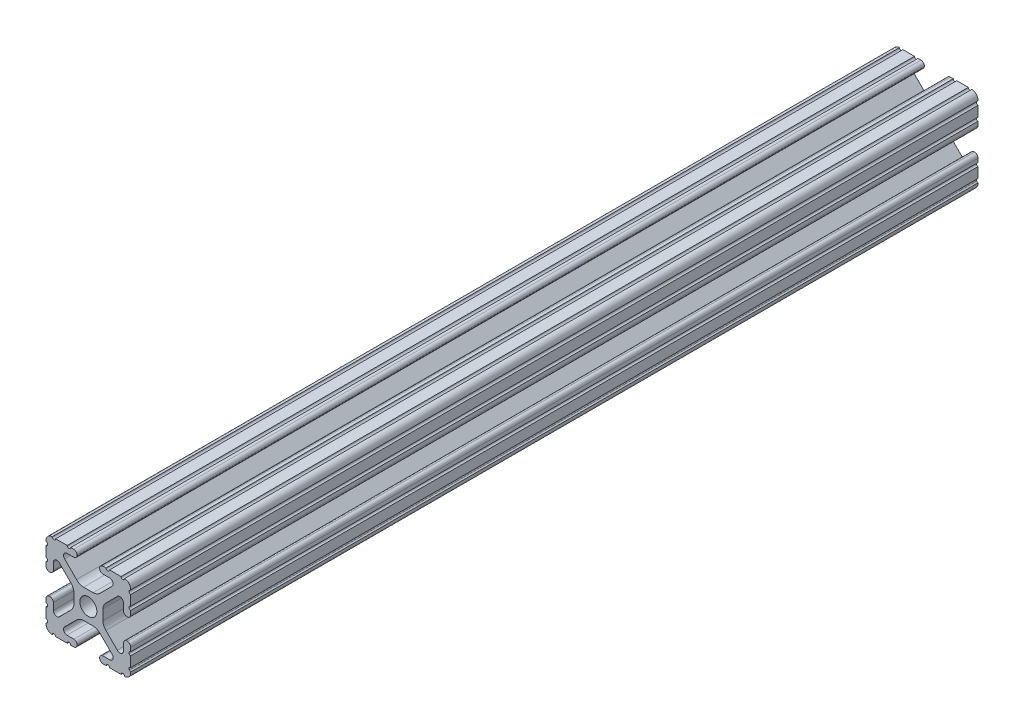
ISO-10303-21;
HEADER;
FILE_DESCRIPTION(('STEP AP214'),'2;1');
FILE_NAME('part.step','',(''),(''),'','','');
FILE_SCHEMA(('AUTOMOTIVE_DESIGN { 1 0 10303 214 1 1 1 1 }'));
ENDSEC;
DATA;
#1=APPLICATION_CONTEXT('core data for automotive mechanical design processes');
#2=APPLICATION_PROTOCOL_DEFINITION('international standard','automotive_design',2000,#1);
#3=PRODUCT_CONTEXT('',#1,'mechanical');
#4=PRODUCT('Part','Part','',(#3));
#5=PRODUCT_RELATED_PRODUCT_CATEGORY('part','',(#4));
#6=PRODUCT_DEFINITION_FORMATION('','',#4);
#7=PRODUCT_DEFINITION_CONTEXT('part definition',#1,'design');
#8=PRODUCT_DEFINITION('design','',#6,#7);
#9=PRODUCT_DEFINITION_SHAPE('','',#8);
#10=(LENGTH_UNIT() NAMED_UNIT(*) SI_UNIT(.MILLI.,.METRE.));
#11=(NAMED_UNIT(*) PLANE_ANGLE_UNIT() SI_UNIT($,.RADIAN.));
#12=(NAMED_UNIT(*) SI_UNIT($,.STERADIAN.) SOLID_ANGLE_UNIT());
#13=UNCERTAINTY_MEASURE_WITH_UNIT(LENGTH_MEASURE(1.E-05),#10,'distance_accuracy_value','');
#14=(GEOMETRIC_REPRESENTATION_CONTEXT(3) GLOBAL_UNCERTAINTY_ASSIGNED_CONTEXT((#13)) GLOBAL_UNIT_ASSIGNED_CONTEXT((#10,
#11,#12)) REPRESENTATION_CONTEXT('',''));
#15=CARTESIAN_POINT('',(0.,0.,0.));
#16=DIRECTION('',(0.,0.,1.));
#17=DIRECTION('',(1.,0.,0.));
#18=AXIS2_PLACEMENT_3D('',#15,#16,#17);
#19=CARTESIAN_POINT('',(17.1027701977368,1.03005775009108,254.));
#20=DIRECTION('',(0.,0.,-1.));
#21=DIRECTION('',(-1.,0.,0.));
#22=AXIS2_PLACEMENT_3D('',#19,#20,#21);
#23=PLANE('',#22);
#24=CARTESIAN_POINT('',(17.1027701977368,1.03005775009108,254.));
#25=DIRECTION('',(0.,0.,1.));
#26=DIRECTION('',(-1.,0.,0.));
#27=AXIS2_PLACEMENT_3D('',#24,#25,#26);
#28=CIRCLE('',#27,1.0498582);
#29=CARTESIAN_POINT('',(17.0383131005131,2.07793537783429,254.));
#30=VERTEX_POINT('',#29);
#31=CARTESIAN_POINT('',(16.0602807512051,1.15422696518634,254.));
#32=VERTEX_POINT('',#31);
#33=EDGE_CURVE('E867',#30,#32,#28,.T.);
#34=ORIENTED_EDGE('',*,*,#33,.T.);
#35=DIRECTION('',(0.022901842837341,-0.999737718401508,0.));
#36=VECTOR('',#35,1.);
#37=CARTESIAN_POINT('',(16.0602807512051,1.15422696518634,254.));
#38=LINE('',#37,#36);
#39=CARTESIAN_POINT('',(16.0625802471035,1.05384671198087,254.));
#40=VERTEX_POINT('',#39);
#41=EDGE_CURVE('E660',#32,#40,#38,.T.);
#42=ORIENTED_EDGE('',*,*,#41,.T.);
#43=CARTESIAN_POINT('',(17.1121569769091,1.07815573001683,254.));
#44=DIRECTION('',(0.,0.,1.));
#45=DIRECTION('',(-1.,0.,0.));
#46=AXIS2_PLACEMENT_3D('',#43,#44,#45);
#47=CIRCLE('',#46,1.0498582);
#48=CARTESIAN_POINT('',(17.0998216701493,0.028369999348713,254.));
#49=VERTEX_POINT('',#48);
#50=EDGE_CURVE('E870',#40,#49,#47,.T.);
#51=ORIENTED_EDGE('',*,*,#50,.T.);
#52=DIRECTION('',(0.999817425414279,-0.0191080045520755,0.));
#53=VECTOR('',#52,1.);
#54=CARTESIAN_POINT('',(17.0998216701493,0.0283699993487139,254.));
#55=LINE('',#54,#53);
#56=CARTESIAN_POINT('',(17.9977215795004,0.0112097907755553,254.));
#57=VERTEX_POINT('',#56);
#58=EDGE_CURVE('E872',#49,#57,#55,.T.);
#59=ORIENTED_EDGE('',*,*,#58,.T.);
#60=CARTESIAN_POINT('',(18.5164730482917,0.,254.));
#61=DIRECTION('',(0.,0.,-1.));
#62=DIRECTION('',(-1.,0.,0.));
#63=AXIS2_PLACEMENT_3D('',#60,#61,#62);
#64=CIRCLE('',#63,0.518872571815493);
#65=CARTESIAN_POINT('',(19.0353456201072,0.,254.));
#66=VERTEX_POINT('',#65);
#67=EDGE_CURVE('E874',#57,#66,#64,.T.);
#68=ORIENTED_EDGE('',*,*,#67,.T.);
#69=DIRECTION('',(1.,0.,0.));
#70=VECTOR('',#69,1.);
#71=CARTESIAN_POINT('',(19.0353456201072,0.,254.));
#72=LINE('',#71,#70);
#73=CARTESIAN_POINT('',(22.5047275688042,0.,254.));
#74=VERTEX_POINT('',#73);
#75=EDGE_CURVE('E876',#66,#74,#72,.T.);
#76=ORIENTED_EDGE('',*,*,#75,.T.);
#77=CARTESIAN_POINT('',(23.0236001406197,0.,254.));
#78=DIRECTION('',(0.,0.,-1.));
#79=DIRECTION('',(-1.,0.,0.));
#80=AXIS2_PLACEMENT_3D('',#77,#78,#79);
#81=CIRCLE('',#80,0.518872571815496);
#82=CARTESIAN_POINT('',(23.5424727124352,0.,254.));
#83=VERTEX_POINT('',#82);
#84=EDGE_CURVE('E878',#74,#83,#81,.T.);
#85=ORIENTED_EDGE('',*,*,#84,.T.);
#86=CARTESIAN_POINT('',(23.5424727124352,1.85752728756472,254.));
#87=DIRECTION('',(0.,0.,1.));
#88=DIRECTION('',(-1.,0.,0.));
#89=AXIS2_PLACEMENT_3D('',#86,#87,#88);
#90=CIRCLE('',#89,1.85752728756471);
#91=CARTESIAN_POINT('',(25.3900651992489,2.0493856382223,254.));
#92=VERTEX_POINT('',#91);
#93=EDGE_CURVE('E880',#83,#92,#90,.T.);
#94=ORIENTED_EDGE('',*,*,#93,.T.);
#95=DIRECTION('',(-0.79788856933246,0.602804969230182,0.));
#96=VECTOR('',#95,1.);
#97=CARTESIAN_POINT('',(25.3900651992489,2.0493856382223,254.));
#98=LINE('',#97,#96);
#99=CARTESIAN_POINT('',(25.0214513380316,2.32787348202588,254.));
#100=VERTEX_POINT('',#99);
#101=EDGE_CURVE('E882',#92,#100,#98,.T.);
#102=ORIENTED_EDGE('',*,*,#101,.T.);
#103=CARTESIAN_POINT('',(25.3999999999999,2.68273916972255,254.));
#104=DIRECTION('',(0.,0.,-1.));
#105=DIRECTION('',(-1.,0.,0.));
#106=AXIS2_PLACEMENT_3D('',#103,#104,#105);
#107=CIRCLE('',#106,0.518872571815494);
#108=CARTESIAN_POINT('',(25.3999999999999,3.20161174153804,254.));
#109=VERTEX_POINT('',#108);
#110=EDGE_CURVE('E884',#100,#109,#107,.T.);
#111=ORIENTED_EDGE('',*,*,#110,.T.);
#112=DIRECTION('',(0.,1.,0.));
#113=VECTOR('',#112,1.);
#114=CARTESIAN_POINT('',(25.3999999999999,3.20161174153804,254.));
#115=LINE('',#114,#113);
#116=CARTESIAN_POINT('',(25.3999999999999,6.29055529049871,254.));
#117=VERTEX_POINT('',#116);
#118=EDGE_CURVE('E886',#109,#117,#115,.T.);
#119=ORIENTED_EDGE('',*,*,#118,.T.);
#120=CARTESIAN_POINT('',(25.3999999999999,6.8094278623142,254.));
#121=DIRECTION('',(0.,0.,-1.));
#122=DIRECTION('',(-1.,0.,0.));
#123=AXIS2_PLACEMENT_3D('',#120,#121,#122);
#124=CIRCLE('',#123,0.518872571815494);
#125=CARTESIAN_POINT('',(25.3999999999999,7.3283004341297,254.));
#126=VERTEX_POINT('',#125);
#127=EDGE_CURVE('E888',#117,#126,#124,.T.);
#128=ORIENTED_EDGE('',*,*,#127,.T.);
#129=DIRECTION('',(0.,1.,0.));
#130=VECTOR('',#129,1.);
#131=CARTESIAN_POINT('',(25.3999999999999,7.3283004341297,254.));
#132=LINE('',#131,#130);
#133=CARTESIAN_POINT('',(25.3999999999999,8.46734037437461,254.));
#134=VERTEX_POINT('',#133);
#135=EDGE_CURVE('E890',#126,#134,#132,.T.);
#136=ORIENTED_EDGE('',*,*,#135,.T.);
#137=CARTESIAN_POINT('',(24.3502993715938,8.48552912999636,254.));
#138=DIRECTION('',(0.,0.,1.));
#139=DIRECTION('',(-1.,0.,0.));
#140=AXIS2_PLACEMENT_3D('',#137,#138,#139);
#141=CIRCLE('',#140,1.0498582);
#142=CARTESIAN_POINT('',(24.4050981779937,9.53395620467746,254.));
#143=VERTEX_POINT('',#142);
#144=EDGE_CURVE('E892',#134,#143,#141,.T.);
#145=ORIENTED_EDGE('',*,*,#144,.T.);
#146=DIRECTION('',(-0.998596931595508,0.0529543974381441,0.));
#147=VECTOR('',#146,1.);
#148=CARTESIAN_POINT('',(24.4050981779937,9.53395620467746,254.));
#149=LINE('',#148,#147);
#150=CARTESIAN_POINT('',(24.3048289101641,9.53927336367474,254.));
#151=VERTEX_POINT('',#150);
#152=EDGE_CURVE('E894',#143,#151,#149,.T.);
#153=ORIENTED_EDGE('',*,*,#152,.T.);
#154=CARTESIAN_POINT('',(24.2500272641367,8.49084643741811,254.));
#155=DIRECTION('',(0.,0.,1.));
#156=DIRECTION('',(-1.,0.,0.));
#157=AXIS2_PLACEMENT_3D('',#154,#155,#156);
#158=CIRCLE('',#157,1.0498582);
#159=CARTESIAN_POINT('',(23.2003251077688,8.50894679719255,254.));
#160=VERTEX_POINT('',#159);
#161=EDGE_CURVE('E896',#151,#160,#158,.T.);
#162=ORIENTED_EDGE('',*,*,#161,.T.);
#163=DIRECTION('',(0.,-1.,0.));
#164=VECTOR('',#163,1.);
#165=CARTESIAN_POINT('',(23.2003251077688,8.50894679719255,254.));
#166=LINE('',#165,#164);
#167=CARTESIAN_POINT('',(23.2003251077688,6.45039451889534,254.));
#168=VERTEX_POINT('',#167);
#169=EDGE_CURVE('E898',#160,#168,#166,.T.);
#170=ORIENTED_EDGE('',*,*,#169,.T.);
#171=CARTESIAN_POINT('',(22.1517765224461,6.43415016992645,254.));
#172=DIRECTION('',(0.,0.,-1.));
#173=DIRECTION('',(-1.,0.,0.));
#174=AXIS2_PLACEMENT_3D('',#171,#172,#173);
#175=CIRCLE('',#174,1.04867440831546);
#176=CARTESIAN_POINT('',(21.3839967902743,5.71984470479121,254.));
#177=VERTEX_POINT('',#176);
#178=EDGE_CURVE('E900',#168,#177,#175,.T.);
#179=ORIENTED_EDGE('',*,*,#178,.T.);
#180=DIRECTION('',(-0.707106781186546,0.707106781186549,0.));
#181=VECTOR('',#180,1.);
#182=CARTESIAN_POINT('',(17.9517570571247,9.15208443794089,254.));
#183=LINE('',#182,#181);
#184=CARTESIAN_POINT('',(17.9517570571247,9.15208443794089,254.));
#185=VERTEX_POINT('',#184);
#186=EDGE_CURVE('E902',#177,#185,#183,.T.);
#187=ORIENTED_EDGE('',*,*,#186,.T.);
#188=CARTESIAN_POINT('',(20.2111364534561,11.4114638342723,254.));
#189=DIRECTION('',(0.,0.,-1.));
#190=DIRECTION('',(-1.,0.,0.));
#191=AXIS2_PLACEMENT_3D('',#188,#189,#190);
#192=CIRCLE('',#191,3.19524498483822);
#193=CARTESIAN_POINT('',(17.0252733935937,11.1667863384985,254.));
#194=VERTEX_POINT('',#193);
#195=EDGE_CURVE('E904',#185,#194,#192,.T.);
#196=ORIENTED_EDGE('',*,*,#195,.T.);
#197=DIRECTION('',(0.,1.,0.));
#198=VECTOR('',#197,1.);
#199=CARTESIAN_POINT('',(17.0252733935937,14.2332136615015,254.));
#200=LINE('',#199,#198);
#201=CARTESIAN_POINT('',(17.0252733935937,14.2332136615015,254.));
#202=VERTEX_POINT('',#201);
#203=EDGE_CURVE('E906',#194,#202,#200,.T.);
#204=ORIENTED_EDGE('',*,*,#203,.T.);
#205=CARTESIAN_POINT('',(20.2111364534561,13.9885361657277,254.));
#206=DIRECTION('',(0.,0.,-1.));
#207=DIRECTION('',(1.,0.,0.));
#208=AXIS2_PLACEMENT_3D('',#205,#206,#207);
#209=CIRCLE('',#208,3.19524498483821);
#210=CARTESIAN_POINT('',(17.9517570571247,16.2479155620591,254.));
#211=VERTEX_POINT('',#210);
#212=EDGE_CURVE('E908',#202,#211,#209,.T.);
#213=ORIENTED_EDGE('',*,*,#212,.T.);
#214=DIRECTION('',(0.707106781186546,0.707106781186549,0.));
#215=VECTOR('',#214,1.);
#216=CARTESIAN_POINT('',(17.9517570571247,16.2479155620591,254.));
#217=LINE('',#216,#215);
#218=CARTESIAN_POINT('',(21.3839967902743,19.6801552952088,254.));
#219=VERTEX_POINT('',#218);
#220=EDGE_CURVE('E910',#211,#219,#217,.T.);
#221=ORIENTED_EDGE('',*,*,#220,.T.);
#222=CARTESIAN_POINT('',(22.1517765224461,18.9658498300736,254.));
#223=DIRECTION('',(0.,0.,-1.));
#224=DIRECTION('',(1.,0.,0.));
#225=AXIS2_PLACEMENT_3D('',#222,#223,#224);
#226=CIRCLE('',#225,1.04867440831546);
#227=CARTESIAN_POINT('',(23.2003251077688,18.9496054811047,254.));
#228=VERTEX_POINT('',#227);
#229=EDGE_CURVE('E912',#219,#228,#226,.T.);
#230=ORIENTED_EDGE('',*,*,#229,.T.);
#231=DIRECTION('',(0.,-1.,0.));
#232=VECTOR('',#231,1.);
#233=CARTESIAN_POINT('',(23.2003251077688,16.8910532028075,254.));
#234=LINE('',#233,#232);
#235=CARTESIAN_POINT('',(23.2003251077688,16.8910532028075,254.));
#236=VERTEX_POINT('',#235);
#237=EDGE_CURVE('E914',#228,#236,#234,.T.);
#238=ORIENTED_EDGE('',*,*,#237,.T.);
#239=CARTESIAN_POINT('',(24.2500272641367,16.9091535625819,254.));
#240=DIRECTION('',(0.,0.,1.));
#241=DIRECTION('',(1.,0.,0.));
#242=AXIS2_PLACEMENT_3D('',#239,#240,#241);
#243=CIRCLE('',#242,1.0498582);
#244=CARTESIAN_POINT('',(24.3048289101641,15.8607266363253,254.));
#245=VERTEX_POINT('',#244);
#246=EDGE_CURVE('E916',#236,#245,#243,.T.);
#247=ORIENTED_EDGE('',*,*,#246,.T.);
#248=DIRECTION('',(0.998596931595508,0.0529543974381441,0.));
#249=VECTOR('',#248,1.);
#250=CARTESIAN_POINT('',(24.4050981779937,15.8660437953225,254.));
#251=LINE('',#250,#249);
#252=CARTESIAN_POINT('',(24.4050981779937,15.8660437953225,254.));
#253=VERTEX_POINT('',#252);
#254=EDGE_CURVE('E918',#245,#253,#251,.T.);
#255=ORIENTED_EDGE('',*,*,#254,.T.);
#256=CARTESIAN_POINT('',(24.3502993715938,16.9144708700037,254.));
#257=DIRECTION('',(0.,0.,1.));
#258=DIRECTION('',(1.,0.,0.));
#259=AXIS2_PLACEMENT_3D('',#256,#257,#258);
#260=CIRCLE('',#259,1.0498582);
#261=CARTESIAN_POINT('',(25.3999999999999,16.9326596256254,254.));
#262=VERTEX_POINT('',#261);
#263=EDGE_CURVE('E920',#253,#262,#260,.T.);
#264=ORIENTED_EDGE('',*,*,#263,.T.);
#265=DIRECTION('',(0.,1.,0.));
#266=VECTOR('',#265,1.);
#267=CARTESIAN_POINT('',(25.3999999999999,18.0716995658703,254.));
#268=LINE('',#267,#266);
#269=CARTESIAN_POINT('',(25.3999999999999,18.0716995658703,254.));
#270=VERTEX_POINT('',#269);
#271=EDGE_CURVE('E922',#262,#270,#268,.T.);
#272=ORIENTED_EDGE('',*,*,#271,.T.);
#273=CARTESIAN_POINT('',(25.3999999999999,18.5905721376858,254.));
#274=DIRECTION('',(0.,0.,-1.));
#275=DIRECTION('',(1.,0.,0.));
#276=AXIS2_PLACEMENT_3D('',#273,#274,#275);
#277=CIRCLE('',#276,0.518872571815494);
#278=CARTESIAN_POINT('',(25.3999999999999,19.1094447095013,254.));
#279=VERTEX_POINT('',#278);
#280=EDGE_CURVE('E924',#270,#279,#277,.T.);
#281=ORIENTED_EDGE('',*,*,#280,.T.);
#282=DIRECTION('',(0.,1.,0.));
#283=VECTOR('',#282,1.);
#284=CARTESIAN_POINT('',(25.3999999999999,22.198388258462,254.));
#285=LINE('',#284,#283);
#286=CARTESIAN_POINT('',(25.3999999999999,22.198388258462,254.));
#287=VERTEX_POINT('',#286);
#288=EDGE_CURVE('E926',#279,#287,#285,.T.);
#289=ORIENTED_EDGE('',*,*,#288,.T.);
#290=CARTESIAN_POINT('',(25.3999999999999,22.7172608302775,254.));
#291=DIRECTION('',(0.,0.,-1.));
#292=DIRECTION('',(1.,0.,0.));
#293=AXIS2_PLACEMENT_3D('',#290,#291,#292);
#294=CIRCLE('',#293,0.518872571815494);
#295=CARTESIAN_POINT('',(25.0214513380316,23.0721265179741,254.));
#296=VERTEX_POINT('',#295);
#297=EDGE_CURVE('E928',#287,#296,#294,.T.);
#298=ORIENTED_EDGE('',*,*,#297,.T.);
#299=DIRECTION('',(0.797888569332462,0.602804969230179,0.));
#300=VECTOR('',#299,1.);
#301=CARTESIAN_POINT('',(25.3900651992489,23.3506143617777,254.));
#302=LINE('',#301,#300);
#303=CARTESIAN_POINT('',(25.3900651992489,23.3506143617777,254.));
#304=VERTEX_POINT('',#303);
#305=EDGE_CURVE('E930',#296,#304,#302,.T.);
#306=ORIENTED_EDGE('',*,*,#305,.T.);
#307=CARTESIAN_POINT('',(23.5424727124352,23.5424727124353,254.));
#308=DIRECTION('',(0.,0.,1.));
#309=DIRECTION('',(1.,0.,0.));
#310=AXIS2_PLACEMENT_3D('',#307,#308,#309);
#311=CIRCLE('',#310,1.85752728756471);
#312=CARTESIAN_POINT('',(23.5424727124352,25.4,254.));
#313=VERTEX_POINT('',#312);
#314=EDGE_CURVE('E932',#304,#313,#311,.T.);
#315=ORIENTED_EDGE('',*,*,#314,.T.);
#316=CARTESIAN_POINT('',(23.0236001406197,25.4,254.));
#317=DIRECTION('',(0.,0.,-1.));
#318=DIRECTION('',(1.,0.,0.));
#319=AXIS2_PLACEMENT_3D('',#316,#317,#318);
#320=CIRCLE('',#319,0.518872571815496);
#321=CARTESIAN_POINT('',(22.5047275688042,25.4,254.));
#322=VERTEX_POINT('',#321);
#323=EDGE_CURVE('E934',#313,#322,#320,.T.);
#324=ORIENTED_EDGE('',*,*,#323,.T.);
#325=DIRECTION('',(-1.,0.,0.));
#326=VECTOR('',#325,1.);
#327=CARTESIAN_POINT('',(19.0353456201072,25.4,254.));
#328=LINE('',#327,#326);
#329=CARTESIAN_POINT('',(19.0353456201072,25.4,254.));
#330=VERTEX_POINT('',#329);
#331=EDGE_CURVE('E936',#322,#330,#328,.T.);
#332=ORIENTED_EDGE('',*,*,#331,.T.);
#333=CARTESIAN_POINT('',(18.5164730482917,25.4,254.));
#334=DIRECTION('',(0.,0.,-1.));
#335=DIRECTION('',(1.,0.,0.));
#336=AXIS2_PLACEMENT_3D('',#333,#334,#335);
#337=CIRCLE('',#336,0.518872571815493);
#338=CARTESIAN_POINT('',(17.9977215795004,25.3887902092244,254.));
#339=VERTEX_POINT('',#338);
#340=EDGE_CURVE('E938',#330,#339,#337,.T.);
#341=ORIENTED_EDGE('',*,*,#340,.T.);
#342=DIRECTION('',(-0.999817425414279,-0.0191080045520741,0.));
#343=VECTOR('',#342,1.);
#344=CARTESIAN_POINT('',(17.0998216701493,25.3716300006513,254.));
#345=LINE('',#344,#343);
#346=CARTESIAN_POINT('',(17.0998216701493,25.3716300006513,254.));
#347=VERTEX_POINT('',#346);
#348=EDGE_CURVE('E940',#339,#347,#345,.T.);
#349=ORIENTED_EDGE('',*,*,#348,.T.);
#350=CARTESIAN_POINT('',(17.1121569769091,24.3218442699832,254.));
#351=DIRECTION('',(0.,0.,1.));
#352=DIRECTION('',(1.,0.,0.));
#353=AXIS2_PLACEMENT_3D('',#350,#351,#352);
#354=CIRCLE('',#353,1.0498582);
#355=CARTESIAN_POINT('',(16.0625802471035,24.3461532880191,254.));
#356=VERTEX_POINT('',#355);
#357=EDGE_CURVE('E942',#347,#356,#354,.T.);
#358=ORIENTED_EDGE('',*,*,#357,.T.);
#359=DIRECTION('',(-0.0229018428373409,-0.999737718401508,0.));
#360=VECTOR('',#359,1.);
#361=CARTESIAN_POINT('',(16.0602807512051,24.2457730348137,254.));
#362=LINE('',#361,#360);
#363=CARTESIAN_POINT('',(16.0602807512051,24.2457730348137,254.));
#364=VERTEX_POINT('',#363);
#365=EDGE_CURVE('E944',#356,#364,#362,.T.);
#366=ORIENTED_EDGE('',*,*,#365,.T.);
#367=CARTESIAN_POINT('',(17.1027701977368,24.3699422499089,254.));
#368=DIRECTION('',(0.,0.,1.));
#369=DIRECTION('',(1.,0.,0.));
#370=AXIS2_PLACEMENT_3D('',#367,#368,#369);
#371=CIRCLE('',#370,1.0498582);
#372=CARTESIAN_POINT('',(17.0383131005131,23.3220646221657,254.));
#373=VERTEX_POINT('',#372);
#374=EDGE_CURVE('E946',#364,#373,#371,.T.);
#375=ORIENTED_EDGE('',*,*,#374,.T.);
#376=DIRECTION('',(1.,0.,0.));
#377=VECTOR('',#376,1.);
#378=CARTESIAN_POINT('',(17.0383131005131,23.3220646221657,254.));
#379=LINE('',#378,#377);
#380=CARTESIAN_POINT('',(19.0968631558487,23.3220646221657,254.));
#381=VERTEX_POINT('',#380);
#382=EDGE_CURVE('E948',#373,#381,#379,.T.);
#383=ORIENTED_EDGE('',*,*,#382,.T.);
#384=CARTESIAN_POINT('',(19.0890702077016,22.273492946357,254.));
#385=DIRECTION('',(0.,0.,-1.));
#386=DIRECTION('',(1.,0.,0.));
#387=AXIS2_PLACEMENT_3D('',#384,#385,#386);
#388=CIRCLE('',#387,1.04860063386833);
#389=CARTESIAN_POINT('',(19.7875106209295,21.4913521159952,254.));
#390=VERTEX_POINT('',#389);
#391=EDGE_CURVE('E950',#381,#390,#388,.T.);
#392=ORIENTED_EDGE('',*,*,#391,.T.);
#393=DIRECTION('',(-0.707106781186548,-0.707106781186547,0.));
#394=VECTOR('',#393,1.);
#395=CARTESIAN_POINT('',(19.7875106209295,21.4913521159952,254.));
#396=LINE('',#395,#394);
#397=CARTESIAN_POINT('',(16.2486532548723,17.952494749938,254.));
#398=VERTEX_POINT('',#397);
#399=EDGE_CURVE('E952',#390,#398,#396,.T.);
#400=ORIENTED_EDGE('',*,*,#399,.T.);
#401=CARTESIAN_POINT('',(14.003589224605,20.1975587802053,254.));
#402=DIRECTION('',(0.,0.,-1.));
#403=DIRECTION('',(1.,0.,0.));
#404=AXIS2_PLACEMENT_3D('',#401,#402,#403);
#405=CIRCLE('',#404,3.17499999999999);
#406=CARTESIAN_POINT('',(14.1348539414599,17.0252733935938,254.));
#407=VERTEX_POINT('',#406);
#408=EDGE_CURVE('E954',#398,#407,#405,.T.);
#409=ORIENTED_EDGE('',*,*,#408,.T.);
#410=DIRECTION('',(-1.,0.,0.));
#411=VECTOR('',#410,1.);
#412=CARTESIAN_POINT('',(14.1348539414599,17.0252733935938,254.));
#413=LINE('',#412,#411);
#414=CARTESIAN_POINT('',(11.26514605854,17.0252733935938,254.));
#415=VERTEX_POINT('',#414);
#416=EDGE_CURVE('E956',#407,#415,#413,.T.);
#417=ORIENTED_EDGE('',*,*,#416,.T.);
#418=CARTESIAN_POINT('',(11.3964107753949,20.1975587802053,254.));
#419=DIRECTION('',(0.,0.,-1.));
#420=DIRECTION('',(-1.,0.,0.));
#421=AXIS2_PLACEMENT_3D('',#418,#419,#420);
#422=CIRCLE('',#421,3.17499999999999);
#423=CARTESIAN_POINT('',(9.15134674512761,17.952494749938,254.));
#424=VERTEX_POINT('',#423);
#425=EDGE_CURVE('E958',#415,#424,#422,.T.);
#426=ORIENTED_EDGE('',*,*,#425,.T.);
#427=DIRECTION('',(-0.707106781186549,0.707106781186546,0.));
#428=VECTOR('',#427,1.);
#429=CARTESIAN_POINT('',(5.61248937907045,21.4913521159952,254.));
#430=LINE('',#429,#428);
#431=CARTESIAN_POINT('',(5.61248937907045,21.4913521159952,254.));
#432=VERTEX_POINT('',#431);
#433=EDGE_CURVE('E960',#424,#432,#430,.T.);
#434=ORIENTED_EDGE('',*,*,#433,.T.);
#435=CARTESIAN_POINT('',(6.31092979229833,22.273492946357,254.));
#436=DIRECTION('',(0.,0.,-1.));
#437=DIRECTION('',(-1.,0.,0.));
#438=AXIS2_PLACEMENT_3D('',#435,#436,#437);
#439=CIRCLE('',#438,1.04860063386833);
#440=CARTESIAN_POINT('',(6.30313684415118,23.3220646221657,254.));
#441=VERTEX_POINT('',#440);
#442=EDGE_CURVE('E962',#432,#441,#439,.T.);
#443=ORIENTED_EDGE('',*,*,#442,.T.);
#444=DIRECTION('',(1.,0.,0.));
#445=VECTOR('',#444,1.);
#446=CARTESIAN_POINT('',(8.36168689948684,23.3220646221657,254.));
#447=LINE('',#446,#445);
#448=CARTESIAN_POINT('',(8.36168689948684,23.3220646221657,254.));
#449=VERTEX_POINT('',#448);
#450=EDGE_CURVE('E964',#441,#449,#447,.T.);
#451=ORIENTED_EDGE('',*,*,#450,.T.);
#452=CARTESIAN_POINT('',(8.2972298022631,24.3699422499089,254.));
#453=DIRECTION('',(0.,0.,1.));
#454=DIRECTION('',(-1.,0.,0.));
#455=AXIS2_PLACEMENT_3D('',#452,#453,#454);
#456=CIRCLE('',#455,1.0498582);
#457=CARTESIAN_POINT('',(9.33971924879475,24.2457730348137,254.));
#458=VERTEX_POINT('',#457);
#459=EDGE_CURVE('E966',#449,#458,#456,.T.);
#460=ORIENTED_EDGE('',*,*,#459,.T.);
#461=DIRECTION('',(-0.0229018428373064,0.999737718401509,0.));
#462=VECTOR('',#461,1.);
#463=CARTESIAN_POINT('',(9.33971924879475,24.2457730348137,254.));
#464=LINE('',#463,#462);
#465=CARTESIAN_POINT('',(9.33741975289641,24.3461532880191,254.));
#466=VERTEX_POINT('',#465);
#467=EDGE_CURVE('E968',#458,#466,#464,.T.);
#468=ORIENTED_EDGE('',*,*,#467,.T.);
#469=CARTESIAN_POINT('',(8.28784302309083,24.3218442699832,254.));
#470=DIRECTION('',(0.,0.,1.));
#471=DIRECTION('',(-1.,0.,0.));
#472=AXIS2_PLACEMENT_3D('',#469,#470,#471);
#473=CIRCLE('',#472,1.0498582);
#474=CARTESIAN_POINT('',(8.30017832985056,25.3716300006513,254.));
#475=VERTEX_POINT('',#474);
#476=EDGE_CURVE('E970',#466,#475,#473,.T.);
#477=ORIENTED_EDGE('',*,*,#476,.T.);
#478=DIRECTION('',(-0.999817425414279,0.0191080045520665,0.));
#479=VECTOR('',#478,1.);
#480=CARTESIAN_POINT('',(8.30017832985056,25.3716300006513,254.));
#481=LINE('',#480,#479);
#482=CARTESIAN_POINT('',(7.40227842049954,25.3887902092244,254.));
#483=VERTEX_POINT('',#482);
#484=EDGE_CURVE('E972',#475,#483,#481,.T.);
#485=ORIENTED_EDGE('',*,*,#484,.T.);
#486=CARTESIAN_POINT('',(6.88352695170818,25.4,254.));
#487=DIRECTION('',(0.,0.,-1.));
#488=DIRECTION('',(-1.,0.,0.));
#489=AXIS2_PLACEMENT_3D('',#486,#487,#488);
#490=CIRCLE('',#489,0.518872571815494);
#491=CARTESIAN_POINT('',(6.36465437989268,25.4,254.));
#492=VERTEX_POINT('',#491);
#493=EDGE_CURVE('E974',#483,#492,#490,.T.);
#494=ORIENTED_EDGE('',*,*,#493,.T.);
#495=DIRECTION('',(-1.,0.,0.));
#496=VECTOR('',#495,1.);
#497=CARTESIAN_POINT('',(6.36465437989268,25.4,254.));
#498=LINE('',#497,#496);
#499=CARTESIAN_POINT('',(2.89527243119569,25.4,254.));
#500=VERTEX_POINT('',#499);
#501=EDGE_CURVE('E976',#492,#500,#498,.T.);
#502=ORIENTED_EDGE('',*,*,#501,.T.);
#503=CARTESIAN_POINT('',(2.3763998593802,25.4,254.));
#504=DIRECTION('',(0.,0.,-1.));
#505=DIRECTION('',(-1.,0.,0.));
#506=AXIS2_PLACEMENT_3D('',#503,#504,#505);
#507=CIRCLE('',#506,0.518872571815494);
#508=CARTESIAN_POINT('',(1.8575272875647,25.4,254.));
#509=VERTEX_POINT('',#508);
#510=EDGE_CURVE('E978',#500,#509,#507,.T.);
#511=ORIENTED_EDGE('',*,*,#510,.T.);
#512=CARTESIAN_POINT('',(1.8575272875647,23.5424727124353,254.));
#513=DIRECTION('',(0.,0.,1.));
#514=DIRECTION('',(-1.,0.,0.));
#515=AXIS2_PLACEMENT_3D('',#512,#513,#514);
#516=CIRCLE('',#515,1.85752728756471);
#517=CARTESIAN_POINT('',(0.00993480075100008,23.3506143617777,254.));
#518=VERTEX_POINT('',#517);
#519=EDGE_CURVE('E980',#509,#518,#516,.T.);
#520=ORIENTED_EDGE('',*,*,#519,.T.);
#521=DIRECTION('',(0.797888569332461,-0.602804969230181,0.));
#522=VECTOR('',#521,1.);
#523=CARTESIAN_POINT('',(0.00993480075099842,23.3506143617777,254.));
#524=LINE('',#523,#522);
#525=CARTESIAN_POINT('',(0.378548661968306,23.0721265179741,254.));
#526=VERTEX_POINT('',#525);
#527=EDGE_CURVE('E982',#518,#526,#524,.T.);
#528=ORIENTED_EDGE('',*,*,#527,.T.);
#529=CARTESIAN_POINT('',(0.,22.7172608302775,254.));
#530=DIRECTION('',(0.,0.,-1.));
#531=DIRECTION('',(-1.,0.,0.));
#532=AXIS2_PLACEMENT_3D('',#529,#530,#531);
#533=CIRCLE('',#532,0.518872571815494);
#534=CARTESIAN_POINT('',(0.,22.198388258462,254.));
#535=VERTEX_POINT('',#534);
#536=EDGE_CURVE('E984',#526,#535,#533,.T.);
#537=ORIENTED_EDGE('',*,*,#536,.T.);
#538=DIRECTION('',(0.,-1.,0.));
#539=VECTOR('',#538,1.);
#540=CARTESIAN_POINT('',(0.,22.198388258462,254.));
#541=LINE('',#540,#539);
#542=CARTESIAN_POINT('',(0.,19.1094447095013,254.));
#543=VERTEX_POINT('',#542);
#544=EDGE_CURVE('E986',#535,#543,#541,.T.);
#545=ORIENTED_EDGE('',*,*,#544,.T.);
#546=CARTESIAN_POINT('',(0.,18.5905721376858,254.));
#547=DIRECTION('',(0.,0.,-1.));
#548=DIRECTION('',(-1.,0.,0.));
#549=AXIS2_PLACEMENT_3D('',#546,#547,#548);
#550=CIRCLE('',#549,0.518872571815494);
#551=CARTESIAN_POINT('',(0.,18.0716995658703,254.));
#552=VERTEX_POINT('',#551);
#553=EDGE_CURVE('E988',#543,#552,#550,.T.);
#554=ORIENTED_EDGE('',*,*,#553,.T.);
#555=DIRECTION('',(0.,-1.,0.));
#556=VECTOR('',#555,1.);
#557=CARTESIAN_POINT('',(0.,18.0716995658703,254.));
#558=LINE('',#557,#556);
#559=CARTESIAN_POINT('',(0.,16.9326596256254,254.));
#560=VERTEX_POINT('',#559);
#561=EDGE_CURVE('E990',#552,#560,#558,.T.);
#562=ORIENTED_EDGE('',*,*,#561,.T.);
#563=CARTESIAN_POINT('',(1.04970062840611,16.9144708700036,254.));
#564=DIRECTION('',(0.,0.,1.));
#565=DIRECTION('',(-1.,0.,0.));
#566=AXIS2_PLACEMENT_3D('',#563,#564,#565);
#567=CIRCLE('',#566,1.0498582);
#568=CARTESIAN_POINT('',(0.994901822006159,15.8660437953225,254.));
#569=VERTEX_POINT('',#568);
#570=EDGE_CURVE('E992',#560,#569,#567,.T.);
#571=ORIENTED_EDGE('',*,*,#570,.T.);
#572=DIRECTION('',(0.998596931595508,-0.0529543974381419,0.));
#573=VECTOR('',#572,1.);
#574=CARTESIAN_POINT('',(0.994901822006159,15.8660437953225,254.));
#575=LINE('',#574,#573);
#576=CARTESIAN_POINT('',(1.09517108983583,15.8607266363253,254.));
#577=VERTEX_POINT('',#576);
#578=EDGE_CURVE('E994',#569,#577,#575,.T.);
#579=ORIENTED_EDGE('',*,*,#578,.T.);
#580=CARTESIAN_POINT('',(1.14997273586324,16.9091535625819,254.));
#581=DIRECTION('',(0.,0.,1.));
#582=DIRECTION('',(-1.,0.,0.));
#583=AXIS2_PLACEMENT_3D('',#580,#581,#582);
#584=CIRCLE('',#583,1.0498582);
#585=CARTESIAN_POINT('',(2.19967489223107,16.8910532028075,254.));
#586=VERTEX_POINT('',#585);
#587=EDGE_CURVE('E996',#577,#586,#584,.T.);
#588=ORIENTED_EDGE('',*,*,#587,.T.);
#589=DIRECTION('',(0.,1.,0.));
#590=VECTOR('',#589,1.);
#591=CARTESIAN_POINT('',(2.19967489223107,16.8910532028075,254.));
#592=LINE('',#591,#590);
#593=CARTESIAN_POINT('',(2.19967489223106,18.9496054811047,254.));
#594=VERTEX_POINT('',#593);
#595=EDGE_CURVE('E998',#586,#594,#592,.T.);
#596=ORIENTED_EDGE('',*,*,#595,.T.);
#597=CARTESIAN_POINT('',(3.24822347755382,18.9658498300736,254.));
#598=DIRECTION('',(0.,0.,-1.));
#599=DIRECTION('',(-1.,0.,0.));
#600=AXIS2_PLACEMENT_3D('',#597,#598,#599);
#601=CIRCLE('',#600,1.04867440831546);
#602=CARTESIAN_POINT('',(4.01600320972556,19.6801552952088,254.));
#603=VERTEX_POINT('',#602);
#604=EDGE_CURVE('E1000',#594,#603,#601,.T.);
#605=ORIENTED_EDGE('',*,*,#604,.T.);
#606=DIRECTION('',(0.707106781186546,-0.707106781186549,0.));
#607=VECTOR('',#606,1.);
#608=CARTESIAN_POINT('',(7.44824294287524,16.2479155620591,254.));
#609=LINE('',#608,#607);
#610=CARTESIAN_POINT('',(7.44824294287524,16.2479155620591,254.));
#611=VERTEX_POINT('',#610);
#612=EDGE_CURVE('E1002',#603,#611,#609,.T.);
#613=ORIENTED_EDGE('',*,*,#612,.T.);
#614=CARTESIAN_POINT('',(5.18886354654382,13.9885361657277,254.));
#615=DIRECTION('',(0.,0.,-1.));
#616=DIRECTION('',(-1.,0.,0.));
#617=AXIS2_PLACEMENT_3D('',#614,#615,#616);
#618=CIRCLE('',#617,3.19524498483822);
#619=CARTESIAN_POINT('',(8.3747266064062,14.2332136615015,254.));
#620=VERTEX_POINT('',#619);
#621=EDGE_CURVE('E1004',#611,#620,#618,.T.);
#622=ORIENTED_EDGE('',*,*,#621,.T.);
#623=DIRECTION('',(0.,-1.,0.));
#624=VECTOR('',#623,1.);
#625=CARTESIAN_POINT('',(8.3747266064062,14.2332136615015,254.));
#626=LINE('',#625,#624);
#627=CARTESIAN_POINT('',(8.3747266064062,11.1667863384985,254.));
#628=VERTEX_POINT('',#627);
#629=EDGE_CURVE('E1006',#620,#628,#626,.T.);
#630=ORIENTED_EDGE('',*,*,#629,.T.);
#631=CARTESIAN_POINT('',(5.18886354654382,11.4114638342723,254.));
#632=DIRECTION('',(0.,0.,-1.));
#633=DIRECTION('',(1.,0.,0.));
#634=AXIS2_PLACEMENT_3D('',#631,#632,#633);
#635=CIRCLE('',#634,3.19524498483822);
#636=CARTESIAN_POINT('',(7.44824294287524,9.15208443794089,254.));
#637=VERTEX_POINT('',#636);
#638=EDGE_CURVE('E1008',#628,#637,#635,.T.);
#639=ORIENTED_EDGE('',*,*,#638,.T.);
#640=DIRECTION('',(-0.707106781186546,-0.707106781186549,0.));
#641=VECTOR('',#640,1.);
#642=CARTESIAN_POINT('',(7.44824294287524,9.15208443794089,254.));
#643=LINE('',#642,#641);
#644=CARTESIAN_POINT('',(4.01600320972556,5.7198447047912,254.));
#645=VERTEX_POINT('',#644);
#646=EDGE_CURVE('E1010',#637,#645,#643,.T.);
#647=ORIENTED_EDGE('',*,*,#646,.T.);
#648=CARTESIAN_POINT('',(3.24822347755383,6.43415016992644,254.));
#649=DIRECTION('',(0.,0.,-1.));
#650=DIRECTION('',(1.,0.,0.));
#651=AXIS2_PLACEMENT_3D('',#648,#649,#650);
#652=CIRCLE('',#651,1.04867440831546);
#653=CARTESIAN_POINT('',(2.19967489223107,6.45039451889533,254.));
#654=VERTEX_POINT('',#653);
#655=EDGE_CURVE('E1012',#645,#654,#652,.T.);
#656=ORIENTED_EDGE('',*,*,#655,.T.);
#657=DIRECTION('',(0.,1.,0.));
#658=VECTOR('',#657,1.);
#659=CARTESIAN_POINT('',(2.19967489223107,8.50894679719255,254.));
#660=LINE('',#659,#658);
#661=CARTESIAN_POINT('',(2.19967489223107,8.50894679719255,254.));
#662=VERTEX_POINT('',#661);
#663=EDGE_CURVE('E1014',#654,#662,#660,.T.);
#664=ORIENTED_EDGE('',*,*,#663,.T.);
#665=CARTESIAN_POINT('',(1.14997273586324,8.4908464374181,254.));
#666=DIRECTION('',(0.,0.,1.));
#667=DIRECTION('',(1.,0.,0.));
#668=AXIS2_PLACEMENT_3D('',#665,#666,#667);
#669=CIRCLE('',#668,1.0498582);
#670=CARTESIAN_POINT('',(1.09517108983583,9.53927336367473,254.));
#671=VERTEX_POINT('',#670);
#672=EDGE_CURVE('E1016',#662,#671,#669,.T.);
#673=ORIENTED_EDGE('',*,*,#672,.T.);
#674=DIRECTION('',(-0.998596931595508,-0.0529543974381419,0.));
#675=VECTOR('',#674,1.);
#676=CARTESIAN_POINT('',(0.994901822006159,9.53395620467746,254.));
#677=LINE('',#676,#675);
#678=CARTESIAN_POINT('',(0.994901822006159,9.53395620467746,254.));
#679=VERTEX_POINT('',#678);
#680=EDGE_CURVE('E1018',#671,#679,#677,.T.);
#681=ORIENTED_EDGE('',*,*,#680,.T.);
#682=CARTESIAN_POINT('',(1.04970062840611,8.48552912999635,254.));
#683=DIRECTION('',(0.,0.,1.));
#684=DIRECTION('',(1.,0.,0.));
#685=AXIS2_PLACEMENT_3D('',#682,#683,#684);
#686=CIRCLE('',#685,1.0498582);
#687=CARTESIAN_POINT('',(0.,8.4673403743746,254.));
#688=VERTEX_POINT('',#687);
#689=EDGE_CURVE('E1020',#679,#688,#686,.T.);
#690=ORIENTED_EDGE('',*,*,#689,.T.);
#691=DIRECTION('',(0.,-1.,0.));
#692=VECTOR('',#691,1.);
#693=CARTESIAN_POINT('',(0.,7.32830043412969,254.));
#694=LINE('',#693,#692);
#695=CARTESIAN_POINT('',(0.,7.32830043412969,254.));
#696=VERTEX_POINT('',#695);
#697=EDGE_CURVE('E1022',#688,#696,#694,.T.);
#698=ORIENTED_EDGE('',*,*,#697,.T.);
#699=CARTESIAN_POINT('',(0.,6.80942786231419,254.));
#700=DIRECTION('',(0.,0.,-1.));
#701=DIRECTION('',(1.,0.,0.));
#702=AXIS2_PLACEMENT_3D('',#699,#700,#701);
#703=CIRCLE('',#702,0.518872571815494);
#704=CARTESIAN_POINT('',(0.,6.2905552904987,254.));
#705=VERTEX_POINT('',#704);
#706=EDGE_CURVE('E1024',#696,#705,#703,.T.);
#707=ORIENTED_EDGE('',*,*,#706,.T.);
#708=DIRECTION('',(0.,-1.,0.));
#709=VECTOR('',#708,1.);
#710=CARTESIAN_POINT('',(0.,3.20161174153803,254.));
#711=LINE('',#710,#709);
#712=CARTESIAN_POINT('',(0.,3.20161174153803,254.));
#713=VERTEX_POINT('',#712);
#714=EDGE_CURVE('E1026',#705,#713,#711,.T.);
#715=ORIENTED_EDGE('',*,*,#714,.T.);
#716=CARTESIAN_POINT('',(0.,2.68273916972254,254.));
#717=DIRECTION('',(0.,0.,-1.));
#718=DIRECTION('',(1.,0.,0.));
#719=AXIS2_PLACEMENT_3D('',#716,#717,#718);
#720=CIRCLE('',#719,0.518872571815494);
#721=CARTESIAN_POINT('',(0.378548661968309,2.32787348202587,254.));
#722=VERTEX_POINT('',#721);
#723=EDGE_CURVE('E1028',#713,#722,#720,.T.);
#724=ORIENTED_EDGE('',*,*,#723,.T.);
#725=DIRECTION('',(-0.797888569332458,-0.602804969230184,0.));
#726=VECTOR('',#725,1.);
#727=CARTESIAN_POINT('',(0.00993480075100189,2.0493856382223,254.));
#728=LINE('',#727,#726);
#729=CARTESIAN_POINT('',(0.00993480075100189,2.0493856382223,254.));
#730=VERTEX_POINT('',#729);
#731=EDGE_CURVE('E1030',#722,#730,#728,.T.);
#732=ORIENTED_EDGE('',*,*,#731,.T.);
#733=CARTESIAN_POINT('',(1.85752728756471,1.85752728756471,254.));
#734=DIRECTION('',(0.,0.,1.));
#735=DIRECTION('',(1.,0.,0.));
#736=AXIS2_PLACEMENT_3D('',#733,#734,#735);
#737=CIRCLE('',#736,1.85752728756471);
#738=CARTESIAN_POINT('',(1.85752728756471,0.,254.));
#739=VERTEX_POINT('',#738);
#740=EDGE_CURVE('E1032',#730,#739,#737,.T.);
#741=ORIENTED_EDGE('',*,*,#740,.T.);
#742=CARTESIAN_POINT('',(2.3763998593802,0.,254.));
#743=DIRECTION('',(0.,0.,-1.));
#744=DIRECTION('',(1.,0.,0.));
#745=AXIS2_PLACEMENT_3D('',#742,#743,#744);
#746=CIRCLE('',#745,0.518872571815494);
#747=CARTESIAN_POINT('',(2.8952724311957,0.,254.));
#748=VERTEX_POINT('',#747);
#749=EDGE_CURVE('E1034',#739,#748,#746,.T.);
#750=ORIENTED_EDGE('',*,*,#749,.T.);
#751=DIRECTION('',(1.,0.,0.));
#752=VECTOR('',#751,1.);
#753=CARTESIAN_POINT('',(6.36465437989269,0.,254.));
#754=LINE('',#753,#752);
#755=CARTESIAN_POINT('',(6.36465437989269,0.,254.));
#756=VERTEX_POINT('',#755);
#757=EDGE_CURVE('E1036',#748,#756,#754,.T.);
#758=ORIENTED_EDGE('',*,*,#757,.T.);
#759=CARTESIAN_POINT('',(6.88352695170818,0.,254.));
#760=DIRECTION('',(0.,0.,-1.));
#761=DIRECTION('',(1.,0.,0.));
#762=AXIS2_PLACEMENT_3D('',#759,#760,#761);
#763=CIRCLE('',#762,0.518872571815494);
#764=CARTESIAN_POINT('',(7.40227842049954,0.0112097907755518,254.));
#765=VERTEX_POINT('',#764);
#766=EDGE_CURVE('E1038',#756,#765,#763,.T.);
#767=ORIENTED_EDGE('',*,*,#766,.T.);
#768=DIRECTION('',(0.999817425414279,0.0191080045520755,0.));
#769=VECTOR('',#768,1.);
#770=CARTESIAN_POINT('',(8.30017832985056,0.0283699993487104,254.));
#771=LINE('',#770,#769);
#772=CARTESIAN_POINT('',(8.30017832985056,0.0283699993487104,254.));
#773=VERTEX_POINT('',#772);
#774=EDGE_CURVE('E1040',#765,#773,#771,.T.);
#775=ORIENTED_EDGE('',*,*,#774,.T.);
#776=CARTESIAN_POINT('',(8.28784302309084,1.07815573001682,254.));
#777=DIRECTION('',(0.,0.,1.));
#778=DIRECTION('',(1.,0.,0.));
#779=AXIS2_PLACEMENT_3D('',#776,#777,#778);
#780=CIRCLE('',#779,1.0498582);
#781=CARTESIAN_POINT('',(9.33741975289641,1.05384671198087,254.));
#782=VERTEX_POINT('',#781);
#783=EDGE_CURVE('E1042',#773,#782,#780,.T.);
#784=ORIENTED_EDGE('',*,*,#783,.T.);
#785=DIRECTION('',(0.0229018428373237,0.999737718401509,0.));
#786=VECTOR('',#785,1.);
#787=CARTESIAN_POINT('',(9.33971924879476,1.15422696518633,254.));
#788=LINE('',#787,#786);
#789=CARTESIAN_POINT('',(9.33971924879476,1.15422696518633,254.));
#790=VERTEX_POINT('',#789);
#791=EDGE_CURVE('E1044',#782,#790,#788,.T.);
#792=ORIENTED_EDGE('',*,*,#791,.T.);
#793=CARTESIAN_POINT('',(8.29722980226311,1.03005775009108,254.));
#794=DIRECTION('',(0.,0.,1.));
#795=DIRECTION('',(1.,0.,0.));
#796=AXIS2_PLACEMENT_3D('',#793,#794,#795);
#797=CIRCLE('',#796,1.0498582);
#798=CARTESIAN_POINT('',(8.36168689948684,2.07793537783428,254.));
#799=VERTEX_POINT('',#798);
#800=EDGE_CURVE('E1046',#790,#799,#797,.T.);
#801=ORIENTED_EDGE('',*,*,#800,.T.);
#802=DIRECTION('',(-1.,0.,0.));
#803=VECTOR('',#802,1.);
#804=CARTESIAN_POINT('',(8.36168689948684,2.07793537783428,254.));
#805=LINE('',#804,#803);
#806=CARTESIAN_POINT('',(6.30313684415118,2.07793537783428,254.));
#807=VERTEX_POINT('',#806);
#808=EDGE_CURVE('E1048',#799,#807,#805,.T.);
#809=ORIENTED_EDGE('',*,*,#808,.T.);
#810=CARTESIAN_POINT('',(6.31092979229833,3.12650705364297,254.));
#811=DIRECTION('',(0.,0.,-1.));
#812=DIRECTION('',(1.,0.,0.));
#813=AXIS2_PLACEMENT_3D('',#810,#811,#812);
#814=CIRCLE('',#813,1.04860063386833);
#815=CARTESIAN_POINT('',(5.61248937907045,3.90864788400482,254.));
#816=VERTEX_POINT('',#815);
#817=EDGE_CURVE('E1050',#807,#816,#814,.T.);
#818=ORIENTED_EDGE('',*,*,#817,.T.);
#819=DIRECTION('',(0.707106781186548,0.707106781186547,0.));
#820=VECTOR('',#819,1.);
#821=CARTESIAN_POINT('',(5.61248937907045,3.90864788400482,254.));
#822=LINE('',#821,#820);
#823=CARTESIAN_POINT('',(9.15134674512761,7.44750525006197,254.));
#824=VERTEX_POINT('',#823);
#825=EDGE_CURVE('E1052',#816,#824,#822,.T.);
#826=ORIENTED_EDGE('',*,*,#825,.T.);
#827=CARTESIAN_POINT('',(11.3964107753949,5.20244121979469,254.));
#828=DIRECTION('',(0.,0.,-1.));
#829=DIRECTION('',(1.,0.,0.));
#830=AXIS2_PLACEMENT_3D('',#827,#828,#829);
#831=CIRCLE('',#830,3.17499999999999);
#832=CARTESIAN_POINT('',(11.26514605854,8.3747266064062,254.));
#833=VERTEX_POINT('',#832);
#834=EDGE_CURVE('E1054',#824,#833,#831,.T.);
#835=ORIENTED_EDGE('',*,*,#834,.T.);
#836=DIRECTION('',(1.,0.,0.));
#837=VECTOR('',#836,1.);
#838=CARTESIAN_POINT('',(14.1348539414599,8.3747266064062,254.));
#839=LINE('',#838,#837);
#840=CARTESIAN_POINT('',(14.1348539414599,8.3747266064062,254.));
#841=VERTEX_POINT('',#840);
#842=EDGE_CURVE('E1056',#833,#841,#839,.T.);
#843=ORIENTED_EDGE('',*,*,#842,.T.);
#844=CARTESIAN_POINT('',(14.003589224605,5.20244121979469,254.));
#845=DIRECTION('',(0.,0.,-1.));
#846=DIRECTION('',(-1.,0.,0.));
#847=AXIS2_PLACEMENT_3D('',#844,#845,#846);
#848=CIRCLE('',#847,3.17499999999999);
#849=CARTESIAN_POINT('',(16.2486532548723,7.44750525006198,254.));
#850=VERTEX_POINT('',#849);
#851=EDGE_CURVE('E1058',#841,#850,#848,.T.);
#852=ORIENTED_EDGE('',*,*,#851,.T.);
#853=DIRECTION('',(0.707106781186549,-0.707106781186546,0.));
#854=VECTOR('',#853,1.);
#855=CARTESIAN_POINT('',(19.7875106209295,3.90864788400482,254.));
#856=LINE('',#855,#854);
#857=CARTESIAN_POINT('',(19.7875106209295,3.90864788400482,254.));
#858=VERTEX_POINT('',#857);
#859=EDGE_CURVE('E1060',#850,#858,#856,.T.);
#860=ORIENTED_EDGE('',*,*,#859,.T.);
#861=CARTESIAN_POINT('',(19.0890702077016,3.12650705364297,254.));
#862=DIRECTION('',(0.,0.,-1.));
#863=DIRECTION('',(-1.,0.,0.));
#864=AXIS2_PLACEMENT_3D('',#861,#862,#863);
#865=CIRCLE('',#864,1.04860063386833);
#866=CARTESIAN_POINT('',(19.0968631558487,2.07793537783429,254.));
#867=VERTEX_POINT('',#866);
#868=EDGE_CURVE('E49',#858,#867,#865,.T.);
#869=ORIENTED_EDGE('',*,*,#868,.T.);
#870=DIRECTION('',(-1.,0.,0.));
#871=VECTOR('',#870,1.);
#872=CARTESIAN_POINT('',(17.0383131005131,2.07793537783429,254.));
#873=LINE('',#872,#871);
#874=EDGE_CURVE('E44',#867,#30,#873,.T.);
#875=ORIENTED_EDGE('',*,*,#874,.T.);
#876=EDGE_LOOP('',(#34,#42,#51,#59,#68,#76,#85,#94,#102,#111,#119,#128,#136,#145,#153,#162,#170,
#179,#187,#196,#204,#213,#221,#230,#238,#247,#255,#264,#272,#281,#289,#298,#306,#315,#324,#332,
#341,#349,#358,#366,#375,#383,#392,#400,#409,#417,#426,#434,#443,#451,#460,#468,#477,#485,#494,
#502,#511,#520,#528,#537,#545,#554,#562,#571,#579,#588,#596,#605,#613,#622,#630,#639,#647,#656,
#664,#673,#681,#690,#698,#707,#715,#724,#732,#741,#750,#758,#767,#775,#784,#792,#801,#809,#818,
#826,#835,#843,#852,#860,#869,#875));
#877=FACE_BOUND('',#876,.T.);
#878=CARTESIAN_POINT('',(12.7,12.7,254.));
#879=DIRECTION('',(0.,0.,1.));
#880=DIRECTION('',(1.,0.,0.));
#881=AXIS2_PLACEMENT_3D('',#878,#879,#880);
#882=CIRCLE('',#881,2.5527);
#883=CARTESIAN_POINT('',(15.2527,12.7,254.));
#884=VERTEX_POINT('',#883);
#885=EDGE_CURVE('E665',#884,#884,#882,.T.);
#886=ORIENTED_EDGE('',*,*,#885,.F.);
#887=EDGE_LOOP('',(#886));
#888=FACE_BOUND('',#887,.T.);
#889=ADVANCED_FACE('F29',(#877,#888),#23,.F.);
#890=CARTESIAN_POINT('',(17.1027701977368,1.03005775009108,0.));
#891=DIRECTION('',(0.,0.,-1.));
#892=DIRECTION('',(-1.,0.,0.));
#893=AXIS2_PLACEMENT_3D('',#890,#891,#892);
#894=PLANE('',#893);
#895=CARTESIAN_POINT('',(17.1027701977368,1.03005775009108,0.));
#896=DIRECTION('',(0.,0.,1.));
#897=DIRECTION('',(-1.,0.,0.));
#898=AXIS2_PLACEMENT_3D('',#895,#896,#897);
#899=CIRCLE('',#898,1.0498582);
#900=CARTESIAN_POINT('',(17.0383131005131,2.07793537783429,0.));
#901=VERTEX_POINT('',#900);
#902=CARTESIAN_POINT('',(16.0602807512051,1.15422696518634,0.));
#903=VERTEX_POINT('',#902);
#904=EDGE_CURVE('E651',#901,#903,#899,.T.);
#905=ORIENTED_EDGE('',*,*,#904,.F.);
#906=DIRECTION('',(-1.,0.,0.));
#907=VECTOR('',#906,1.);
#908=CARTESIAN_POINT('',(17.0383131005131,2.07793537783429,0.));
#909=LINE('',#908,#907);
#910=CARTESIAN_POINT('',(19.0968631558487,2.07793537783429,0.));
#911=VERTEX_POINT('',#910);
#912=EDGE_CURVE('E865',#911,#901,#909,.T.);
#913=ORIENTED_EDGE('',*,*,#912,.F.);
#914=CARTESIAN_POINT('',(19.0890702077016,3.12650705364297,0.));
#915=DIRECTION('',(0.,0.,-1.));
#916=DIRECTION('',(-1.,0.,0.));
#917=AXIS2_PLACEMENT_3D('',#914,#915,#916);
#918=CIRCLE('',#917,1.04860063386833);
#919=CARTESIAN_POINT('',(19.7875106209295,3.90864788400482,0.));
#920=VERTEX_POINT('',#919);
#921=EDGE_CURVE('E863',#920,#911,#918,.T.);
#922=ORIENTED_EDGE('',*,*,#921,.F.);
#923=DIRECTION('',(0.707106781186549,-0.707106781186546,0.));
#924=VECTOR('',#923,1.);
#925=CARTESIAN_POINT('',(19.7875106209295,3.90864788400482,0.));
#926=LINE('',#925,#924);
#927=CARTESIAN_POINT('',(16.2486532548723,7.44750525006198,0.));
#928=VERTEX_POINT('',#927);
#929=EDGE_CURVE('E861',#928,#920,#926,.T.);
#930=ORIENTED_EDGE('',*,*,#929,.F.);
#931=CARTESIAN_POINT('',(14.003589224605,5.20244121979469,0.));
#932=DIRECTION('',(0.,0.,-1.));
#933=DIRECTION('',(-1.,0.,0.));
#934=AXIS2_PLACEMENT_3D('',#931,#932,#933);
#935=CIRCLE('',#934,3.17499999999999);
#936=CARTESIAN_POINT('',(14.1348539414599,8.3747266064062,0.));
#937=VERTEX_POINT('',#936);
#938=EDGE_CURVE('E859',#937,#928,#935,.T.);
#939=ORIENTED_EDGE('',*,*,#938,.F.);
#940=DIRECTION('',(1.,0.,0.));
#941=VECTOR('',#940,1.);
#942=CARTESIAN_POINT('',(14.1348539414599,8.3747266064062,0.));
#943=LINE('',#942,#941);
#944=CARTESIAN_POINT('',(11.26514605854,8.3747266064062,0.));
#945=VERTEX_POINT('',#944);
#946=EDGE_CURVE('E857',#945,#937,#943,.T.);
#947=ORIENTED_EDGE('',*,*,#946,.F.);
#948=CARTESIAN_POINT('',(11.3964107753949,5.20244121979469,0.));
#949=DIRECTION('',(0.,0.,-1.));
#950=DIRECTION('',(1.,0.,0.));
#951=AXIS2_PLACEMENT_3D('',#948,#949,#950);
#952=CIRCLE('',#951,3.17499999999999);
#953=CARTESIAN_POINT('',(9.15134674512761,7.44750525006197,0.));
#954=VERTEX_POINT('',#953);
#955=EDGE_CURVE('E855',#954,#945,#952,.T.);
#956=ORIENTED_EDGE('',*,*,#955,.F.);
#957=DIRECTION('',(0.707106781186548,0.707106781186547,0.));
#958=VECTOR('',#957,1.);
#959=CARTESIAN_POINT('',(5.61248937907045,3.90864788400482,0.));
#960=LINE('',#959,#958);
#961=CARTESIAN_POINT('',(5.61248937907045,3.90864788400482,0.));
#962=VERTEX_POINT('',#961);
#963=EDGE_CURVE('E853',#962,#954,#960,.T.);
#964=ORIENTED_EDGE('',*,*,#963,.F.);
#965=CARTESIAN_POINT('',(6.31092979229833,3.12650705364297,0.));
#966=DIRECTION('',(0.,0.,-1.));
#967=DIRECTION('',(1.,0.,0.));
#968=AXIS2_PLACEMENT_3D('',#965,#966,#967);
#969=CIRCLE('',#968,1.04860063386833);
#970=CARTESIAN_POINT('',(6.30313684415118,2.07793537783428,0.));
#971=VERTEX_POINT('',#970);
#972=EDGE_CURVE('E851',#971,#962,#969,.T.);
#973=ORIENTED_EDGE('',*,*,#972,.F.);
#974=DIRECTION('',(-1.,0.,0.));
#975=VECTOR('',#974,1.);
#976=CARTESIAN_POINT('',(8.36168689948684,2.07793537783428,0.));
#977=LINE('',#976,#975);
#978=CARTESIAN_POINT('',(8.36168689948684,2.07793537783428,0.));
#979=VERTEX_POINT('',#978);
#980=EDGE_CURVE('E849',#979,#971,#977,.T.);
#981=ORIENTED_EDGE('',*,*,#980,.F.);
#982=CARTESIAN_POINT('',(8.29722980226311,1.03005775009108,0.));
#983=DIRECTION('',(0.,0.,1.));
#984=DIRECTION('',(1.,0.,0.));
#985=AXIS2_PLACEMENT_3D('',#982,#983,#984);
#986=CIRCLE('',#985,1.0498582);
#987=CARTESIAN_POINT('',(9.33971924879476,1.15422696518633,0.));
#988=VERTEX_POINT('',#987);
#989=EDGE_CURVE('E847',#988,#979,#986,.T.);
#990=ORIENTED_EDGE('',*,*,#989,.F.);
#991=DIRECTION('',(0.0229018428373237,0.999737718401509,0.));
#992=VECTOR('',#991,1.);
#993=CARTESIAN_POINT('',(9.33971924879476,1.15422696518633,0.));
#994=LINE('',#993,#992);
#995=CARTESIAN_POINT('',(9.33741975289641,1.05384671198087,0.));
#996=VERTEX_POINT('',#995);
#997=EDGE_CURVE('E845',#996,#988,#994,.T.);
#998=ORIENTED_EDGE('',*,*,#997,.F.);
#999=CARTESIAN_POINT('',(8.28784302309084,1.07815573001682,0.));
#1000=DIRECTION('',(0.,0.,1.));
#1001=DIRECTION('',(1.,0.,0.));
#1002=AXIS2_PLACEMENT_3D('',#999,#1000,#1001);
#1003=CIRCLE('',#1002,1.0498582);
#1004=CARTESIAN_POINT('',(8.30017832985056,0.0283699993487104,0.));
#1005=VERTEX_POINT('',#1004);
#1006=EDGE_CURVE('E843',#1005,#996,#1003,.T.);
#1007=ORIENTED_EDGE('',*,*,#1006,.F.);
#1008=DIRECTION('',(0.999817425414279,0.0191080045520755,0.));
#1009=VECTOR('',#1008,1.);
#1010=CARTESIAN_POINT('',(8.30017832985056,0.0283699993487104,0.));
#1011=LINE('',#1010,#1009);
#1012=CARTESIAN_POINT('',(7.40227842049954,0.0112097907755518,0.));
#1013=VERTEX_POINT('',#1012);
#1014=EDGE_CURVE('E841',#1013,#1005,#1011,.T.);
#1015=ORIENTED_EDGE('',*,*,#1014,.F.);
#1016=CARTESIAN_POINT('',(6.88352695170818,0.,0.));
#1017=DIRECTION('',(0.,0.,-1.));
#1018=DIRECTION('',(1.,0.,0.));
#1019=AXIS2_PLACEMENT_3D('',#1016,#1017,#1018);
#1020=CIRCLE('',#1019,0.518872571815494);
#1021=CARTESIAN_POINT('',(6.36465437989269,0.,0.));
#1022=VERTEX_POINT('',#1021);
#1023=EDGE_CURVE('E839',#1022,#1013,#1020,.T.);
#1024=ORIENTED_EDGE('',*,*,#1023,.F.);
#1025=DIRECTION('',(1.,0.,0.));
#1026=VECTOR('',#1025,1.);
#1027=CARTESIAN_POINT('',(6.36465437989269,0.,0.));
#1028=LINE('',#1027,#1026);
#1029=CARTESIAN_POINT('',(2.8952724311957,0.,0.));
#1030=VERTEX_POINT('',#1029);
#1031=EDGE_CURVE('E837',#1030,#1022,#1028,.T.);
#1032=ORIENTED_EDGE('',*,*,#1031,.F.);
#1033=CARTESIAN_POINT('',(2.3763998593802,0.,0.));
#1034=DIRECTION('',(0.,0.,-1.));
#1035=DIRECTION('',(1.,0.,0.));
#1036=AXIS2_PLACEMENT_3D('',#1033,#1034,#1035);
#1037=CIRCLE('',#1036,0.518872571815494);
#1038=CARTESIAN_POINT('',(1.85752728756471,0.,0.));
#1039=VERTEX_POINT('',#1038);
#1040=EDGE_CURVE('E835',#1039,#1030,#1037,.T.);
#1041=ORIENTED_EDGE('',*,*,#1040,.F.);
#1042=CARTESIAN_POINT('',(1.85752728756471,1.85752728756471,0.));
#1043=DIRECTION('',(0.,0.,1.));
#1044=DIRECTION('',(1.,0.,0.));
#1045=AXIS2_PLACEMENT_3D('',#1042,#1043,#1044);
#1046=CIRCLE('',#1045,1.85752728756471);
#1047=CARTESIAN_POINT('',(0.00993480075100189,2.0493856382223,0.));
#1048=VERTEX_POINT('',#1047);
#1049=EDGE_CURVE('E833',#1048,#1039,#1046,.T.);
#1050=ORIENTED_EDGE('',*,*,#1049,.F.);
#1051=DIRECTION('',(-0.797888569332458,-0.602804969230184,0.));
#1052=VECTOR('',#1051,1.);
#1053=CARTESIAN_POINT('',(0.00993480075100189,2.0493856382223,0.));
#1054=LINE('',#1053,#1052);
#1055=CARTESIAN_POINT('',(0.378548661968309,2.32787348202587,0.));
#1056=VERTEX_POINT('',#1055);
#1057=EDGE_CURVE('E831',#1056,#1048,#1054,.T.);
#1058=ORIENTED_EDGE('',*,*,#1057,.F.);
#1059=CARTESIAN_POINT('',(0.,2.68273916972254,0.));
#1060=DIRECTION('',(0.,0.,-1.));
#1061=DIRECTION('',(1.,0.,0.));
#1062=AXIS2_PLACEMENT_3D('',#1059,#1060,#1061);
#1063=CIRCLE('',#1062,0.518872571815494);
#1064=CARTESIAN_POINT('',(0.,3.20161174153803,0.));
#1065=VERTEX_POINT('',#1064);
#1066=EDGE_CURVE('E829',#1065,#1056,#1063,.T.);
#1067=ORIENTED_EDGE('',*,*,#1066,.F.);
#1068=DIRECTION('',(0.,-1.,0.));
#1069=VECTOR('',#1068,1.);
#1070=CARTESIAN_POINT('',(0.,3.20161174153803,0.));
#1071=LINE('',#1070,#1069);
#1072=CARTESIAN_POINT('',(0.,6.2905552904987,0.));
#1073=VERTEX_POINT('',#1072);
#1074=EDGE_CURVE('E827',#1073,#1065,#1071,.T.);
#1075=ORIENTED_EDGE('',*,*,#1074,.F.);
#1076=CARTESIAN_POINT('',(0.,6.80942786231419,0.));
#1077=DIRECTION('',(0.,0.,-1.));
#1078=DIRECTION('',(1.,0.,0.));
#1079=AXIS2_PLACEMENT_3D('',#1076,#1077,#1078);
#1080=CIRCLE('',#1079,0.518872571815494);
#1081=CARTESIAN_POINT('',(0.,7.32830043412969,0.));
#1082=VERTEX_POINT('',#1081);
#1083=EDGE_CURVE('E825',#1082,#1073,#1080,.T.);
#1084=ORIENTED_EDGE('',*,*,#1083,.F.);
#1085=DIRECTION('',(0.,-1.,0.));
#1086=VECTOR('',#1085,1.);
#1087=CARTESIAN_POINT('',(0.,7.32830043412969,0.));
#1088=LINE('',#1087,#1086);
#1089=CARTESIAN_POINT('',(0.,8.4673403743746,0.));
#1090=VERTEX_POINT('',#1089);
#1091=EDGE_CURVE('E823',#1090,#1082,#1088,.T.);
#1092=ORIENTED_EDGE('',*,*,#1091,.F.);
#1093=CARTESIAN_POINT('',(1.04970062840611,8.48552912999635,0.));
#1094=DIRECTION('',(0.,0.,1.));
#1095=DIRECTION('',(1.,0.,0.));
#1096=AXIS2_PLACEMENT_3D('',#1093,#1094,#1095);
#1097=CIRCLE('',#1096,1.0498582);
#1098=CARTESIAN_POINT('',(0.994901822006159,9.53395620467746,0.));
#1099=VERTEX_POINT('',#1098);
#1100=EDGE_CURVE('E821',#1099,#1090,#1097,.T.);
#1101=ORIENTED_EDGE('',*,*,#1100,.F.);
#1102=DIRECTION('',(-0.998596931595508,-0.0529543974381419,0.));
#1103=VECTOR('',#1102,1.);
#1104=CARTESIAN_POINT('',(0.994901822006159,9.53395620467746,0.));
#1105=LINE('',#1104,#1103);
#1106=CARTESIAN_POINT('',(1.09517108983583,9.53927336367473,0.));
#1107=VERTEX_POINT('',#1106);
#1108=EDGE_CURVE('E819',#1107,#1099,#1105,.T.);
#1109=ORIENTED_EDGE('',*,*,#1108,.F.);
#1110=CARTESIAN_POINT('',(1.14997273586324,8.4908464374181,0.));
#1111=DIRECTION('',(0.,0.,1.));
#1112=DIRECTION('',(1.,0.,0.));
#1113=AXIS2_PLACEMENT_3D('',#1110,#1111,#1112);
#1114=CIRCLE('',#1113,1.0498582);
#1115=CARTESIAN_POINT('',(2.19967489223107,8.50894679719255,0.));
#1116=VERTEX_POINT('',#1115);
#1117=EDGE_CURVE('E817',#1116,#1107,#1114,.T.);
#1118=ORIENTED_EDGE('',*,*,#1117,.F.);
#1119=DIRECTION('',(0.,1.,0.));
#1120=VECTOR('',#1119,1.);
#1121=CARTESIAN_POINT('',(2.19967489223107,8.50894679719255,0.));
#1122=LINE('',#1121,#1120);
#1123=CARTESIAN_POINT('',(2.19967489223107,6.45039451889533,0.));
#1124=VERTEX_POINT('',#1123);
#1125=EDGE_CURVE('E815',#1124,#1116,#1122,.T.);
#1126=ORIENTED_EDGE('',*,*,#1125,.F.);
#1127=CARTESIAN_POINT('',(3.24822347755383,6.43415016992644,0.));
#1128=DIRECTION('',(0.,0.,-1.));
#1129=DIRECTION('',(1.,0.,0.));
#1130=AXIS2_PLACEMENT_3D('',#1127,#1128,#1129);
#1131=CIRCLE('',#1130,1.04867440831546);
#1132=CARTESIAN_POINT('',(4.01600320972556,5.7198447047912,0.));
#1133=VERTEX_POINT('',#1132);
#1134=EDGE_CURVE('E813',#1133,#1124,#1131,.T.);
#1135=ORIENTED_EDGE('',*,*,#1134,.F.);
#1136=DIRECTION('',(-0.707106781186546,-0.707106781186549,0.));
#1137=VECTOR('',#1136,1.);
#1138=CARTESIAN_POINT('',(7.44824294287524,9.15208443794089,0.));
#1139=LINE('',#1138,#1137);
#1140=CARTESIAN_POINT('',(7.44824294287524,9.15208443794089,0.));
#1141=VERTEX_POINT('',#1140);
#1142=EDGE_CURVE('E811',#1141,#1133,#1139,.T.);
#1143=ORIENTED_EDGE('',*,*,#1142,.F.);
#1144=CARTESIAN_POINT('',(5.18886354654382,11.4114638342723,0.));
#1145=DIRECTION('',(0.,0.,-1.));
#1146=DIRECTION('',(1.,0.,0.));
#1147=AXIS2_PLACEMENT_3D('',#1144,#1145,#1146);
#1148=CIRCLE('',#1147,3.19524498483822);
#1149=CARTESIAN_POINT('',(8.3747266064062,11.1667863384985,0.));
#1150=VERTEX_POINT('',#1149);
#1151=EDGE_CURVE('E809',#1150,#1141,#1148,.T.);
#1152=ORIENTED_EDGE('',*,*,#1151,.F.);
#1153=DIRECTION('',(0.,-1.,0.));
#1154=VECTOR('',#1153,1.);
#1155=CARTESIAN_POINT('',(8.3747266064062,14.2332136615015,0.));
#1156=LINE('',#1155,#1154);
#1157=CARTESIAN_POINT('',(8.3747266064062,14.2332136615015,0.));
#1158=VERTEX_POINT('',#1157);
#1159=EDGE_CURVE('E807',#1158,#1150,#1156,.T.);
#1160=ORIENTED_EDGE('',*,*,#1159,.F.);
#1161=CARTESIAN_POINT('',(5.18886354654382,13.9885361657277,0.));
#1162=DIRECTION('',(0.,0.,-1.));
#1163=DIRECTION('',(-1.,0.,0.));
#1164=AXIS2_PLACEMENT_3D('',#1161,#1162,#1163);
#1165=CIRCLE('',#1164,3.19524498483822);
#1166=CARTESIAN_POINT('',(7.44824294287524,16.2479155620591,0.));
#1167=VERTEX_POINT('',#1166);
#1168=EDGE_CURVE('E805',#1167,#1158,#1165,.T.);
#1169=ORIENTED_EDGE('',*,*,#1168,.F.);
#1170=DIRECTION('',(0.707106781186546,-0.707106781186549,0.));
#1171=VECTOR('',#1170,1.);
#1172=CARTESIAN_POINT('',(7.44824294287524,16.2479155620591,0.));
#1173=LINE('',#1172,#1171);
#1174=CARTESIAN_POINT('',(4.01600320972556,19.6801552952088,0.));
#1175=VERTEX_POINT('',#1174);
#1176=EDGE_CURVE('E803',#1175,#1167,#1173,.T.);
#1177=ORIENTED_EDGE('',*,*,#1176,.F.);
#1178=CARTESIAN_POINT('',(3.24822347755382,18.9658498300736,0.));
#1179=DIRECTION('',(0.,0.,-1.));
#1180=DIRECTION('',(-1.,0.,0.));
#1181=AXIS2_PLACEMENT_3D('',#1178,#1179,#1180);
#1182=CIRCLE('',#1181,1.04867440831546);
#1183=CARTESIAN_POINT('',(2.19967489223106,18.9496054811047,0.));
#1184=VERTEX_POINT('',#1183);
#1185=EDGE_CURVE('E801',#1184,#1175,#1182,.T.);
#1186=ORIENTED_EDGE('',*,*,#1185,.F.);
#1187=DIRECTION('',(0.,1.,0.));
#1188=VECTOR('',#1187,1.);
#1189=CARTESIAN_POINT('',(2.19967489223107,16.8910532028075,0.));
#1190=LINE('',#1189,#1188);
#1191=CARTESIAN_POINT('',(2.19967489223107,16.8910532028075,0.));
#1192=VERTEX_POINT('',#1191);
#1193=EDGE_CURVE('E799',#1192,#1184,#1190,.T.);
#1194=ORIENTED_EDGE('',*,*,#1193,.F.);
#1195=CARTESIAN_POINT('',(1.14997273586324,16.9091535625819,0.));
#1196=DIRECTION('',(0.,0.,1.));
#1197=DIRECTION('',(-1.,0.,0.));
#1198=AXIS2_PLACEMENT_3D('',#1195,#1196,#1197);
#1199=CIRCLE('',#1198,1.0498582);
#1200=CARTESIAN_POINT('',(1.09517108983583,15.8607266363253,0.));
#1201=VERTEX_POINT('',#1200);
#1202=EDGE_CURVE('E797',#1201,#1192,#1199,.T.);
#1203=ORIENTED_EDGE('',*,*,#1202,.F.);
#1204=DIRECTION('',(0.998596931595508,-0.0529543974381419,0.));
#1205=VECTOR('',#1204,1.);
#1206=CARTESIAN_POINT('',(0.994901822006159,15.8660437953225,0.));
#1207=LINE('',#1206,#1205);
#1208=CARTESIAN_POINT('',(0.994901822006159,15.8660437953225,0.));
#1209=VERTEX_POINT('',#1208);
#1210=EDGE_CURVE('E795',#1209,#1201,#1207,.T.);
#1211=ORIENTED_EDGE('',*,*,#1210,.F.);
#1212=CARTESIAN_POINT('',(1.04970062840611,16.9144708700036,0.));
#1213=DIRECTION('',(0.,0.,1.));
#1214=DIRECTION('',(-1.,0.,0.));
#1215=AXIS2_PLACEMENT_3D('',#1212,#1213,#1214);
#1216=CIRCLE('',#1215,1.0498582);
#1217=CARTESIAN_POINT('',(0.,16.9326596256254,0.));
#1218=VERTEX_POINT('',#1217);
#1219=EDGE_CURVE('E793',#1218,#1209,#1216,.T.);
#1220=ORIENTED_EDGE('',*,*,#1219,.F.);
#1221=DIRECTION('',(0.,-1.,0.));
#1222=VECTOR('',#1221,1.);
#1223=CARTESIAN_POINT('',(0.,18.0716995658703,0.));
#1224=LINE('',#1223,#1222);
#1225=CARTESIAN_POINT('',(0.,18.0716995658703,0.));
#1226=VERTEX_POINT('',#1225);
#1227=EDGE_CURVE('E791',#1226,#1218,#1224,.T.);
#1228=ORIENTED_EDGE('',*,*,#1227,.F.);
#1229=CARTESIAN_POINT('',(0.,18.5905721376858,0.));
#1230=DIRECTION('',(0.,0.,-1.));
#1231=DIRECTION('',(-1.,0.,0.));
#1232=AXIS2_PLACEMENT_3D('',#1229,#1230,#1231);
#1233=CIRCLE('',#1232,0.518872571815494);
#1234=CARTESIAN_POINT('',(0.,19.1094447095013,0.));
#1235=VERTEX_POINT('',#1234);
#1236=EDGE_CURVE('E789',#1235,#1226,#1233,.T.);
#1237=ORIENTED_EDGE('',*,*,#1236,.F.);
#1238=DIRECTION('',(0.,-1.,0.));
#1239=VECTOR('',#1238,1.);
#1240=CARTESIAN_POINT('',(0.,22.198388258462,0.));
#1241=LINE('',#1240,#1239);
#1242=CARTESIAN_POINT('',(0.,22.198388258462,0.));
#1243=VERTEX_POINT('',#1242);
#1244=EDGE_CURVE('E787',#1243,#1235,#1241,.T.);
#1245=ORIENTED_EDGE('',*,*,#1244,.F.);
#1246=CARTESIAN_POINT('',(0.,22.7172608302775,0.));
#1247=DIRECTION('',(0.,0.,-1.));
#1248=DIRECTION('',(-1.,0.,0.));
#1249=AXIS2_PLACEMENT_3D('',#1246,#1247,#1248);
#1250=CIRCLE('',#1249,0.518872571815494);
#1251=CARTESIAN_POINT('',(0.378548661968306,23.0721265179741,0.));
#1252=VERTEX_POINT('',#1251);
#1253=EDGE_CURVE('E785',#1252,#1243,#1250,.T.);
#1254=ORIENTED_EDGE('',*,*,#1253,.F.);
#1255=DIRECTION('',(0.797888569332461,-0.602804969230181,0.));
#1256=VECTOR('',#1255,1.);
#1257=CARTESIAN_POINT('',(0.00993480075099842,23.3506143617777,0.));
#1258=LINE('',#1257,#1256);
#1259=CARTESIAN_POINT('',(0.00993480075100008,23.3506143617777,0.));
#1260=VERTEX_POINT('',#1259);
#1261=EDGE_CURVE('E783',#1260,#1252,#1258,.T.);
#1262=ORIENTED_EDGE('',*,*,#1261,.F.);
#1263=CARTESIAN_POINT('',(1.8575272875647,23.5424727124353,0.));
#1264=DIRECTION('',(0.,0.,1.));
#1265=DIRECTION('',(-1.,0.,0.));
#1266=AXIS2_PLACEMENT_3D('',#1263,#1264,#1265);
#1267=CIRCLE('',#1266,1.85752728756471);
#1268=CARTESIAN_POINT('',(1.8575272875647,25.4,0.));
#1269=VERTEX_POINT('',#1268);
#1270=EDGE_CURVE('E781',#1269,#1260,#1267,.T.);
#1271=ORIENTED_EDGE('',*,*,#1270,.F.);
#1272=CARTESIAN_POINT('',(2.3763998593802,25.4,0.));
#1273=DIRECTION('',(0.,0.,-1.));
#1274=DIRECTION('',(-1.,0.,0.));
#1275=AXIS2_PLACEMENT_3D('',#1272,#1273,#1274);
#1276=CIRCLE('',#1275,0.518872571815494);
#1277=CARTESIAN_POINT('',(2.89527243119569,25.4,0.));
#1278=VERTEX_POINT('',#1277);
#1279=EDGE_CURVE('E779',#1278,#1269,#1276,.T.);
#1280=ORIENTED_EDGE('',*,*,#1279,.F.);
#1281=DIRECTION('',(-1.,0.,0.));
#1282=VECTOR('',#1281,1.);
#1283=CARTESIAN_POINT('',(6.36465437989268,25.4,0.));
#1284=LINE('',#1283,#1282);
#1285=CARTESIAN_POINT('',(6.36465437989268,25.4,0.));
#1286=VERTEX_POINT('',#1285);
#1287=EDGE_CURVE('E777',#1286,#1278,#1284,.T.);
#1288=ORIENTED_EDGE('',*,*,#1287,.F.);
#1289=CARTESIAN_POINT('',(6.88352695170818,25.4,0.));
#1290=DIRECTION('',(0.,0.,-1.));
#1291=DIRECTION('',(-1.,0.,0.));
#1292=AXIS2_PLACEMENT_3D('',#1289,#1290,#1291);
#1293=CIRCLE('',#1292,0.518872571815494);
#1294=CARTESIAN_POINT('',(7.40227842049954,25.3887902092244,0.));
#1295=VERTEX_POINT('',#1294);
#1296=EDGE_CURVE('E775',#1295,#1286,#1293,.T.);
#1297=ORIENTED_EDGE('',*,*,#1296,.F.);
#1298=DIRECTION('',(-0.999817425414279,0.0191080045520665,0.));
#1299=VECTOR('',#1298,1.);
#1300=CARTESIAN_POINT('',(8.30017832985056,25.3716300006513,0.));
#1301=LINE('',#1300,#1299);
#1302=CARTESIAN_POINT('',(8.30017832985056,25.3716300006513,0.));
#1303=VERTEX_POINT('',#1302);
#1304=EDGE_CURVE('E773',#1303,#1295,#1301,.T.);
#1305=ORIENTED_EDGE('',*,*,#1304,.F.);
#1306=CARTESIAN_POINT('',(8.28784302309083,24.3218442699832,0.));
#1307=DIRECTION('',(0.,0.,1.));
#1308=DIRECTION('',(-1.,0.,0.));
#1309=AXIS2_PLACEMENT_3D('',#1306,#1307,#1308);
#1310=CIRCLE('',#1309,1.0498582);
#1311=CARTESIAN_POINT('',(9.33741975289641,24.3461532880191,0.));
#1312=VERTEX_POINT('',#1311);
#1313=EDGE_CURVE('E771',#1312,#1303,#1310,.T.);
#1314=ORIENTED_EDGE('',*,*,#1313,.F.);
#1315=DIRECTION('',(-0.0229018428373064,0.999737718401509,0.));
#1316=VECTOR('',#1315,1.);
#1317=CARTESIAN_POINT('',(9.33971924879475,24.2457730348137,0.));
#1318=LINE('',#1317,#1316);
#1319=CARTESIAN_POINT('',(9.33971924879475,24.2457730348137,0.));
#1320=VERTEX_POINT('',#1319);
#1321=EDGE_CURVE('E769',#1320,#1312,#1318,.T.);
#1322=ORIENTED_EDGE('',*,*,#1321,.F.);
#1323=CARTESIAN_POINT('',(8.2972298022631,24.3699422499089,0.));
#1324=DIRECTION('',(0.,0.,1.));
#1325=DIRECTION('',(-1.,0.,0.));
#1326=AXIS2_PLACEMENT_3D('',#1323,#1324,#1325);
#1327=CIRCLE('',#1326,1.0498582);
#1328=CARTESIAN_POINT('',(8.36168689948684,23.3220646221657,0.));
#1329=VERTEX_POINT('',#1328);
#1330=EDGE_CURVE('E767',#1329,#1320,#1327,.T.);
#1331=ORIENTED_EDGE('',*,*,#1330,.F.);
#1332=DIRECTION('',(1.,0.,0.));
#1333=VECTOR('',#1332,1.);
#1334=CARTESIAN_POINT('',(8.36168689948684,23.3220646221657,0.));
#1335=LINE('',#1334,#1333);
#1336=CARTESIAN_POINT('',(6.30313684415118,23.3220646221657,0.));
#1337=VERTEX_POINT('',#1336);
#1338=EDGE_CURVE('E765',#1337,#1329,#1335,.T.);
#1339=ORIENTED_EDGE('',*,*,#1338,.F.);
#1340=CARTESIAN_POINT('',(6.31092979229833,22.273492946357,0.));
#1341=DIRECTION('',(0.,0.,-1.));
#1342=DIRECTION('',(-1.,0.,0.));
#1343=AXIS2_PLACEMENT_3D('',#1340,#1341,#1342);
#1344=CIRCLE('',#1343,1.04860063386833);
#1345=CARTESIAN_POINT('',(5.61248937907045,21.4913521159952,0.));
#1346=VERTEX_POINT('',#1345);
#1347=EDGE_CURVE('E763',#1346,#1337,#1344,.T.);
#1348=ORIENTED_EDGE('',*,*,#1347,.F.);
#1349=DIRECTION('',(-0.707106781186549,0.707106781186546,0.));
#1350=VECTOR('',#1349,1.);
#1351=CARTESIAN_POINT('',(5.61248937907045,21.4913521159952,0.));
#1352=LINE('',#1351,#1350);
#1353=CARTESIAN_POINT('',(9.15134674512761,17.952494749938,0.));
#1354=VERTEX_POINT('',#1353);
#1355=EDGE_CURVE('E761',#1354,#1346,#1352,.T.);
#1356=ORIENTED_EDGE('',*,*,#1355,.F.);
#1357=CARTESIAN_POINT('',(11.3964107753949,20.1975587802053,0.));
#1358=DIRECTION('',(0.,0.,-1.));
#1359=DIRECTION('',(-1.,0.,0.));
#1360=AXIS2_PLACEMENT_3D('',#1357,#1358,#1359);
#1361=CIRCLE('',#1360,3.17499999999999);
#1362=CARTESIAN_POINT('',(11.26514605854,17.0252733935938,0.));
#1363=VERTEX_POINT('',#1362);
#1364=EDGE_CURVE('E759',#1363,#1354,#1361,.T.);
#1365=ORIENTED_EDGE('',*,*,#1364,.F.);
#1366=DIRECTION('',(-1.,0.,0.));
#1367=VECTOR('',#1366,1.);
#1368=CARTESIAN_POINT('',(14.1348539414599,17.0252733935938,0.));
#1369=LINE('',#1368,#1367);
#1370=CARTESIAN_POINT('',(14.1348539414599,17.0252733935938,0.));
#1371=VERTEX_POINT('',#1370);
#1372=EDGE_CURVE('E757',#1371,#1363,#1369,.T.);
#1373=ORIENTED_EDGE('',*,*,#1372,.F.);
#1374=CARTESIAN_POINT('',(14.003589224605,20.1975587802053,0.));
#1375=DIRECTION('',(0.,0.,-1.));
#1376=DIRECTION('',(1.,0.,0.));
#1377=AXIS2_PLACEMENT_3D('',#1374,#1375,#1376);
#1378=CIRCLE('',#1377,3.17499999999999);
#1379=CARTESIAN_POINT('',(16.2486532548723,17.952494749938,0.));
#1380=VERTEX_POINT('',#1379);
#1381=EDGE_CURVE('E755',#1380,#1371,#1378,.T.);
#1382=ORIENTED_EDGE('',*,*,#1381,.F.);
#1383=DIRECTION('',(-0.707106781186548,-0.707106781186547,0.));
#1384=VECTOR('',#1383,1.);
#1385=CARTESIAN_POINT('',(19.7875106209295,21.4913521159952,0.));
#1386=LINE('',#1385,#1384);
#1387=CARTESIAN_POINT('',(19.7875106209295,21.4913521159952,0.));
#1388=VERTEX_POINT('',#1387);
#1389=EDGE_CURVE('E753',#1388,#1380,#1386,.T.);
#1390=ORIENTED_EDGE('',*,*,#1389,.F.);
#1391=CARTESIAN_POINT('',(19.0890702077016,22.273492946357,0.));
#1392=DIRECTION('',(0.,0.,-1.));
#1393=DIRECTION('',(1.,0.,0.));
#1394=AXIS2_PLACEMENT_3D('',#1391,#1392,#1393);
#1395=CIRCLE('',#1394,1.04860063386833);
#1396=CARTESIAN_POINT('',(19.0968631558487,23.3220646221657,0.));
#1397=VERTEX_POINT('',#1396);
#1398=EDGE_CURVE('E751',#1397,#1388,#1395,.T.);
#1399=ORIENTED_EDGE('',*,*,#1398,.F.);
#1400=DIRECTION('',(1.,0.,0.));
#1401=VECTOR('',#1400,1.);
#1402=CARTESIAN_POINT('',(17.0383131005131,23.3220646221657,0.));
#1403=LINE('',#1402,#1401);
#1404=CARTESIAN_POINT('',(17.0383131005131,23.3220646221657,0.));
#1405=VERTEX_POINT('',#1404);
#1406=EDGE_CURVE('E749',#1405,#1397,#1403,.T.);
#1407=ORIENTED_EDGE('',*,*,#1406,.F.);
#1408=CARTESIAN_POINT('',(17.1027701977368,24.3699422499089,0.));
#1409=DIRECTION('',(0.,0.,1.));
#1410=DIRECTION('',(1.,0.,0.));
#1411=AXIS2_PLACEMENT_3D('',#1408,#1409,#1410);
#1412=CIRCLE('',#1411,1.0498582);
#1413=CARTESIAN_POINT('',(16.0602807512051,24.2457730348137,0.));
#1414=VERTEX_POINT('',#1413);
#1415=EDGE_CURVE('E747',#1414,#1405,#1412,.T.);
#1416=ORIENTED_EDGE('',*,*,#1415,.F.);
#1417=DIRECTION('',(-0.0229018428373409,-0.999737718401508,0.));
#1418=VECTOR('',#1417,1.);
#1419=CARTESIAN_POINT('',(16.0602807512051,24.2457730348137,0.));
#1420=LINE('',#1419,#1418);
#1421=CARTESIAN_POINT('',(16.0625802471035,24.3461532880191,0.));
#1422=VERTEX_POINT('',#1421);
#1423=EDGE_CURVE('E745',#1422,#1414,#1420,.T.);
#1424=ORIENTED_EDGE('',*,*,#1423,.F.);
#1425=CARTESIAN_POINT('',(17.1121569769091,24.3218442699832,0.));
#1426=DIRECTION('',(0.,0.,1.));
#1427=DIRECTION('',(1.,0.,0.));
#1428=AXIS2_PLACEMENT_3D('',#1425,#1426,#1427);
#1429=CIRCLE('',#1428,1.0498582);
#1430=CARTESIAN_POINT('',(17.0998216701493,25.3716300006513,0.));
#1431=VERTEX_POINT('',#1430);
#1432=EDGE_CURVE('E743',#1431,#1422,#1429,.T.);
#1433=ORIENTED_EDGE('',*,*,#1432,.F.);
#1434=DIRECTION('',(-0.999817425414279,-0.0191080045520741,0.));
#1435=VECTOR('',#1434,1.);
#1436=CARTESIAN_POINT('',(17.0998216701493,25.3716300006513,0.));
#1437=LINE('',#1436,#1435);
#1438=CARTESIAN_POINT('',(17.9977215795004,25.3887902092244,0.));
#1439=VERTEX_POINT('',#1438);
#1440=EDGE_CURVE('E741',#1439,#1431,#1437,.T.);
#1441=ORIENTED_EDGE('',*,*,#1440,.F.);
#1442=CARTESIAN_POINT('',(18.5164730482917,25.4,0.));
#1443=DIRECTION('',(0.,0.,-1.));
#1444=DIRECTION('',(1.,0.,0.));
#1445=AXIS2_PLACEMENT_3D('',#1442,#1443,#1444);
#1446=CIRCLE('',#1445,0.518872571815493);
#1447=CARTESIAN_POINT('',(19.0353456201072,25.4,0.));
#1448=VERTEX_POINT('',#1447);
#1449=EDGE_CURVE('E739',#1448,#1439,#1446,.T.);
#1450=ORIENTED_EDGE('',*,*,#1449,.F.);
#1451=DIRECTION('',(-1.,0.,0.));
#1452=VECTOR('',#1451,1.);
#1453=CARTESIAN_POINT('',(19.0353456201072,25.4,0.));
#1454=LINE('',#1453,#1452);
#1455=CARTESIAN_POINT('',(22.5047275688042,25.4,0.));
#1456=VERTEX_POINT('',#1455);
#1457=EDGE_CURVE('E737',#1456,#1448,#1454,.T.);
#1458=ORIENTED_EDGE('',*,*,#1457,.F.);
#1459=CARTESIAN_POINT('',(23.0236001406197,25.4,0.));
#1460=DIRECTION('',(0.,0.,-1.));
#1461=DIRECTION('',(1.,0.,0.));
#1462=AXIS2_PLACEMENT_3D('',#1459,#1460,#1461);
#1463=CIRCLE('',#1462,0.518872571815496);
#1464=CARTESIAN_POINT('',(23.5424727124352,25.4,0.));
#1465=VERTEX_POINT('',#1464);
#1466=EDGE_CURVE('E735',#1465,#1456,#1463,.T.);
#1467=ORIENTED_EDGE('',*,*,#1466,.F.);
#1468=CARTESIAN_POINT('',(23.5424727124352,23.5424727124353,0.));
#1469=DIRECTION('',(0.,0.,1.));
#1470=DIRECTION('',(1.,0.,0.));
#1471=AXIS2_PLACEMENT_3D('',#1468,#1469,#1470);
#1472=CIRCLE('',#1471,1.85752728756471);
#1473=CARTESIAN_POINT('',(25.3900651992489,23.3506143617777,0.));
#1474=VERTEX_POINT('',#1473);
#1475=EDGE_CURVE('E733',#1474,#1465,#1472,.T.);
#1476=ORIENTED_EDGE('',*,*,#1475,.F.);
#1477=DIRECTION('',(0.797888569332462,0.602804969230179,0.));
#1478=VECTOR('',#1477,1.);
#1479=CARTESIAN_POINT('',(25.3900651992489,23.3506143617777,0.));
#1480=LINE('',#1479,#1478);
#1481=CARTESIAN_POINT('',(25.0214513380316,23.0721265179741,0.));
#1482=VERTEX_POINT('',#1481);
#1483=EDGE_CURVE('E731',#1482,#1474,#1480,.T.);
#1484=ORIENTED_EDGE('',*,*,#1483,.F.);
#1485=CARTESIAN_POINT('',(25.3999999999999,22.7172608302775,0.));
#1486=DIRECTION('',(0.,0.,-1.));
#1487=DIRECTION('',(1.,0.,0.));
#1488=AXIS2_PLACEMENT_3D('',#1485,#1486,#1487);
#1489=CIRCLE('',#1488,0.518872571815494);
#1490=CARTESIAN_POINT('',(25.3999999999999,22.198388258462,0.));
#1491=VERTEX_POINT('',#1490);
#1492=EDGE_CURVE('E729',#1491,#1482,#1489,.T.);
#1493=ORIENTED_EDGE('',*,*,#1492,.F.);
#1494=DIRECTION('',(0.,1.,0.));
#1495=VECTOR('',#1494,1.);
#1496=CARTESIAN_POINT('',(25.3999999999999,22.198388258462,0.));
#1497=LINE('',#1496,#1495);
#1498=CARTESIAN_POINT('',(25.3999999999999,19.1094447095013,0.));
#1499=VERTEX_POINT('',#1498);
#1500=EDGE_CURVE('E727',#1499,#1491,#1497,.T.);
#1501=ORIENTED_EDGE('',*,*,#1500,.F.);
#1502=CARTESIAN_POINT('',(25.3999999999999,18.5905721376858,0.));
#1503=DIRECTION('',(0.,0.,-1.));
#1504=DIRECTION('',(1.,0.,0.));
#1505=AXIS2_PLACEMENT_3D('',#1502,#1503,#1504);
#1506=CIRCLE('',#1505,0.518872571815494);
#1507=CARTESIAN_POINT('',(25.3999999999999,18.0716995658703,0.));
#1508=VERTEX_POINT('',#1507);
#1509=EDGE_CURVE('E725',#1508,#1499,#1506,.T.);
#1510=ORIENTED_EDGE('',*,*,#1509,.F.);
#1511=DIRECTION('',(0.,1.,0.));
#1512=VECTOR('',#1511,1.);
#1513=CARTESIAN_POINT('',(25.3999999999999,18.0716995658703,0.));
#1514=LINE('',#1513,#1512);
#1515=CARTESIAN_POINT('',(25.3999999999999,16.9326596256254,0.));
#1516=VERTEX_POINT('',#1515);
#1517=EDGE_CURVE('E723',#1516,#1508,#1514,.T.);
#1518=ORIENTED_EDGE('',*,*,#1517,.F.);
#1519=CARTESIAN_POINT('',(24.3502993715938,16.9144708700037,0.));
#1520=DIRECTION('',(0.,0.,1.));
#1521=DIRECTION('',(1.,0.,0.));
#1522=AXIS2_PLACEMENT_3D('',#1519,#1520,#1521);
#1523=CIRCLE('',#1522,1.0498582);
#1524=CARTESIAN_POINT('',(24.4050981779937,15.8660437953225,0.));
#1525=VERTEX_POINT('',#1524);
#1526=EDGE_CURVE('E721',#1525,#1516,#1523,.T.);
#1527=ORIENTED_EDGE('',*,*,#1526,.F.);
#1528=DIRECTION('',(0.998596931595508,0.0529543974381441,0.));
#1529=VECTOR('',#1528,1.);
#1530=CARTESIAN_POINT('',(24.4050981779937,15.8660437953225,0.));
#1531=LINE('',#1530,#1529);
#1532=CARTESIAN_POINT('',(24.3048289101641,15.8607266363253,0.));
#1533=VERTEX_POINT('',#1532);
#1534=EDGE_CURVE('E719',#1533,#1525,#1531,.T.);
#1535=ORIENTED_EDGE('',*,*,#1534,.F.);
#1536=CARTESIAN_POINT('',(24.2500272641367,16.9091535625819,0.));
#1537=DIRECTION('',(0.,0.,1.));
#1538=DIRECTION('',(1.,0.,0.));
#1539=AXIS2_PLACEMENT_3D('',#1536,#1537,#1538);
#1540=CIRCLE('',#1539,1.0498582);
#1541=CARTESIAN_POINT('',(23.2003251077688,16.8910532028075,0.));
#1542=VERTEX_POINT('',#1541);
#1543=EDGE_CURVE('E717',#1542,#1533,#1540,.T.);
#1544=ORIENTED_EDGE('',*,*,#1543,.F.);
#1545=DIRECTION('',(0.,-1.,0.));
#1546=VECTOR('',#1545,1.);
#1547=CARTESIAN_POINT('',(23.2003251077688,16.8910532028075,0.));
#1548=LINE('',#1547,#1546);
#1549=CARTESIAN_POINT('',(23.2003251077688,18.9496054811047,0.));
#1550=VERTEX_POINT('',#1549);
#1551=EDGE_CURVE('E715',#1550,#1542,#1548,.T.);
#1552=ORIENTED_EDGE('',*,*,#1551,.F.);
#1553=CARTESIAN_POINT('',(22.1517765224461,18.9658498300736,0.));
#1554=DIRECTION('',(0.,0.,-1.));
#1555=DIRECTION('',(1.,0.,0.));
#1556=AXIS2_PLACEMENT_3D('',#1553,#1554,#1555);
#1557=CIRCLE('',#1556,1.04867440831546);
#1558=CARTESIAN_POINT('',(21.3839967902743,19.6801552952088,0.));
#1559=VERTEX_POINT('',#1558);
#1560=EDGE_CURVE('E713',#1559,#1550,#1557,.T.);
#1561=ORIENTED_EDGE('',*,*,#1560,.F.);
#1562=DIRECTION('',(0.707106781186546,0.707106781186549,0.));
#1563=VECTOR('',#1562,1.);
#1564=CARTESIAN_POINT('',(17.9517570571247,16.2479155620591,0.));
#1565=LINE('',#1564,#1563);
#1566=CARTESIAN_POINT('',(17.9517570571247,16.2479155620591,0.));
#1567=VERTEX_POINT('',#1566);
#1568=EDGE_CURVE('E711',#1567,#1559,#1565,.T.);
#1569=ORIENTED_EDGE('',*,*,#1568,.F.);
#1570=CARTESIAN_POINT('',(20.2111364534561,13.9885361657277,0.));
#1571=DIRECTION('',(0.,0.,-1.));
#1572=DIRECTION('',(1.,0.,0.));
#1573=AXIS2_PLACEMENT_3D('',#1570,#1571,#1572);
#1574=CIRCLE('',#1573,3.19524498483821);
#1575=CARTESIAN_POINT('',(17.0252733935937,14.2332136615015,0.));
#1576=VERTEX_POINT('',#1575);
#1577=EDGE_CURVE('E709',#1576,#1567,#1574,.T.);
#1578=ORIENTED_EDGE('',*,*,#1577,.F.);
#1579=DIRECTION('',(0.,1.,0.));
#1580=VECTOR('',#1579,1.);
#1581=CARTESIAN_POINT('',(17.0252733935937,14.2332136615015,0.));
#1582=LINE('',#1581,#1580);
#1583=CARTESIAN_POINT('',(17.0252733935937,11.1667863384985,0.));
#1584=VERTEX_POINT('',#1583);
#1585=EDGE_CURVE('E707',#1584,#1576,#1582,.T.);
#1586=ORIENTED_EDGE('',*,*,#1585,.F.);
#1587=CARTESIAN_POINT('',(20.2111364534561,11.4114638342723,0.));
#1588=DIRECTION('',(0.,0.,-1.));
#1589=DIRECTION('',(-1.,0.,0.));
#1590=AXIS2_PLACEMENT_3D('',#1587,#1588,#1589);
#1591=CIRCLE('',#1590,3.19524498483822);
#1592=CARTESIAN_POINT('',(17.9517570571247,9.15208443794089,0.));
#1593=VERTEX_POINT('',#1592);
#1594=EDGE_CURVE('E705',#1593,#1584,#1591,.T.);
#1595=ORIENTED_EDGE('',*,*,#1594,.F.);
#1596=DIRECTION('',(-0.707106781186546,0.707106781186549,0.));
#1597=VECTOR('',#1596,1.);
#1598=CARTESIAN_POINT('',(17.9517570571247,9.15208443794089,0.));
#1599=LINE('',#1598,#1597);
#1600=CARTESIAN_POINT('',(21.3839967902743,5.71984470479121,0.));
#1601=VERTEX_POINT('',#1600);
#1602=EDGE_CURVE('E703',#1601,#1593,#1599,.T.);
#1603=ORIENTED_EDGE('',*,*,#1602,.F.);
#1604=CARTESIAN_POINT('',(22.1517765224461,6.43415016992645,0.));
#1605=DIRECTION('',(0.,0.,-1.));
#1606=DIRECTION('',(-1.,0.,0.));
#1607=AXIS2_PLACEMENT_3D('',#1604,#1605,#1606);
#1608=CIRCLE('',#1607,1.04867440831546);
#1609=CARTESIAN_POINT('',(23.2003251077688,6.45039451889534,0.));
#1610=VERTEX_POINT('',#1609);
#1611=EDGE_CURVE('E701',#1610,#1601,#1608,.T.);
#1612=ORIENTED_EDGE('',*,*,#1611,.F.);
#1613=DIRECTION('',(0.,-1.,0.));
#1614=VECTOR('',#1613,1.);
#1615=CARTESIAN_POINT('',(23.2003251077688,8.50894679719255,0.));
#1616=LINE('',#1615,#1614);
#1617=CARTESIAN_POINT('',(23.2003251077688,8.50894679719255,0.));
#1618=VERTEX_POINT('',#1617);
#1619=EDGE_CURVE('E699',#1618,#1610,#1616,.T.);
#1620=ORIENTED_EDGE('',*,*,#1619,.F.);
#1621=CARTESIAN_POINT('',(24.2500272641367,8.49084643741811,0.));
#1622=DIRECTION('',(0.,0.,1.));
#1623=DIRECTION('',(-1.,0.,0.));
#1624=AXIS2_PLACEMENT_3D('',#1621,#1622,#1623);
#1625=CIRCLE('',#1624,1.0498582);
#1626=CARTESIAN_POINT('',(24.3048289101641,9.53927336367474,0.));
#1627=VERTEX_POINT('',#1626);
#1628=EDGE_CURVE('E697',#1627,#1618,#1625,.T.);
#1629=ORIENTED_EDGE('',*,*,#1628,.F.);
#1630=DIRECTION('',(-0.998596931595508,0.0529543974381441,0.));
#1631=VECTOR('',#1630,1.);
#1632=CARTESIAN_POINT('',(24.4050981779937,9.53395620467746,0.));
#1633=LINE('',#1632,#1631);
#1634=CARTESIAN_POINT('',(24.4050981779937,9.53395620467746,0.));
#1635=VERTEX_POINT('',#1634);
#1636=EDGE_CURVE('E695',#1635,#1627,#1633,.T.);
#1637=ORIENTED_EDGE('',*,*,#1636,.F.);
#1638=CARTESIAN_POINT('',(24.3502993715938,8.48552912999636,0.));
#1639=DIRECTION('',(0.,0.,1.));
#1640=DIRECTION('',(-1.,0.,0.));
#1641=AXIS2_PLACEMENT_3D('',#1638,#1639,#1640);
#1642=CIRCLE('',#1641,1.0498582);
#1643=CARTESIAN_POINT('',(25.3999999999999,8.46734037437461,0.));
#1644=VERTEX_POINT('',#1643);
#1645=EDGE_CURVE('E693',#1644,#1635,#1642,.T.);
#1646=ORIENTED_EDGE('',*,*,#1645,.F.);
#1647=DIRECTION('',(0.,1.,0.));
#1648=VECTOR('',#1647,1.);
#1649=CARTESIAN_POINT('',(25.3999999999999,7.3283004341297,0.));
#1650=LINE('',#1649,#1648);
#1651=CARTESIAN_POINT('',(25.3999999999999,7.3283004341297,0.));
#1652=VERTEX_POINT('',#1651);
#1653=EDGE_CURVE('E691',#1652,#1644,#1650,.T.);
#1654=ORIENTED_EDGE('',*,*,#1653,.F.);
#1655=CARTESIAN_POINT('',(25.3999999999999,6.8094278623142,0.));
#1656=DIRECTION('',(0.,0.,-1.));
#1657=DIRECTION('',(-1.,0.,0.));
#1658=AXIS2_PLACEMENT_3D('',#1655,#1656,#1657);
#1659=CIRCLE('',#1658,0.518872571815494);
#1660=CARTESIAN_POINT('',(25.3999999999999,6.29055529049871,0.));
#1661=VERTEX_POINT('',#1660);
#1662=EDGE_CURVE('E689',#1661,#1652,#1659,.T.);
#1663=ORIENTED_EDGE('',*,*,#1662,.F.);
#1664=DIRECTION('',(0.,1.,0.));
#1665=VECTOR('',#1664,1.);
#1666=CARTESIAN_POINT('',(25.3999999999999,3.20161174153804,0.));
#1667=LINE('',#1666,#1665);
#1668=CARTESIAN_POINT('',(25.3999999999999,3.20161174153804,0.));
#1669=VERTEX_POINT('',#1668);
#1670=EDGE_CURVE('E687',#1669,#1661,#1667,.T.);
#1671=ORIENTED_EDGE('',*,*,#1670,.F.);
#1672=CARTESIAN_POINT('',(25.3999999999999,2.68273916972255,0.));
#1673=DIRECTION('',(0.,0.,-1.));
#1674=DIRECTION('',(-1.,0.,0.));
#1675=AXIS2_PLACEMENT_3D('',#1672,#1673,#1674);
#1676=CIRCLE('',#1675,0.518872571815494);
#1677=CARTESIAN_POINT('',(25.0214513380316,2.32787348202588,0.));
#1678=VERTEX_POINT('',#1677);
#1679=EDGE_CURVE('E685',#1678,#1669,#1676,.T.);
#1680=ORIENTED_EDGE('',*,*,#1679,.F.);
#1681=DIRECTION('',(-0.79788856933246,0.602804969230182,0.));
#1682=VECTOR('',#1681,1.);
#1683=CARTESIAN_POINT('',(25.3900651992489,2.0493856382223,0.));
#1684=LINE('',#1683,#1682);
#1685=CARTESIAN_POINT('',(25.3900651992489,2.0493856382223,0.));
#1686=VERTEX_POINT('',#1685);
#1687=EDGE_CURVE('E683',#1686,#1678,#1684,.T.);
#1688=ORIENTED_EDGE('',*,*,#1687,.F.);
#1689=CARTESIAN_POINT('',(23.5424727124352,1.85752728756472,0.));
#1690=DIRECTION('',(0.,0.,1.));
#1691=DIRECTION('',(-1.,0.,0.));
#1692=AXIS2_PLACEMENT_3D('',#1689,#1690,#1691);
#1693=CIRCLE('',#1692,1.85752728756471);
#1694=CARTESIAN_POINT('',(23.5424727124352,0.,0.));
#1695=VERTEX_POINT('',#1694);
#1696=EDGE_CURVE('E681',#1695,#1686,#1693,.T.);
#1697=ORIENTED_EDGE('',*,*,#1696,.F.);
#1698=CARTESIAN_POINT('',(23.0236001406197,0.,0.));
#1699=DIRECTION('',(0.,0.,-1.));
#1700=DIRECTION('',(-1.,0.,0.));
#1701=AXIS2_PLACEMENT_3D('',#1698,#1699,#1700);
#1702=CIRCLE('',#1701,0.518872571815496);
#1703=CARTESIAN_POINT('',(22.5047275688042,0.,0.));
#1704=VERTEX_POINT('',#1703);
#1705=EDGE_CURVE('E679',#1704,#1695,#1702,.T.);
#1706=ORIENTED_EDGE('',*,*,#1705,.F.);
#1707=DIRECTION('',(1.,0.,0.));
#1708=VECTOR('',#1707,1.);
#1709=CARTESIAN_POINT('',(19.0353456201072,0.,0.));
#1710=LINE('',#1709,#1708);
#1711=CARTESIAN_POINT('',(19.0353456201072,0.,0.));
#1712=VERTEX_POINT('',#1711);
#1713=EDGE_CURVE('E677',#1712,#1704,#1710,.T.);
#1714=ORIENTED_EDGE('',*,*,#1713,.F.);
#1715=CARTESIAN_POINT('',(18.5164730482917,0.,0.));
#1716=DIRECTION('',(0.,0.,-1.));
#1717=DIRECTION('',(-1.,0.,0.));
#1718=AXIS2_PLACEMENT_3D('',#1715,#1716,#1717);
#1719=CIRCLE('',#1718,0.518872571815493);
#1720=CARTESIAN_POINT('',(17.9977215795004,0.0112097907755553,0.));
#1721=VERTEX_POINT('',#1720);
#1722=EDGE_CURVE('E675',#1721,#1712,#1719,.T.);
#1723=ORIENTED_EDGE('',*,*,#1722,.F.);
#1724=DIRECTION('',(0.999817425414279,-0.0191080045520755,0.));
#1725=VECTOR('',#1724,1.);
#1726=CARTESIAN_POINT('',(17.0998216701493,0.0283699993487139,0.));
#1727=LINE('',#1726,#1725);
#1728=CARTESIAN_POINT('',(17.0998216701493,0.028369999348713,0.));
#1729=VERTEX_POINT('',#1728);
#1730=EDGE_CURVE('E673',#1729,#1721,#1727,.T.);
#1731=ORIENTED_EDGE('',*,*,#1730,.F.);
#1732=CARTESIAN_POINT('',(17.1121569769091,1.07815573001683,0.));
#1733=DIRECTION('',(0.,0.,1.));
#1734=DIRECTION('',(-1.,0.,0.));
#1735=AXIS2_PLACEMENT_3D('',#1732,#1733,#1734);
#1736=CIRCLE('',#1735,1.0498582);
#1737=CARTESIAN_POINT('',(16.0625802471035,1.05384671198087,0.));
#1738=VERTEX_POINT('',#1737);
#1739=EDGE_CURVE('E653',#1738,#1729,#1736,.T.);
#1740=ORIENTED_EDGE('',*,*,#1739,.F.);
#1741=DIRECTION('',(0.022901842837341,-0.999737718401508,0.));
#1742=VECTOR('',#1741,1.);
#1743=CARTESIAN_POINT('',(16.0602807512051,1.15422696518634,0.));
#1744=LINE('',#1743,#1742);
#1745=EDGE_CURVE('E646',#903,#1738,#1744,.T.);
#1746=ORIENTED_EDGE('',*,*,#1745,.F.);
#1747=EDGE_LOOP('',(#905,#913,#922,#930,#939,#947,#956,#964,#973,#981,#990,#998,#1007,#1015,
#1024,#1032,#1041,#1050,#1058,#1067,#1075,#1084,#1092,#1101,#1109,#1118,#1126,#1135,#1143,#1152,
#1160,#1169,#1177,#1186,#1194,#1203,#1211,#1220,#1228,#1237,#1245,#1254,#1262,#1271,#1280,#1288,
#1297,#1305,#1314,#1322,#1331,#1339,#1348,#1356,#1365,#1373,#1382,#1390,#1399,#1407,#1416,#1424,
#1433,#1441,#1450,#1458,#1467,#1476,#1484,#1493,#1501,#1510,#1518,#1527,#1535,#1544,#1552,#1561,
#1569,#1578,#1586,#1595,#1603,#1612,#1620,#1629,#1637,#1646,#1654,#1663,#1671,#1680,#1688,#1697,
#1706,#1714,#1723,#1731,#1740,#1746));
#1748=FACE_BOUND('',#1747,.T.);
#1749=CARTESIAN_POINT('',(12.7,12.7,0.));
#1750=DIRECTION('',(0.,0.,1.));
#1751=DIRECTION('',(1.,0.,0.));
#1752=AXIS2_PLACEMENT_3D('',#1749,#1750,#1751);
#1753=CIRCLE('',#1752,2.5527);
#1754=CARTESIAN_POINT('',(15.2527,12.7,0.));
#1755=VERTEX_POINT('',#1754);
#1756=EDGE_CURVE('E668',#1755,#1755,#1753,.T.);
#1757=ORIENTED_EDGE('',*,*,#1756,.T.);
#1758=EDGE_LOOP('',(#1757));
#1759=FACE_BOUND('',#1758,.T.);
#1760=ADVANCED_FACE('F647',(#1748,#1759),#894,.T.);
#1761=CARTESIAN_POINT('',(17.1027701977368,1.03005775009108,254.));
#1762=DIRECTION('',(0.,0.,-1.));
#1763=DIRECTION('',(-1.,0.,0.));
#1764=AXIS2_PLACEMENT_3D('',#1761,#1762,#1763);
#1765=CYLINDRICAL_SURFACE('',#1764,1.0498582);
#1766=ORIENTED_EDGE('',*,*,#904,.T.);
#1767=DIRECTION('',(0.,0.,-1.));
#1768=VECTOR('',#1767,1.);
#1769=CARTESIAN_POINT('',(16.0602807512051,1.15422696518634,254.));
#1770=LINE('',#1769,#1768);
#1771=EDGE_CURVE('E11',#32,#903,#1770,.T.);
#1772=ORIENTED_EDGE('',*,*,#1771,.F.);
#1773=ORIENTED_EDGE('',*,*,#33,.F.);
#1774=DIRECTION('',(0.,0.,-1.));
#1775=VECTOR('',#1774,1.);
#1776=CARTESIAN_POINT('',(17.0383131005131,2.07793537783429,254.));
#1777=LINE('',#1776,#1775);
#1778=EDGE_CURVE('E664',#30,#901,#1777,.T.);
#1779=ORIENTED_EDGE('',*,*,#1778,.T.);
#1780=EDGE_LOOP('',(#1766,#1772,#1773,#1779));
#1781=FACE_BOUND('',#1780,.T.);
#1782=ADVANCED_FACE('F31',(#1781),#1765,.T.);
#1783=CARTESIAN_POINT('',(16.0602807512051,1.15422696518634,254.));
#1784=DIRECTION('',(0.999737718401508,0.022901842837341,0.));
#1785=DIRECTION('',(-0.022901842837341,0.999737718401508,0.));
#1786=AXIS2_PLACEMENT_3D('',#1783,#1784,#1785);
#1787=PLANE('',#1786);
#1788=ORIENTED_EDGE('',*,*,#1745,.T.);
#1789=DIRECTION('',(0.,0.,-1.));
#1790=VECTOR('',#1789,1.);
#1791=CARTESIAN_POINT('',(16.0625802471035,1.05384671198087,254.));
#1792=LINE('',#1791,#1790);
#1793=EDGE_CURVE('E37',#40,#1738,#1792,.T.);
#1794=ORIENTED_EDGE('',*,*,#1793,.F.);
#1795=ORIENTED_EDGE('',*,*,#41,.F.);
#1796=ORIENTED_EDGE('',*,*,#1771,.T.);
#1797=EDGE_LOOP('',(#1788,#1794,#1795,#1796));
#1798=FACE_BOUND('',#1797,.T.);
#1799=ADVANCED_FACE('F659',(#1798),#1787,.F.);
#1800=CARTESIAN_POINT('',(17.1121569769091,1.07815573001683,254.));
#1801=DIRECTION('',(0.,0.,-1.));
#1802=DIRECTION('',(-1.,0.,0.));
#1803=AXIS2_PLACEMENT_3D('',#1800,#1801,#1802);
#1804=CYLINDRICAL_SURFACE('',#1803,1.0498582);
#1805=ORIENTED_EDGE('',*,*,#1739,.T.);
#1806=DIRECTION('',(0.,0.,-1.));
#1807=VECTOR('',#1806,1.);
#1808=CARTESIAN_POINT('',(17.0998216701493,0.028369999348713,254.));
#1809=LINE('',#1808,#1807);
#1810=EDGE_CURVE('E1353',#49,#1729,#1809,.T.);
#1811=ORIENTED_EDGE('',*,*,#1810,.F.);
#1812=ORIENTED_EDGE('',*,*,#50,.F.);
#1813=ORIENTED_EDGE('',*,*,#1793,.T.);
#1814=EDGE_LOOP('',(#1805,#1811,#1812,#1813));
#1815=FACE_BOUND('',#1814,.T.);
#1816=ADVANCED_FACE('F1357',(#1815),#1804,.T.);
#1817=CARTESIAN_POINT('',(17.0998216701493,0.0283699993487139,254.));
#1818=DIRECTION('',(0.0191080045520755,0.999817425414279,0.));
#1819=DIRECTION('',(-0.999817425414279,0.0191080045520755,0.));
#1820=AXIS2_PLACEMENT_3D('',#1817,#1818,#1819);
#1821=PLANE('',#1820);
#1822=ORIENTED_EDGE('',*,*,#1730,.T.);
#1823=DIRECTION('',(0.,0.,-1.));
#1824=VECTOR('',#1823,1.);
#1825=CARTESIAN_POINT('',(17.9977215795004,0.0112097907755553,254.));
#1826=LINE('',#1825,#1824);
#1827=EDGE_CURVE('E1350',#57,#1721,#1826,.T.);
#1828=ORIENTED_EDGE('',*,*,#1827,.F.);
#1829=ORIENTED_EDGE('',*,*,#58,.F.);
#1830=ORIENTED_EDGE('',*,*,#1810,.T.);
#1831=EDGE_LOOP('',(#1822,#1828,#1829,#1830));
#1832=FACE_BOUND('',#1831,.T.);
#1833=ADVANCED_FACE('F1365',(#1832),#1821,.F.);
#1834=CARTESIAN_POINT('',(18.5164730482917,0.,254.));
#1835=DIRECTION('',(0.,0.,-1.));
#1836=DIRECTION('',(-1.,0.,0.));
#1837=AXIS2_PLACEMENT_3D('',#1834,#1835,#1836);
#1838=CYLINDRICAL_SURFACE('',#1837,0.518872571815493);
#1839=ORIENTED_EDGE('',*,*,#1722,.T.);
#1840=DIRECTION('',(0.,0.,-1.));
#1841=VECTOR('',#1840,1.);
#1842=CARTESIAN_POINT('',(19.0353456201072,0.,254.));
#1843=LINE('',#1842,#1841);
#1844=EDGE_CURVE('E1347',#66,#1712,#1843,.T.);
#1845=ORIENTED_EDGE('',*,*,#1844,.F.);
#1846=ORIENTED_EDGE('',*,*,#67,.F.);
#1847=ORIENTED_EDGE('',*,*,#1827,.T.);
#1848=EDGE_LOOP('',(#1839,#1845,#1846,#1847));
#1849=FACE_BOUND('',#1848,.T.);
#1850=ADVANCED_FACE('F1368',(#1849),#1838,.F.);
#1851=CARTESIAN_POINT('',(19.0353456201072,0.,254.));
#1852=DIRECTION('',(0.,1.,0.));
#1853=DIRECTION('',(-1.,0.,0.));
#1854=AXIS2_PLACEMENT_3D('',#1851,#1852,#1853);
#1855=PLANE('',#1854);
#1856=ORIENTED_EDGE('',*,*,#1713,.T.);
#1857=DIRECTION('',(0.,0.,-1.));
#1858=VECTOR('',#1857,1.);
#1859=CARTESIAN_POINT('',(22.5047275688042,0.,254.));
#1860=LINE('',#1859,#1858);
#1861=EDGE_CURVE('E1344',#74,#1704,#1860,.T.);
#1862=ORIENTED_EDGE('',*,*,#1861,.F.);
#1863=ORIENTED_EDGE('',*,*,#75,.F.);
#1864=ORIENTED_EDGE('',*,*,#1844,.T.);
#1865=EDGE_LOOP('',(#1856,#1862,#1863,#1864));
#1866=FACE_BOUND('',#1865,.T.);
#1867=ADVANCED_FACE('F1373',(#1866),#1855,.F.);
#1868=CARTESIAN_POINT('',(23.0236001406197,0.,254.));
#1869=DIRECTION('',(0.,0.,-1.));
#1870=DIRECTION('',(-1.,0.,0.));
#1871=AXIS2_PLACEMENT_3D('',#1868,#1869,#1870);
#1872=CYLINDRICAL_SURFACE('',#1871,0.518872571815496);
#1873=ORIENTED_EDGE('',*,*,#1705,.T.);
#1874=DIRECTION('',(0.,0.,-1.));
#1875=VECTOR('',#1874,1.);
#1876=CARTESIAN_POINT('',(23.5424727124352,0.,254.));
#1877=LINE('',#1876,#1875);
#1878=EDGE_CURVE('E1341',#83,#1695,#1877,.T.);
#1879=ORIENTED_EDGE('',*,*,#1878,.F.);
#1880=ORIENTED_EDGE('',*,*,#84,.F.);
#1881=ORIENTED_EDGE('',*,*,#1861,.T.);
#1882=EDGE_LOOP('',(#1873,#1879,#1880,#1881));
#1883=FACE_BOUND('',#1882,.T.);
#1884=ADVANCED_FACE('F1379',(#1883),#1872,.F.);
#1885=CARTESIAN_POINT('',(23.5424727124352,1.85752728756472,254.));
#1886=DIRECTION('',(0.,0.,-1.));
#1887=DIRECTION('',(-1.,0.,0.));
#1888=AXIS2_PLACEMENT_3D('',#1885,#1886,#1887);
#1889=CYLINDRICAL_SURFACE('',#1888,1.85752728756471);
#1890=ORIENTED_EDGE('',*,*,#1696,.T.);
#1891=DIRECTION('',(0.,0.,-1.));
#1892=VECTOR('',#1891,1.);
#1893=CARTESIAN_POINT('',(25.3900651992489,2.0493856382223,254.));
#1894=LINE('',#1893,#1892);
#1895=EDGE_CURVE('E1338',#92,#1686,#1894,.T.);
#1896=ORIENTED_EDGE('',*,*,#1895,.F.);
#1897=ORIENTED_EDGE('',*,*,#93,.F.);
#1898=ORIENTED_EDGE('',*,*,#1878,.T.);
#1899=EDGE_LOOP('',(#1890,#1896,#1897,#1898));
#1900=FACE_BOUND('',#1899,.T.);
#1901=ADVANCED_FACE('F1383',(#1900),#1889,.T.);
#1902=CARTESIAN_POINT('',(25.3900651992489,2.0493856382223,254.));
#1903=DIRECTION('',(-0.602804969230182,-0.79788856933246,0.));
#1904=DIRECTION('',(0.79788856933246,-0.602804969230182,0.));
#1905=AXIS2_PLACEMENT_3D('',#1902,#1903,#1904);
#1906=PLANE('',#1905);
#1907=ORIENTED_EDGE('',*,*,#1687,.T.);
#1908=DIRECTION('',(0.,0.,-1.));
#1909=VECTOR('',#1908,1.);
#1910=CARTESIAN_POINT('',(25.0214513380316,2.32787348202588,254.));
#1911=LINE('',#1910,#1909);
#1912=EDGE_CURVE('E1335',#100,#1678,#1911,.T.);
#1913=ORIENTED_EDGE('',*,*,#1912,.F.);
#1914=ORIENTED_EDGE('',*,*,#101,.F.);
#1915=ORIENTED_EDGE('',*,*,#1895,.T.);
#1916=EDGE_LOOP('',(#1907,#1913,#1914,#1915));
#1917=FACE_BOUND('',#1916,.T.);
#1918=ADVANCED_FACE('F1388',(#1917),#1906,.F.);
#1919=CARTESIAN_POINT('',(25.3999999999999,2.68273916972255,254.));
#1920=DIRECTION('',(0.,0.,-1.));
#1921=DIRECTION('',(-1.,0.,0.));
#1922=AXIS2_PLACEMENT_3D('',#1919,#1920,#1921);
#1923=CYLINDRICAL_SURFACE('',#1922,0.518872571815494);
#1924=ORIENTED_EDGE('',*,*,#1679,.T.);
#1925=DIRECTION('',(0.,0.,-1.));
#1926=VECTOR('',#1925,1.);
#1927=CARTESIAN_POINT('',(25.3999999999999,3.20161174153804,254.));
#1928=LINE('',#1927,#1926);
#1929=EDGE_CURVE('E1332',#109,#1669,#1928,.T.);
#1930=ORIENTED_EDGE('',*,*,#1929,.F.);
#1931=ORIENTED_EDGE('',*,*,#110,.F.);
#1932=ORIENTED_EDGE('',*,*,#1912,.T.);
#1933=EDGE_LOOP('',(#1924,#1930,#1931,#1932));
#1934=FACE_BOUND('',#1933,.T.);
#1935=ADVANCED_FACE('F1394',(#1934),#1923,.F.);
#1936=CARTESIAN_POINT('',(25.3999999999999,3.20161174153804,254.));
#1937=DIRECTION('',(-1.,0.,0.));
#1938=DIRECTION('',(0.,-1.,0.));
#1939=AXIS2_PLACEMENT_3D('',#1936,#1937,#1938);
#1940=PLANE('',#1939);
#1941=ORIENTED_EDGE('',*,*,#1670,.T.);
#1942=DIRECTION('',(0.,0.,-1.));
#1943=VECTOR('',#1942,1.);
#1944=CARTESIAN_POINT('',(25.3999999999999,6.29055529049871,254.));
#1945=LINE('',#1944,#1943);
#1946=EDGE_CURVE('E1329',#117,#1661,#1945,.T.);
#1947=ORIENTED_EDGE('',*,*,#1946,.F.);
#1948=ORIENTED_EDGE('',*,*,#118,.F.);
#1949=ORIENTED_EDGE('',*,*,#1929,.T.);
#1950=EDGE_LOOP('',(#1941,#1947,#1948,#1949));
#1951=FACE_BOUND('',#1950,.T.);
#1952=ADVANCED_FACE('F1398',(#1951),#1940,.F.);
#1953=CARTESIAN_POINT('',(25.3999999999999,6.8094278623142,254.));
#1954=DIRECTION('',(0.,0.,-1.));
#1955=DIRECTION('',(-1.,0.,0.));
#1956=AXIS2_PLACEMENT_3D('',#1953,#1954,#1955);
#1957=CYLINDRICAL_SURFACE('',#1956,0.518872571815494);
#1958=ORIENTED_EDGE('',*,*,#1662,.T.);
#1959=DIRECTION('',(0.,0.,-1.));
#1960=VECTOR('',#1959,1.);
#1961=CARTESIAN_POINT('',(25.3999999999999,7.3283004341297,254.));
#1962=LINE('',#1961,#1960);
#1963=EDGE_CURVE('E1326',#126,#1652,#1962,.T.);
#1964=ORIENTED_EDGE('',*,*,#1963,.F.);
#1965=ORIENTED_EDGE('',*,*,#127,.F.);
#1966=ORIENTED_EDGE('',*,*,#1946,.T.);
#1967=EDGE_LOOP('',(#1958,#1964,#1965,#1966));
#1968=FACE_BOUND('',#1967,.T.);
#1969=ADVANCED_FACE('F1403',(#1968),#1957,.F.);
#1970=CARTESIAN_POINT('',(25.3999999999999,7.3283004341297,254.));
#1971=DIRECTION('',(-1.,0.,0.));
#1972=DIRECTION('',(0.,0.,1.));
#1973=AXIS2_PLACEMENT_3D('',#1970,#1971,#1972);
#1974=PLANE('',#1973);
#1975=ORIENTED_EDGE('',*,*,#1653,.T.);
#1976=DIRECTION('',(0.,0.,-1.));
#1977=VECTOR('',#1976,1.);
#1978=CARTESIAN_POINT('',(25.3999999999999,8.46734037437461,254.));
#1979=LINE('',#1978,#1977);
#1980=EDGE_CURVE('E1323',#134,#1644,#1979,.T.);
#1981=ORIENTED_EDGE('',*,*,#1980,.F.);
#1982=ORIENTED_EDGE('',*,*,#135,.F.);
#1983=ORIENTED_EDGE('',*,*,#1963,.T.);
#1984=EDGE_LOOP('',(#1975,#1981,#1982,#1983));
#1985=FACE_BOUND('',#1984,.T.);
#1986=ADVANCED_FACE('F1409',(#1985),#1974,.F.);
#1987=CARTESIAN_POINT('',(24.3502993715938,8.48552912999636,254.));
#1988=DIRECTION('',(0.,0.,-1.));
#1989=DIRECTION('',(-1.,0.,0.));
#1990=AXIS2_PLACEMENT_3D('',#1987,#1988,#1989);
#1991=CYLINDRICAL_SURFACE('',#1990,1.0498582);
#1992=ORIENTED_EDGE('',*,*,#1645,.T.);
#1993=DIRECTION('',(0.,0.,-1.));
#1994=VECTOR('',#1993,1.);
#1995=CARTESIAN_POINT('',(24.4050981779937,9.53395620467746,254.));
#1996=LINE('',#1995,#1994);
#1997=EDGE_CURVE('E1320',#143,#1635,#1996,.T.);
#1998=ORIENTED_EDGE('',*,*,#1997,.F.);
#1999=ORIENTED_EDGE('',*,*,#144,.F.);
#2000=ORIENTED_EDGE('',*,*,#1980,.T.);
#2001=EDGE_LOOP('',(#1992,#1998,#1999,#2000));
#2002=FACE_BOUND('',#2001,.T.);
#2003=ADVANCED_FACE('F1413',(#2002),#1991,.T.);
#2004=CARTESIAN_POINT('',(24.4050981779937,9.53395620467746,254.));
#2005=DIRECTION('',(-0.0529543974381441,-0.998596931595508,0.));
#2006=DIRECTION('',(0.998596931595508,-0.0529543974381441,0.));
#2007=AXIS2_PLACEMENT_3D('',#2004,#2005,#2006);
#2008=PLANE('',#2007);
#2009=ORIENTED_EDGE('',*,*,#1636,.T.);
#2010=DIRECTION('',(0.,0.,-1.));
#2011=VECTOR('',#2010,1.);
#2012=CARTESIAN_POINT('',(24.3048289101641,9.53927336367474,254.));
#2013=LINE('',#2012,#2011);
#2014=EDGE_CURVE('E1317',#151,#1627,#2013,.T.);
#2015=ORIENTED_EDGE('',*,*,#2014,.F.);
#2016=ORIENTED_EDGE('',*,*,#152,.F.);
#2017=ORIENTED_EDGE('',*,*,#1997,.T.);
#2018=EDGE_LOOP('',(#2009,#2015,#2016,#2017));
#2019=FACE_BOUND('',#2018,.T.);
#2020=ADVANCED_FACE('F1418',(#2019),#2008,.F.);
#2021=CARTESIAN_POINT('',(24.2500272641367,8.49084643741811,254.));
#2022=DIRECTION('',(0.,0.,-1.));
#2023=DIRECTION('',(-1.,0.,0.));
#2024=AXIS2_PLACEMENT_3D('',#2021,#2022,#2023);
#2025=CYLINDRICAL_SURFACE('',#2024,1.0498582);
#2026=ORIENTED_EDGE('',*,*,#1628,.T.);
#2027=DIRECTION('',(0.,0.,-1.));
#2028=VECTOR('',#2027,1.);
#2029=CARTESIAN_POINT('',(23.2003251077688,8.50894679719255,254.));
#2030=LINE('',#2029,#2028);
#2031=EDGE_CURVE('E1314',#160,#1618,#2030,.T.);
#2032=ORIENTED_EDGE('',*,*,#2031,.F.);
#2033=ORIENTED_EDGE('',*,*,#161,.F.);
#2034=ORIENTED_EDGE('',*,*,#2014,.T.);
#2035=EDGE_LOOP('',(#2026,#2032,#2033,#2034));
#2036=FACE_BOUND('',#2035,.T.);
#2037=ADVANCED_FACE('F1424',(#2036),#2025,.T.);
#2038=CARTESIAN_POINT('',(23.2003251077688,8.50894679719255,254.));
#2039=DIRECTION('',(1.,0.,0.));
#2040=DIRECTION('',(0.,0.,-1.));
#2041=AXIS2_PLACEMENT_3D('',#2038,#2039,#2040);
#2042=PLANE('',#2041);
#2043=ORIENTED_EDGE('',*,*,#1619,.T.);
#2044=DIRECTION('',(0.,0.,-1.));
#2045=VECTOR('',#2044,1.);
#2046=CARTESIAN_POINT('',(23.2003251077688,6.45039451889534,254.));
#2047=LINE('',#2046,#2045);
#2048=EDGE_CURVE('E1311',#168,#1610,#2047,.T.);
#2049=ORIENTED_EDGE('',*,*,#2048,.F.);
#2050=ORIENTED_EDGE('',*,*,#169,.F.);
#2051=ORIENTED_EDGE('',*,*,#2031,.T.);
#2052=EDGE_LOOP('',(#2043,#2049,#2050,#2051));
#2053=FACE_BOUND('',#2052,.T.);
#2054=ADVANCED_FACE('F1428',(#2053),#2042,.F.);
#2055=CARTESIAN_POINT('',(22.1517765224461,6.43415016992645,254.));
#2056=DIRECTION('',(0.,0.,-1.));
#2057=DIRECTION('',(-1.,0.,0.));
#2058=AXIS2_PLACEMENT_3D('',#2055,#2056,#2057);
#2059=CYLINDRICAL_SURFACE('',#2058,1.04867440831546);
#2060=ORIENTED_EDGE('',*,*,#1611,.T.);
#2061=DIRECTION('',(0.,0.,-1.));
#2062=VECTOR('',#2061,1.);
#2063=CARTESIAN_POINT('',(21.3839967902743,5.71984470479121,254.));
#2064=LINE('',#2063,#2062);
#2065=EDGE_CURVE('E1308',#177,#1601,#2064,.T.);
#2066=ORIENTED_EDGE('',*,*,#2065,.F.);
#2067=ORIENTED_EDGE('',*,*,#178,.F.);
#2068=ORIENTED_EDGE('',*,*,#2048,.T.);
#2069=EDGE_LOOP('',(#2060,#2066,#2067,#2068));
#2070=FACE_BOUND('',#2069,.T.);
#2071=ADVANCED_FACE('F1433',(#2070),#2059,.F.);
#2072=CARTESIAN_POINT('',(17.9517570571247,9.15208443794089,254.));
#2073=DIRECTION('',(-0.707106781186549,-0.707106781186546,0.));
#2074=DIRECTION('',(0.707106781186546,-0.707106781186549,0.));
#2075=AXIS2_PLACEMENT_3D('',#2072,#2073,#2074);
#2076=PLANE('',#2075);
#2077=ORIENTED_EDGE('',*,*,#1602,.T.);
#2078=DIRECTION('',(0.,0.,-1.));
#2079=VECTOR('',#2078,1.);
#2080=CARTESIAN_POINT('',(17.9517570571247,9.15208443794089,254.));
#2081=LINE('',#2080,#2079);
#2082=EDGE_CURVE('E1305',#185,#1593,#2081,.T.);
#2083=ORIENTED_EDGE('',*,*,#2082,.F.);
#2084=ORIENTED_EDGE('',*,*,#186,.F.);
#2085=ORIENTED_EDGE('',*,*,#2065,.T.);
#2086=EDGE_LOOP('',(#2077,#2083,#2084,#2085));
#2087=FACE_BOUND('',#2086,.T.);
#2088=ADVANCED_FACE('F1439',(#2087),#2076,.F.);
#2089=CARTESIAN_POINT('',(20.2111364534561,11.4114638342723,254.));
#2090=DIRECTION('',(0.,0.,-1.));
#2091=DIRECTION('',(-1.,0.,0.));
#2092=AXIS2_PLACEMENT_3D('',#2089,#2090,#2091);
#2093=CYLINDRICAL_SURFACE('',#2092,3.19524498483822);
#2094=ORIENTED_EDGE('',*,*,#1594,.T.);
#2095=DIRECTION('',(0.,0.,-1.));
#2096=VECTOR('',#2095,1.);
#2097=CARTESIAN_POINT('',(17.0252733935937,11.1667863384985,254.));
#2098=LINE('',#2097,#2096);
#2099=EDGE_CURVE('E1302',#194,#1584,#2098,.T.);
#2100=ORIENTED_EDGE('',*,*,#2099,.F.);
#2101=ORIENTED_EDGE('',*,*,#195,.F.);
#2102=ORIENTED_EDGE('',*,*,#2082,.T.);
#2103=EDGE_LOOP('',(#2094,#2100,#2101,#2102));
#2104=FACE_BOUND('',#2103,.T.);
#2105=ADVANCED_FACE('F1443',(#2104),#2093,.F.);
#2106=CARTESIAN_POINT('',(17.0252733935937,14.2332136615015,254.));
#2107=DIRECTION('',(-1.,0.,0.));
#2108=DIRECTION('',(0.,0.,1.));
#2109=AXIS2_PLACEMENT_3D('',#2106,#2107,#2108);
#2110=PLANE('',#2109);
#2111=ORIENTED_EDGE('',*,*,#1585,.T.);
#2112=DIRECTION('',(0.,0.,-1.));
#2113=VECTOR('',#2112,1.);
#2114=CARTESIAN_POINT('',(17.0252733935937,14.2332136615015,254.));
#2115=LINE('',#2114,#2113);
#2116=EDGE_CURVE('E1299',#202,#1576,#2115,.T.);
#2117=ORIENTED_EDGE('',*,*,#2116,.F.);
#2118=ORIENTED_EDGE('',*,*,#203,.F.);
#2119=ORIENTED_EDGE('',*,*,#2099,.T.);
#2120=EDGE_LOOP('',(#2111,#2117,#2118,#2119));
#2121=FACE_BOUND('',#2120,.T.);
#2122=ADVANCED_FACE('F1448',(#2121),#2110,.F.);
#2123=CARTESIAN_POINT('',(20.2111364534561,13.9885361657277,254.));
#2124=DIRECTION('',(0.,0.,-1.));
#2125=DIRECTION('',(-1.,0.,0.));
#2126=AXIS2_PLACEMENT_3D('',#2123,#2124,#2125);
#2127=CYLINDRICAL_SURFACE('',#2126,3.19524498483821);
#2128=ORIENTED_EDGE('',*,*,#1577,.T.);
#2129=DIRECTION('',(0.,0.,-1.));
#2130=VECTOR('',#2129,1.);
#2131=CARTESIAN_POINT('',(17.9517570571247,16.2479155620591,254.));
#2132=LINE('',#2131,#2130);
#2133=EDGE_CURVE('E1296',#211,#1567,#2132,.T.);
#2134=ORIENTED_EDGE('',*,*,#2133,.F.);
#2135=ORIENTED_EDGE('',*,*,#212,.F.);
#2136=ORIENTED_EDGE('',*,*,#2116,.T.);
#2137=EDGE_LOOP('',(#2128,#2134,#2135,#2136));
#2138=FACE_BOUND('',#2137,.T.);
#2139=ADVANCED_FACE('F1454',(#2138),#2127,.F.);
#2140=CARTESIAN_POINT('',(17.9517570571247,16.2479155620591,254.));
#2141=DIRECTION('',(-0.707106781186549,0.707106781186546,0.));
#2142=DIRECTION('',(-0.707106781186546,-0.707106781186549,0.));
#2143=AXIS2_PLACEMENT_3D('',#2140,#2141,#2142);
#2144=PLANE('',#2143);
#2145=ORIENTED_EDGE('',*,*,#1568,.T.);
#2146=DIRECTION('',(0.,0.,-1.));
#2147=VECTOR('',#2146,1.);
#2148=CARTESIAN_POINT('',(21.3839967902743,19.6801552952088,254.));
#2149=LINE('',#2148,#2147);
#2150=EDGE_CURVE('E1293',#219,#1559,#2149,.T.);
#2151=ORIENTED_EDGE('',*,*,#2150,.F.);
#2152=ORIENTED_EDGE('',*,*,#220,.F.);
#2153=ORIENTED_EDGE('',*,*,#2133,.T.);
#2154=EDGE_LOOP('',(#2145,#2151,#2152,#2153));
#2155=FACE_BOUND('',#2154,.T.);
#2156=ADVANCED_FACE('F1458',(#2155),#2144,.F.);
#2157=CARTESIAN_POINT('',(22.1517765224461,18.9658498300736,254.));
#2158=DIRECTION('',(0.,0.,-1.));
#2159=DIRECTION('',(-1.,0.,0.));
#2160=AXIS2_PLACEMENT_3D('',#2157,#2158,#2159);
#2161=CYLINDRICAL_SURFACE('',#2160,1.04867440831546);
#2162=ORIENTED_EDGE('',*,*,#1560,.T.);
#2163=DIRECTION('',(0.,0.,-1.));
#2164=VECTOR('',#2163,1.);
#2165=CARTESIAN_POINT('',(23.2003251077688,18.9496054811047,254.));
#2166=LINE('',#2165,#2164);
#2167=EDGE_CURVE('E1290',#228,#1550,#2166,.T.);
#2168=ORIENTED_EDGE('',*,*,#2167,.F.);
#2169=ORIENTED_EDGE('',*,*,#229,.F.);
#2170=ORIENTED_EDGE('',*,*,#2150,.T.);
#2171=EDGE_LOOP('',(#2162,#2168,#2169,#2170));
#2172=FACE_BOUND('',#2171,.T.);
#2173=ADVANCED_FACE('F1463',(#2172),#2161,.F.);
#2174=CARTESIAN_POINT('',(23.2003251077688,16.8910532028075,254.));
#2175=DIRECTION('',(1.,0.,0.));
#2176=DIRECTION('',(0.,1.,0.));
#2177=AXIS2_PLACEMENT_3D('',#2174,#2175,#2176);
#2178=PLANE('',#2177);
#2179=ORIENTED_EDGE('',*,*,#1551,.T.);
#2180=DIRECTION('',(0.,0.,-1.));
#2181=VECTOR('',#2180,1.);
#2182=CARTESIAN_POINT('',(23.2003251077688,16.8910532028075,254.));
#2183=LINE('',#2182,#2181);
#2184=EDGE_CURVE('E1287',#236,#1542,#2183,.T.);
#2185=ORIENTED_EDGE('',*,*,#2184,.F.);
#2186=ORIENTED_EDGE('',*,*,#237,.F.);
#2187=ORIENTED_EDGE('',*,*,#2167,.T.);
#2188=EDGE_LOOP('',(#2179,#2185,#2186,#2187));
#2189=FACE_BOUND('',#2188,.T.);
#2190=ADVANCED_FACE('F1469',(#2189),#2178,.F.);
#2191=CARTESIAN_POINT('',(24.2500272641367,16.9091535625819,254.));
#2192=DIRECTION('',(0.,0.,-1.));
#2193=DIRECTION('',(-1.,0.,0.));
#2194=AXIS2_PLACEMENT_3D('',#2191,#2192,#2193);
#2195=CYLINDRICAL_SURFACE('',#2194,1.0498582);
#2196=ORIENTED_EDGE('',*,*,#1543,.T.);
#2197=DIRECTION('',(0.,0.,-1.));
#2198=VECTOR('',#2197,1.);
#2199=CARTESIAN_POINT('',(24.3048289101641,15.8607266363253,254.));
#2200=LINE('',#2199,#2198);
#2201=EDGE_CURVE('E1284',#245,#1533,#2200,.T.);
#2202=ORIENTED_EDGE('',*,*,#2201,.F.);
#2203=ORIENTED_EDGE('',*,*,#246,.F.);
#2204=ORIENTED_EDGE('',*,*,#2184,.T.);
#2205=EDGE_LOOP('',(#2196,#2202,#2203,#2204));
#2206=FACE_BOUND('',#2205,.T.);
#2207=ADVANCED_FACE('F1473',(#2206),#2195,.T.);
#2208=CARTESIAN_POINT('',(24.4050981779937,15.8660437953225,254.));
#2209=DIRECTION('',(-0.0529543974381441,0.998596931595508,0.));
#2210=DIRECTION('',(-0.998596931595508,-0.0529543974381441,0.));
#2211=AXIS2_PLACEMENT_3D('',#2208,#2209,#2210);
#2212=PLANE('',#2211);
#2213=ORIENTED_EDGE('',*,*,#1534,.T.);
#2214=DIRECTION('',(0.,0.,-1.));
#2215=VECTOR('',#2214,1.);
#2216=CARTESIAN_POINT('',(24.4050981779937,15.8660437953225,254.));
#2217=LINE('',#2216,#2215);
#2218=EDGE_CURVE('E1281',#253,#1525,#2217,.T.);
#2219=ORIENTED_EDGE('',*,*,#2218,.F.);
#2220=ORIENTED_EDGE('',*,*,#254,.F.);
#2221=ORIENTED_EDGE('',*,*,#2201,.T.);
#2222=EDGE_LOOP('',(#2213,#2219,#2220,#2221));
#2223=FACE_BOUND('',#2222,.T.);
#2224=ADVANCED_FACE('F1478',(#2223),#2212,.F.);
#2225=CARTESIAN_POINT('',(24.3502993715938,16.9144708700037,254.));
#2226=DIRECTION('',(0.,0.,-1.));
#2227=DIRECTION('',(-1.,0.,0.));
#2228=AXIS2_PLACEMENT_3D('',#2225,#2226,#2227);
#2229=CYLINDRICAL_SURFACE('',#2228,1.0498582);
#2230=ORIENTED_EDGE('',*,*,#1526,.T.);
#2231=DIRECTION('',(0.,0.,-1.));
#2232=VECTOR('',#2231,1.);
#2233=CARTESIAN_POINT('',(25.3999999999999,16.9326596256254,254.));
#2234=LINE('',#2233,#2232);
#2235=EDGE_CURVE('E1278',#262,#1516,#2234,.T.);
#2236=ORIENTED_EDGE('',*,*,#2235,.F.);
#2237=ORIENTED_EDGE('',*,*,#263,.F.);
#2238=ORIENTED_EDGE('',*,*,#2218,.T.);
#2239=EDGE_LOOP('',(#2230,#2236,#2237,#2238));
#2240=FACE_BOUND('',#2239,.T.);
#2241=ADVANCED_FACE('F1484',(#2240),#2229,.T.);
#2242=CARTESIAN_POINT('',(25.3999999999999,18.0716995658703,254.));
#2243=DIRECTION('',(-1.,0.,0.));
#2244=DIRECTION('',(0.,-1.,0.));
#2245=AXIS2_PLACEMENT_3D('',#2242,#2243,#2244);
#2246=PLANE('',#2245);
#2247=ORIENTED_EDGE('',*,*,#1517,.T.);
#2248=DIRECTION('',(0.,0.,-1.));
#2249=VECTOR('',#2248,1.);
#2250=CARTESIAN_POINT('',(25.3999999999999,18.0716995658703,254.));
#2251=LINE('',#2250,#2249);
#2252=EDGE_CURVE('E1275',#270,#1508,#2251,.T.);
#2253=ORIENTED_EDGE('',*,*,#2252,.F.);
#2254=ORIENTED_EDGE('',*,*,#271,.F.);
#2255=ORIENTED_EDGE('',*,*,#2235,.T.);
#2256=EDGE_LOOP('',(#2247,#2253,#2254,#2255));
#2257=FACE_BOUND('',#2256,.T.);
#2258=ADVANCED_FACE('F1488',(#2257),#2246,.F.);
#2259=CARTESIAN_POINT('',(25.3999999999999,18.5905721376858,254.));
#2260=DIRECTION('',(0.,0.,-1.));
#2261=DIRECTION('',(-1.,0.,0.));
#2262=AXIS2_PLACEMENT_3D('',#2259,#2260,#2261);
#2263=CYLINDRICAL_SURFACE('',#2262,0.518872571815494);
#2264=ORIENTED_EDGE('',*,*,#1509,.T.);
#2265=DIRECTION('',(0.,0.,-1.));
#2266=VECTOR('',#2265,1.);
#2267=CARTESIAN_POINT('',(25.3999999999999,19.1094447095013,254.));
#2268=LINE('',#2267,#2266);
#2269=EDGE_CURVE('E1272',#279,#1499,#2268,.T.);
#2270=ORIENTED_EDGE('',*,*,#2269,.F.);
#2271=ORIENTED_EDGE('',*,*,#280,.F.);
#2272=ORIENTED_EDGE('',*,*,#2252,.T.);
#2273=EDGE_LOOP('',(#2264,#2270,#2271,#2272));
#2274=FACE_BOUND('',#2273,.T.);
#2275=ADVANCED_FACE('F1493',(#2274),#2263,.F.);
#2276=CARTESIAN_POINT('',(25.3999999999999,22.198388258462,254.));
#2277=DIRECTION('',(-1.,0.,0.));
#2278=DIRECTION('',(0.,-1.,0.));
#2279=AXIS2_PLACEMENT_3D('',#2276,#2277,#2278);
#2280=PLANE('',#2279);
#2281=ORIENTED_EDGE('',*,*,#1500,.T.);
#2282=DIRECTION('',(0.,0.,-1.));
#2283=VECTOR('',#2282,1.);
#2284=CARTESIAN_POINT('',(25.3999999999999,22.198388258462,254.));
#2285=LINE('',#2284,#2283);
#2286=EDGE_CURVE('E1269',#287,#1491,#2285,.T.);
#2287=ORIENTED_EDGE('',*,*,#2286,.F.);
#2288=ORIENTED_EDGE('',*,*,#288,.F.);
#2289=ORIENTED_EDGE('',*,*,#2269,.T.);
#2290=EDGE_LOOP('',(#2281,#2287,#2288,#2289));
#2291=FACE_BOUND('',#2290,.T.);
#2292=ADVANCED_FACE('F1499',(#2291),#2280,.F.);
#2293=CARTESIAN_POINT('',(25.3999999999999,22.7172608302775,254.));
#2294=DIRECTION('',(0.,0.,-1.));
#2295=DIRECTION('',(-1.,0.,0.));
#2296=AXIS2_PLACEMENT_3D('',#2293,#2294,#2295);
#2297=CYLINDRICAL_SURFACE('',#2296,0.518872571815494);
#2298=ORIENTED_EDGE('',*,*,#1492,.T.);
#2299=DIRECTION('',(0.,0.,-1.));
#2300=VECTOR('',#2299,1.);
#2301=CARTESIAN_POINT('',(25.0214513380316,23.0721265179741,254.));
#2302=LINE('',#2301,#2300);
#2303=EDGE_CURVE('E1266',#296,#1482,#2302,.T.);
#2304=ORIENTED_EDGE('',*,*,#2303,.F.);
#2305=ORIENTED_EDGE('',*,*,#297,.F.);
#2306=ORIENTED_EDGE('',*,*,#2286,.T.);
#2307=EDGE_LOOP('',(#2298,#2304,#2305,#2306));
#2308=FACE_BOUND('',#2307,.T.);
#2309=ADVANCED_FACE('F1503',(#2308),#2297,.F.);
#2310=CARTESIAN_POINT('',(25.3900651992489,23.3506143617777,254.));
#2311=DIRECTION('',(-0.602804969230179,0.797888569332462,0.));
#2312=DIRECTION('',(-0.797888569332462,-0.602804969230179,0.));
#2313=AXIS2_PLACEMENT_3D('',#2310,#2311,#2312);
#2314=PLANE('',#2313);
#2315=ORIENTED_EDGE('',*,*,#1483,.T.);
#2316=DIRECTION('',(0.,0.,-1.));
#2317=VECTOR('',#2316,1.);
#2318=CARTESIAN_POINT('',(25.3900651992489,23.3506143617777,254.));
#2319=LINE('',#2318,#2317);
#2320=EDGE_CURVE('E1263',#304,#1474,#2319,.T.);
#2321=ORIENTED_EDGE('',*,*,#2320,.F.);
#2322=ORIENTED_EDGE('',*,*,#305,.F.);
#2323=ORIENTED_EDGE('',*,*,#2303,.T.);
#2324=EDGE_LOOP('',(#2315,#2321,#2322,#2323));
#2325=FACE_BOUND('',#2324,.T.);
#2326=ADVANCED_FACE('F1508',(#2325),#2314,.F.);
#2327=CARTESIAN_POINT('',(23.5424727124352,23.5424727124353,254.));
#2328=DIRECTION('',(0.,0.,-1.));
#2329=DIRECTION('',(-1.,0.,0.));
#2330=AXIS2_PLACEMENT_3D('',#2327,#2328,#2329);
#2331=CYLINDRICAL_SURFACE('',#2330,1.85752728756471);
#2332=ORIENTED_EDGE('',*,*,#1475,.T.);
#2333=DIRECTION('',(0.,0.,-1.));
#2334=VECTOR('',#2333,1.);
#2335=CARTESIAN_POINT('',(23.5424727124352,25.4,254.));
#2336=LINE('',#2335,#2334);
#2337=EDGE_CURVE('E1260',#313,#1465,#2336,.T.);
#2338=ORIENTED_EDGE('',*,*,#2337,.F.);
#2339=ORIENTED_EDGE('',*,*,#314,.F.);
#2340=ORIENTED_EDGE('',*,*,#2320,.T.);
#2341=EDGE_LOOP('',(#2332,#2338,#2339,#2340));
#2342=FACE_BOUND('',#2341,.T.);
#2343=ADVANCED_FACE('F1514',(#2342),#2331,.T.);
#2344=CARTESIAN_POINT('',(23.0236001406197,25.4,254.));
#2345=DIRECTION('',(0.,0.,-1.));
#2346=DIRECTION('',(-1.,0.,0.));
#2347=AXIS2_PLACEMENT_3D('',#2344,#2345,#2346);
#2348=CYLINDRICAL_SURFACE('',#2347,0.518872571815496);
#2349=ORIENTED_EDGE('',*,*,#1466,.T.);
#2350=DIRECTION('',(0.,0.,-1.));
#2351=VECTOR('',#2350,1.);
#2352=CARTESIAN_POINT('',(22.5047275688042,25.4,254.));
#2353=LINE('',#2352,#2351);
#2354=EDGE_CURVE('E1257',#322,#1456,#2353,.T.);
#2355=ORIENTED_EDGE('',*,*,#2354,.F.);
#2356=ORIENTED_EDGE('',*,*,#323,.F.);
#2357=ORIENTED_EDGE('',*,*,#2337,.T.);
#2358=EDGE_LOOP('',(#2349,#2355,#2356,#2357));
#2359=FACE_BOUND('',#2358,.T.);
#2360=ADVANCED_FACE('F1518',(#2359),#2348,.F.);
#2361=CARTESIAN_POINT('',(19.0353456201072,25.4,254.));
#2362=DIRECTION('',(0.,-1.,0.));
#2363=DIRECTION('',(1.,0.,0.));
#2364=AXIS2_PLACEMENT_3D('',#2361,#2362,#2363);
#2365=PLANE('',#2364);
#2366=ORIENTED_EDGE('',*,*,#1457,.T.);
#2367=DIRECTION('',(0.,0.,-1.));
#2368=VECTOR('',#2367,1.);
#2369=CARTESIAN_POINT('',(19.0353456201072,25.4,254.));
#2370=LINE('',#2369,#2368);
#2371=EDGE_CURVE('E1254',#330,#1448,#2370,.T.);
#2372=ORIENTED_EDGE('',*,*,#2371,.F.);
#2373=ORIENTED_EDGE('',*,*,#331,.F.);
#2374=ORIENTED_EDGE('',*,*,#2354,.T.);
#2375=EDGE_LOOP('',(#2366,#2372,#2373,#2374));
#2376=FACE_BOUND('',#2375,.T.);
#2377=ADVANCED_FACE('F1523',(#2376),#2365,.F.);
#2378=CARTESIAN_POINT('',(18.5164730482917,25.4,254.));
#2379=DIRECTION('',(0.,0.,-1.));
#2380=DIRECTION('',(-1.,0.,0.));
#2381=AXIS2_PLACEMENT_3D('',#2378,#2379,#2380);
#2382=CYLINDRICAL_SURFACE('',#2381,0.518872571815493);
#2383=ORIENTED_EDGE('',*,*,#1449,.T.);
#2384=DIRECTION('',(0.,0.,-1.));
#2385=VECTOR('',#2384,1.);
#2386=CARTESIAN_POINT('',(17.9977215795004,25.3887902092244,254.));
#2387=LINE('',#2386,#2385);
#2388=EDGE_CURVE('E1251',#339,#1439,#2387,.T.);
#2389=ORIENTED_EDGE('',*,*,#2388,.F.);
#2390=ORIENTED_EDGE('',*,*,#340,.F.);
#2391=ORIENTED_EDGE('',*,*,#2371,.T.);
#2392=EDGE_LOOP('',(#2383,#2389,#2390,#2391));
#2393=FACE_BOUND('',#2392,.T.);
#2394=ADVANCED_FACE('F1529',(#2393),#2382,.F.);
#2395=CARTESIAN_POINT('',(17.0998216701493,25.3716300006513,254.));
#2396=DIRECTION('',(0.0191080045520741,-0.999817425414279,0.));
#2397=DIRECTION('',(0.999817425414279,0.0191080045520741,0.));
#2398=AXIS2_PLACEMENT_3D('',#2395,#2396,#2397);
#2399=PLANE('',#2398);
#2400=ORIENTED_EDGE('',*,*,#1440,.T.);
#2401=DIRECTION('',(0.,0.,-1.));
#2402=VECTOR('',#2401,1.);
#2403=CARTESIAN_POINT('',(17.0998216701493,25.3716300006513,254.));
#2404=LINE('',#2403,#2402);
#2405=EDGE_CURVE('E1248',#347,#1431,#2404,.T.);
#2406=ORIENTED_EDGE('',*,*,#2405,.F.);
#2407=ORIENTED_EDGE('',*,*,#348,.F.);
#2408=ORIENTED_EDGE('',*,*,#2388,.T.);
#2409=EDGE_LOOP('',(#2400,#2406,#2407,#2408));
#2410=FACE_BOUND('',#2409,.T.);
#2411=ADVANCED_FACE('F1533',(#2410),#2399,.F.);
#2412=CARTESIAN_POINT('',(17.1121569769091,24.3218442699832,254.));
#2413=DIRECTION('',(0.,0.,-1.));
#2414=DIRECTION('',(-1.,0.,0.));
#2415=AXIS2_PLACEMENT_3D('',#2412,#2413,#2414);
#2416=CYLINDRICAL_SURFACE('',#2415,1.0498582);
#2417=ORIENTED_EDGE('',*,*,#1432,.T.);
#2418=DIRECTION('',(0.,0.,-1.));
#2419=VECTOR('',#2418,1.);
#2420=CARTESIAN_POINT('',(16.0625802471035,24.3461532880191,254.));
#2421=LINE('',#2420,#2419);
#2422=EDGE_CURVE('E1245',#356,#1422,#2421,.T.);
#2423=ORIENTED_EDGE('',*,*,#2422,.F.);
#2424=ORIENTED_EDGE('',*,*,#357,.F.);
#2425=ORIENTED_EDGE('',*,*,#2405,.T.);
#2426=EDGE_LOOP('',(#2417,#2423,#2424,#2425));
#2427=FACE_BOUND('',#2426,.T.);
#2428=ADVANCED_FACE('F1538',(#2427),#2416,.T.);
#2429=CARTESIAN_POINT('',(16.0602807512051,24.2457730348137,254.));
#2430=DIRECTION('',(0.999737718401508,-0.0229018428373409,0.));
#2431=DIRECTION('',(0.0229018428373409,0.999737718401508,0.));
#2432=AXIS2_PLACEMENT_3D('',#2429,#2430,#2431);
#2433=PLANE('',#2432);
#2434=ORIENTED_EDGE('',*,*,#1423,.T.);
#2435=DIRECTION('',(0.,0.,-1.));
#2436=VECTOR('',#2435,1.);
#2437=CARTESIAN_POINT('',(16.0602807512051,24.2457730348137,254.));
#2438=LINE('',#2437,#2436);
#2439=EDGE_CURVE('E1242',#364,#1414,#2438,.T.);
#2440=ORIENTED_EDGE('',*,*,#2439,.F.);
#2441=ORIENTED_EDGE('',*,*,#365,.F.);
#2442=ORIENTED_EDGE('',*,*,#2422,.T.);
#2443=EDGE_LOOP('',(#2434,#2440,#2441,#2442));
#2444=FACE_BOUND('',#2443,.T.);
#2445=ADVANCED_FACE('F1544',(#2444),#2433,.F.);
#2446=CARTESIAN_POINT('',(17.1027701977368,24.3699422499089,254.));
#2447=DIRECTION('',(0.,0.,-1.));
#2448=DIRECTION('',(-1.,0.,0.));
#2449=AXIS2_PLACEMENT_3D('',#2446,#2447,#2448);
#2450=CYLINDRICAL_SURFACE('',#2449,1.0498582);
#2451=ORIENTED_EDGE('',*,*,#1415,.T.);
#2452=DIRECTION('',(0.,0.,-1.));
#2453=VECTOR('',#2452,1.);
#2454=CARTESIAN_POINT('',(17.0383131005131,23.3220646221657,254.));
#2455=LINE('',#2454,#2453);
#2456=EDGE_CURVE('E1239',#373,#1405,#2455,.T.);
#2457=ORIENTED_EDGE('',*,*,#2456,.F.);
#2458=ORIENTED_EDGE('',*,*,#374,.F.);
#2459=ORIENTED_EDGE('',*,*,#2439,.T.);
#2460=EDGE_LOOP('',(#2451,#2457,#2458,#2459));
#2461=FACE_BOUND('',#2460,.T.);
#2462=ADVANCED_FACE('F1548',(#2461),#2450,.T.);
#2463=CARTESIAN_POINT('',(17.0383131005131,23.3220646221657,254.));
#2464=DIRECTION('',(0.,1.,0.));
#2465=DIRECTION('',(-1.,0.,0.));
#2466=AXIS2_PLACEMENT_3D('',#2463,#2464,#2465);
#2467=PLANE('',#2466);
#2468=ORIENTED_EDGE('',*,*,#1406,.T.);
#2469=DIRECTION('',(0.,0.,-1.));
#2470=VECTOR('',#2469,1.);
#2471=CARTESIAN_POINT('',(19.0968631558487,23.3220646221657,254.));
#2472=LINE('',#2471,#2470);
#2473=EDGE_CURVE('E1236',#381,#1397,#2472,.T.);
#2474=ORIENTED_EDGE('',*,*,#2473,.F.);
#2475=ORIENTED_EDGE('',*,*,#382,.F.);
#2476=ORIENTED_EDGE('',*,*,#2456,.T.);
#2477=EDGE_LOOP('',(#2468,#2474,#2475,#2476));
#2478=FACE_BOUND('',#2477,.T.);
#2479=ADVANCED_FACE('F1553',(#2478),#2467,.F.);
#2480=CARTESIAN_POINT('',(19.0890702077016,22.273492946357,254.));
#2481=DIRECTION('',(0.,0.,-1.));
#2482=DIRECTION('',(-1.,0.,0.));
#2483=AXIS2_PLACEMENT_3D('',#2480,#2481,#2482);
#2484=CYLINDRICAL_SURFACE('',#2483,1.04860063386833);
#2485=ORIENTED_EDGE('',*,*,#1398,.T.);
#2486=DIRECTION('',(0.,0.,-1.));
#2487=VECTOR('',#2486,1.);
#2488=CARTESIAN_POINT('',(19.7875106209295,21.4913521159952,254.));
#2489=LINE('',#2488,#2487);
#2490=EDGE_CURVE('E1233',#390,#1388,#2489,.T.);
#2491=ORIENTED_EDGE('',*,*,#2490,.F.);
#2492=ORIENTED_EDGE('',*,*,#391,.F.);
#2493=ORIENTED_EDGE('',*,*,#2473,.T.);
#2494=EDGE_LOOP('',(#2485,#2491,#2492,#2493));
#2495=FACE_BOUND('',#2494,.T.);
#2496=ADVANCED_FACE('F1559',(#2495),#2484,.F.);
#2497=CARTESIAN_POINT('',(19.7875106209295,21.4913521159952,254.));
#2498=DIRECTION('',(0.707106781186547,-0.707106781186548,0.));
#2499=DIRECTION('',(0.707106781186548,0.707106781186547,0.));
#2500=AXIS2_PLACEMENT_3D('',#2497,#2498,#2499);
#2501=PLANE('',#2500);
#2502=ORIENTED_EDGE('',*,*,#1389,.T.);
#2503=DIRECTION('',(0.,0.,-1.));
#2504=VECTOR('',#2503,1.);
#2505=CARTESIAN_POINT('',(16.2486532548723,17.952494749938,254.));
#2506=LINE('',#2505,#2504);
#2507=EDGE_CURVE('E1230',#398,#1380,#2506,.T.);
#2508=ORIENTED_EDGE('',*,*,#2507,.F.);
#2509=ORIENTED_EDGE('',*,*,#399,.F.);
#2510=ORIENTED_EDGE('',*,*,#2490,.T.);
#2511=EDGE_LOOP('',(#2502,#2508,#2509,#2510));
#2512=FACE_BOUND('',#2511,.T.);
#2513=ADVANCED_FACE('F1563',(#2512),#2501,.F.);
#2514=CARTESIAN_POINT('',(14.003589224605,20.1975587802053,254.));
#2515=DIRECTION('',(0.,0.,-1.));
#2516=DIRECTION('',(-1.,0.,0.));
#2517=AXIS2_PLACEMENT_3D('',#2514,#2515,#2516);
#2518=CYLINDRICAL_SURFACE('',#2517,3.17499999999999);
#2519=ORIENTED_EDGE('',*,*,#1381,.T.);
#2520=DIRECTION('',(0.,0.,-1.));
#2521=VECTOR('',#2520,1.);
#2522=CARTESIAN_POINT('',(14.1348539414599,17.0252733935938,254.));
#2523=LINE('',#2522,#2521);
#2524=EDGE_CURVE('E1227',#407,#1371,#2523,.T.);
#2525=ORIENTED_EDGE('',*,*,#2524,.F.);
#2526=ORIENTED_EDGE('',*,*,#408,.F.);
#2527=ORIENTED_EDGE('',*,*,#2507,.T.);
#2528=EDGE_LOOP('',(#2519,#2525,#2526,#2527));
#2529=FACE_BOUND('',#2528,.T.);
#2530=ADVANCED_FACE('F1568',(#2529),#2518,.F.);
#2531=CARTESIAN_POINT('',(14.1348539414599,17.0252733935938,254.));
#2532=DIRECTION('',(0.,-1.,0.));
#2533=DIRECTION('',(0.,0.,-1.));
#2534=AXIS2_PLACEMENT_3D('',#2531,#2532,#2533);
#2535=PLANE('',#2534);
#2536=ORIENTED_EDGE('',*,*,#1372,.T.);
#2537=DIRECTION('',(0.,0.,-1.));
#2538=VECTOR('',#2537,1.);
#2539=CARTESIAN_POINT('',(11.26514605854,17.0252733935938,254.));
#2540=LINE('',#2539,#2538);
#2541=EDGE_CURVE('E1224',#415,#1363,#2540,.T.);
#2542=ORIENTED_EDGE('',*,*,#2541,.F.);
#2543=ORIENTED_EDGE('',*,*,#416,.F.);
#2544=ORIENTED_EDGE('',*,*,#2524,.T.);
#2545=EDGE_LOOP('',(#2536,#2542,#2543,#2544));
#2546=FACE_BOUND('',#2545,.T.);
#2547=ADVANCED_FACE('F1574',(#2546),#2535,.F.);
#2548=CARTESIAN_POINT('',(11.3964107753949,20.1975587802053,254.));
#2549=DIRECTION('',(0.,0.,-1.));
#2550=DIRECTION('',(-1.,0.,0.));
#2551=AXIS2_PLACEMENT_3D('',#2548,#2549,#2550);
#2552=CYLINDRICAL_SURFACE('',#2551,3.17499999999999);
#2553=ORIENTED_EDGE('',*,*,#1364,.T.);
#2554=DIRECTION('',(0.,0.,-1.));
#2555=VECTOR('',#2554,1.);
#2556=CARTESIAN_POINT('',(9.15134674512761,17.952494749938,254.));
#2557=LINE('',#2556,#2555);
#2558=EDGE_CURVE('E1221',#424,#1354,#2557,.T.);
#2559=ORIENTED_EDGE('',*,*,#2558,.F.);
#2560=ORIENTED_EDGE('',*,*,#425,.F.);
#2561=ORIENTED_EDGE('',*,*,#2541,.T.);
#2562=EDGE_LOOP('',(#2553,#2559,#2560,#2561));
#2563=FACE_BOUND('',#2562,.T.);
#2564=ADVANCED_FACE('F1578',(#2563),#2552,.F.);
#2565=CARTESIAN_POINT('',(5.61248937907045,21.4913521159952,254.));
#2566=DIRECTION('',(-0.707106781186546,-0.707106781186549,0.));
#2567=DIRECTION('',(0.707106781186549,-0.707106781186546,0.));
#2568=AXIS2_PLACEMENT_3D('',#2565,#2566,#2567);
#2569=PLANE('',#2568);
#2570=ORIENTED_EDGE('',*,*,#1355,.T.);
#2571=DIRECTION('',(0.,0.,-1.));
#2572=VECTOR('',#2571,1.);
#2573=CARTESIAN_POINT('',(5.61248937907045,21.4913521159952,254.));
#2574=LINE('',#2573,#2572);
#2575=EDGE_CURVE('E1218',#432,#1346,#2574,.T.);
#2576=ORIENTED_EDGE('',*,*,#2575,.F.);
#2577=ORIENTED_EDGE('',*,*,#433,.F.);
#2578=ORIENTED_EDGE('',*,*,#2558,.T.);
#2579=EDGE_LOOP('',(#2570,#2576,#2577,#2578));
#2580=FACE_BOUND('',#2579,.T.);
#2581=ADVANCED_FACE('F1583',(#2580),#2569,.F.);
#2582=CARTESIAN_POINT('',(6.31092979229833,22.273492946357,254.));
#2583=DIRECTION('',(0.,0.,-1.));
#2584=DIRECTION('',(-1.,0.,0.));
#2585=AXIS2_PLACEMENT_3D('',#2582,#2583,#2584);
#2586=CYLINDRICAL_SURFACE('',#2585,1.04860063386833);
#2587=ORIENTED_EDGE('',*,*,#1347,.T.);
#2588=DIRECTION('',(0.,0.,-1.));
#2589=VECTOR('',#2588,1.);
#2590=CARTESIAN_POINT('',(6.30313684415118,23.3220646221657,254.));
#2591=LINE('',#2590,#2589);
#2592=EDGE_CURVE('E1215',#441,#1337,#2591,.T.);
#2593=ORIENTED_EDGE('',*,*,#2592,.F.);
#2594=ORIENTED_EDGE('',*,*,#442,.F.);
#2595=ORIENTED_EDGE('',*,*,#2575,.T.);
#2596=EDGE_LOOP('',(#2587,#2593,#2594,#2595));
#2597=FACE_BOUND('',#2596,.T.);
#2598=ADVANCED_FACE('F1589',(#2597),#2586,.F.);
#2599=CARTESIAN_POINT('',(8.36168689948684,23.3220646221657,254.));
#2600=DIRECTION('',(0.,1.,0.));
#2601=DIRECTION('',(-1.,0.,0.));
#2602=AXIS2_PLACEMENT_3D('',#2599,#2600,#2601);
#2603=PLANE('',#2602);
#2604=ORIENTED_EDGE('',*,*,#1338,.T.);
#2605=DIRECTION('',(0.,0.,-1.));
#2606=VECTOR('',#2605,1.);
#2607=CARTESIAN_POINT('',(8.36168689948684,23.3220646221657,254.));
#2608=LINE('',#2607,#2606);
#2609=EDGE_CURVE('E1212',#449,#1329,#2608,.T.);
#2610=ORIENTED_EDGE('',*,*,#2609,.F.);
#2611=ORIENTED_EDGE('',*,*,#450,.F.);
#2612=ORIENTED_EDGE('',*,*,#2592,.T.);
#2613=EDGE_LOOP('',(#2604,#2610,#2611,#2612));
#2614=FACE_BOUND('',#2613,.T.);
#2615=ADVANCED_FACE('F1593',(#2614),#2603,.F.);
#2616=CARTESIAN_POINT('',(8.2972298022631,24.3699422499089,254.));
#2617=DIRECTION('',(0.,0.,-1.));
#2618=DIRECTION('',(-1.,0.,0.));
#2619=AXIS2_PLACEMENT_3D('',#2616,#2617,#2618);
#2620=CYLINDRICAL_SURFACE('',#2619,1.0498582);
#2621=ORIENTED_EDGE('',*,*,#1330,.T.);
#2622=DIRECTION('',(0.,0.,-1.));
#2623=VECTOR('',#2622,1.);
#2624=CARTESIAN_POINT('',(9.33971924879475,24.2457730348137,254.));
#2625=LINE('',#2624,#2623);
#2626=EDGE_CURVE('E1209',#458,#1320,#2625,.T.);
#2627=ORIENTED_EDGE('',*,*,#2626,.F.);
#2628=ORIENTED_EDGE('',*,*,#459,.F.);
#2629=ORIENTED_EDGE('',*,*,#2609,.T.);
#2630=EDGE_LOOP('',(#2621,#2627,#2628,#2629));
#2631=FACE_BOUND('',#2630,.T.);
#2632=ADVANCED_FACE('F1598',(#2631),#2620,.T.);
#2633=CARTESIAN_POINT('',(9.33971924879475,24.2457730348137,254.));
#2634=DIRECTION('',(-0.999737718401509,-0.0229018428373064,0.));
#2635=DIRECTION('',(0.0229018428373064,-0.999737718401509,0.));
#2636=AXIS2_PLACEMENT_3D('',#2633,#2634,#2635);
#2637=PLANE('',#2636);
#2638=ORIENTED_EDGE('',*,*,#1321,.T.);
#2639=DIRECTION('',(0.,0.,-1.));
#2640=VECTOR('',#2639,1.);
#2641=CARTESIAN_POINT('',(9.33741975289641,24.3461532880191,254.));
#2642=LINE('',#2641,#2640);
#2643=EDGE_CURVE('E1206',#466,#1312,#2642,.T.);
#2644=ORIENTED_EDGE('',*,*,#2643,.F.);
#2645=ORIENTED_EDGE('',*,*,#467,.F.);
#2646=ORIENTED_EDGE('',*,*,#2626,.T.);
#2647=EDGE_LOOP('',(#2638,#2644,#2645,#2646));
#2648=FACE_BOUND('',#2647,.T.);
#2649=ADVANCED_FACE('F1604',(#2648),#2637,.F.);
#2650=CARTESIAN_POINT('',(8.28784302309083,24.3218442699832,254.));
#2651=DIRECTION('',(0.,0.,-1.));
#2652=DIRECTION('',(-1.,0.,0.));
#2653=AXIS2_PLACEMENT_3D('',#2650,#2651,#2652);
#2654=CYLINDRICAL_SURFACE('',#2653,1.0498582);
#2655=ORIENTED_EDGE('',*,*,#1313,.T.);
#2656=DIRECTION('',(0.,0.,-1.));
#2657=VECTOR('',#2656,1.);
#2658=CARTESIAN_POINT('',(8.30017832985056,25.3716300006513,254.));
#2659=LINE('',#2658,#2657);
#2660=EDGE_CURVE('E1203',#475,#1303,#2659,.T.);
#2661=ORIENTED_EDGE('',*,*,#2660,.F.);
#2662=ORIENTED_EDGE('',*,*,#476,.F.);
#2663=ORIENTED_EDGE('',*,*,#2643,.T.);
#2664=EDGE_LOOP('',(#2655,#2661,#2662,#2663));
#2665=FACE_BOUND('',#2664,.T.);
#2666=ADVANCED_FACE('F1608',(#2665),#2654,.T.);
#2667=CARTESIAN_POINT('',(8.30017832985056,25.3716300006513,254.));
#2668=DIRECTION('',(-0.0191080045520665,-0.999817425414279,0.));
#2669=DIRECTION('',(0.999817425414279,-0.0191080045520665,0.));
#2670=AXIS2_PLACEMENT_3D('',#2667,#2668,#2669);
#2671=PLANE('',#2670);
#2672=ORIENTED_EDGE('',*,*,#1304,.T.);
#2673=DIRECTION('',(0.,0.,-1.));
#2674=VECTOR('',#2673,1.);
#2675=CARTESIAN_POINT('',(7.40227842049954,25.3887902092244,254.));
#2676=LINE('',#2675,#2674);
#2677=EDGE_CURVE('E1200',#483,#1295,#2676,.T.);
#2678=ORIENTED_EDGE('',*,*,#2677,.F.);
#2679=ORIENTED_EDGE('',*,*,#484,.F.);
#2680=ORIENTED_EDGE('',*,*,#2660,.T.);
#2681=EDGE_LOOP('',(#2672,#2678,#2679,#2680));
#2682=FACE_BOUND('',#2681,.T.);
#2683=ADVANCED_FACE('F1613',(#2682),#2671,.F.);
#2684=CARTESIAN_POINT('',(6.88352695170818,25.4,254.));
#2685=DIRECTION('',(0.,0.,-1.));
#2686=DIRECTION('',(-1.,0.,0.));
#2687=AXIS2_PLACEMENT_3D('',#2684,#2685,#2686);
#2688=CYLINDRICAL_SURFACE('',#2687,0.518872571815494);
#2689=ORIENTED_EDGE('',*,*,#1296,.T.);
#2690=DIRECTION('',(0.,0.,-1.));
#2691=VECTOR('',#2690,1.);
#2692=CARTESIAN_POINT('',(6.36465437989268,25.4,254.));
#2693=LINE('',#2692,#2691);
#2694=EDGE_CURVE('E1197',#492,#1286,#2693,.T.);
#2695=ORIENTED_EDGE('',*,*,#2694,.F.);
#2696=ORIENTED_EDGE('',*,*,#493,.F.);
#2697=ORIENTED_EDGE('',*,*,#2677,.T.);
#2698=EDGE_LOOP('',(#2689,#2695,#2696,#2697));
#2699=FACE_BOUND('',#2698,.T.);
#2700=ADVANCED_FACE('F1619',(#2699),#2688,.F.);
#2701=CARTESIAN_POINT('',(6.36465437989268,25.4,254.));
#2702=DIRECTION('',(0.,-1.,0.));
#2703=DIRECTION('',(0.,0.,-1.));
#2704=AXIS2_PLACEMENT_3D('',#2701,#2702,#2703);
#2705=PLANE('',#2704);
#2706=ORIENTED_EDGE('',*,*,#1287,.T.);
#2707=DIRECTION('',(0.,0.,-1.));
#2708=VECTOR('',#2707,1.);
#2709=CARTESIAN_POINT('',(2.89527243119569,25.4,254.));
#2710=LINE('',#2709,#2708);
#2711=EDGE_CURVE('E1194',#500,#1278,#2710,.T.);
#2712=ORIENTED_EDGE('',*,*,#2711,.F.);
#2713=ORIENTED_EDGE('',*,*,#501,.F.);
#2714=ORIENTED_EDGE('',*,*,#2694,.T.);
#2715=EDGE_LOOP('',(#2706,#2712,#2713,#2714));
#2716=FACE_BOUND('',#2715,.T.);
#2717=ADVANCED_FACE('F1623',(#2716),#2705,.F.);
#2718=CARTESIAN_POINT('',(2.3763998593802,25.4,254.));
#2719=DIRECTION('',(0.,0.,-1.));
#2720=DIRECTION('',(-1.,0.,0.));
#2721=AXIS2_PLACEMENT_3D('',#2718,#2719,#2720);
#2722=CYLINDRICAL_SURFACE('',#2721,0.518872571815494);
#2723=ORIENTED_EDGE('',*,*,#1279,.T.);
#2724=DIRECTION('',(0.,0.,-1.));
#2725=VECTOR('',#2724,1.);
#2726=CARTESIAN_POINT('',(1.8575272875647,25.4,254.));
#2727=LINE('',#2726,#2725);
#2728=EDGE_CURVE('E1191',#509,#1269,#2727,.T.);
#2729=ORIENTED_EDGE('',*,*,#2728,.F.);
#2730=ORIENTED_EDGE('',*,*,#510,.F.);
#2731=ORIENTED_EDGE('',*,*,#2711,.T.);
#2732=EDGE_LOOP('',(#2723,#2729,#2730,#2731));
#2733=FACE_BOUND('',#2732,.T.);
#2734=ADVANCED_FACE('F1628',(#2733),#2722,.F.);
#2735=CARTESIAN_POINT('',(1.8575272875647,23.5424727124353,254.));
#2736=DIRECTION('',(0.,0.,-1.));
#2737=DIRECTION('',(-1.,0.,0.));
#2738=AXIS2_PLACEMENT_3D('',#2735,#2736,#2737);
#2739=CYLINDRICAL_SURFACE('',#2738,1.85752728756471);
#2740=ORIENTED_EDGE('',*,*,#1270,.T.);
#2741=DIRECTION('',(0.,0.,-1.));
#2742=VECTOR('',#2741,1.);
#2743=CARTESIAN_POINT('',(0.00993480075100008,23.3506143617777,254.));
#2744=LINE('',#2743,#2742);
#2745=EDGE_CURVE('E1188',#518,#1260,#2744,.T.);
#2746=ORIENTED_EDGE('',*,*,#2745,.F.);
#2747=ORIENTED_EDGE('',*,*,#519,.F.);
#2748=ORIENTED_EDGE('',*,*,#2728,.T.);
#2749=EDGE_LOOP('',(#2740,#2746,#2747,#2748));
#2750=FACE_BOUND('',#2749,.T.);
#2751=ADVANCED_FACE('F1634',(#2750),#2739,.T.);
#2752=CARTESIAN_POINT('',(0.00993480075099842,23.3506143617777,254.));
#2753=DIRECTION('',(0.602804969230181,0.797888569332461,0.));
#2754=DIRECTION('',(-0.797888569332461,0.602804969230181,0.));
#2755=AXIS2_PLACEMENT_3D('',#2752,#2753,#2754);
#2756=PLANE('',#2755);
#2757=ORIENTED_EDGE('',*,*,#1261,.T.);
#2758=DIRECTION('',(0.,0.,-1.));
#2759=VECTOR('',#2758,1.);
#2760=CARTESIAN_POINT('',(0.378548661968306,23.0721265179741,254.));
#2761=LINE('',#2760,#2759);
#2762=EDGE_CURVE('E1185',#526,#1252,#2761,.T.);
#2763=ORIENTED_EDGE('',*,*,#2762,.F.);
#2764=ORIENTED_EDGE('',*,*,#527,.F.);
#2765=ORIENTED_EDGE('',*,*,#2745,.T.);
#2766=EDGE_LOOP('',(#2757,#2763,#2764,#2765));
#2767=FACE_BOUND('',#2766,.T.);
#2768=ADVANCED_FACE('F1638',(#2767),#2756,.F.);
#2769=CARTESIAN_POINT('',(0.,22.7172608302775,254.));
#2770=DIRECTION('',(0.,0.,-1.));
#2771=DIRECTION('',(-1.,0.,0.));
#2772=AXIS2_PLACEMENT_3D('',#2769,#2770,#2771);
#2773=CYLINDRICAL_SURFACE('',#2772,0.518872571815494);
#2774=ORIENTED_EDGE('',*,*,#1253,.T.);
#2775=DIRECTION('',(0.,0.,-1.));
#2776=VECTOR('',#2775,1.);
#2777=CARTESIAN_POINT('',(0.,22.198388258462,254.));
#2778=LINE('',#2777,#2776);
#2779=EDGE_CURVE('E1182',#535,#1243,#2778,.T.);
#2780=ORIENTED_EDGE('',*,*,#2779,.F.);
#2781=ORIENTED_EDGE('',*,*,#536,.F.);
#2782=ORIENTED_EDGE('',*,*,#2762,.T.);
#2783=EDGE_LOOP('',(#2774,#2780,#2781,#2782));
#2784=FACE_BOUND('',#2783,.T.);
#2785=ADVANCED_FACE('F1643',(#2784),#2773,.F.);
#2786=CARTESIAN_POINT('',(0.,22.198388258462,254.));
#2787=DIRECTION('',(1.,0.,0.));
#2788=DIRECTION('',(0.,1.,0.));
#2789=AXIS2_PLACEMENT_3D('',#2786,#2787,#2788);
#2790=PLANE('',#2789);
#2791=ORIENTED_EDGE('',*,*,#1244,.T.);
#2792=DIRECTION('',(0.,0.,-1.));
#2793=VECTOR('',#2792,1.);
#2794=CARTESIAN_POINT('',(0.,19.1094447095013,254.));
#2795=LINE('',#2794,#2793);
#2796=EDGE_CURVE('E1179',#543,#1235,#2795,.T.);
#2797=ORIENTED_EDGE('',*,*,#2796,.F.);
#2798=ORIENTED_EDGE('',*,*,#544,.F.);
#2799=ORIENTED_EDGE('',*,*,#2779,.T.);
#2800=EDGE_LOOP('',(#2791,#2797,#2798,#2799));
#2801=FACE_BOUND('',#2800,.T.);
#2802=ADVANCED_FACE('F1649',(#2801),#2790,.F.);
#2803=CARTESIAN_POINT('',(0.,18.5905721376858,254.));
#2804=DIRECTION('',(0.,0.,-1.));
#2805=DIRECTION('',(-1.,0.,0.));
#2806=AXIS2_PLACEMENT_3D('',#2803,#2804,#2805);
#2807=CYLINDRICAL_SURFACE('',#2806,0.518872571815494);
#2808=ORIENTED_EDGE('',*,*,#1236,.T.);
#2809=DIRECTION('',(0.,0.,-1.));
#2810=VECTOR('',#2809,1.);
#2811=CARTESIAN_POINT('',(0.,18.0716995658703,254.));
#2812=LINE('',#2811,#2810);
#2813=EDGE_CURVE('E1176',#552,#1226,#2812,.T.);
#2814=ORIENTED_EDGE('',*,*,#2813,.F.);
#2815=ORIENTED_EDGE('',*,*,#553,.F.);
#2816=ORIENTED_EDGE('',*,*,#2796,.T.);
#2817=EDGE_LOOP('',(#2808,#2814,#2815,#2816));
#2818=FACE_BOUND('',#2817,.T.);
#2819=ADVANCED_FACE('F1653',(#2818),#2807,.F.);
#2820=CARTESIAN_POINT('',(0.,18.0716995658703,254.));
#2821=DIRECTION('',(1.,0.,0.));
#2822=DIRECTION('',(0.,1.,0.));
#2823=AXIS2_PLACEMENT_3D('',#2820,#2821,#2822);
#2824=PLANE('',#2823);
#2825=ORIENTED_EDGE('',*,*,#1227,.T.);
#2826=DIRECTION('',(0.,0.,-1.));
#2827=VECTOR('',#2826,1.);
#2828=CARTESIAN_POINT('',(0.,16.9326596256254,254.));
#2829=LINE('',#2828,#2827);
#2830=EDGE_CURVE('E1173',#560,#1218,#2829,.T.);
#2831=ORIENTED_EDGE('',*,*,#2830,.F.);
#2832=ORIENTED_EDGE('',*,*,#561,.F.);
#2833=ORIENTED_EDGE('',*,*,#2813,.T.);
#2834=EDGE_LOOP('',(#2825,#2831,#2832,#2833));
#2835=FACE_BOUND('',#2834,.T.);
#2836=ADVANCED_FACE('F1658',(#2835),#2824,.F.);
#2837=CARTESIAN_POINT('',(1.04970062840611,16.9144708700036,254.));
#2838=DIRECTION('',(0.,0.,-1.));
#2839=DIRECTION('',(-1.,0.,0.));
#2840=AXIS2_PLACEMENT_3D('',#2837,#2838,#2839);
#2841=CYLINDRICAL_SURFACE('',#2840,1.0498582);
#2842=ORIENTED_EDGE('',*,*,#1219,.T.);
#2843=DIRECTION('',(0.,0.,-1.));
#2844=VECTOR('',#2843,1.);
#2845=CARTESIAN_POINT('',(0.994901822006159,15.8660437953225,254.));
#2846=LINE('',#2845,#2844);
#2847=EDGE_CURVE('E1170',#569,#1209,#2846,.T.);
#2848=ORIENTED_EDGE('',*,*,#2847,.F.);
#2849=ORIENTED_EDGE('',*,*,#570,.F.);
#2850=ORIENTED_EDGE('',*,*,#2830,.T.);
#2851=EDGE_LOOP('',(#2842,#2848,#2849,#2850));
#2852=FACE_BOUND('',#2851,.T.);
#2853=ADVANCED_FACE('F1664',(#2852),#2841,.T.);
#2854=CARTESIAN_POINT('',(0.994901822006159,15.8660437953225,254.));
#2855=DIRECTION('',(0.0529543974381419,0.998596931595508,0.));
#2856=DIRECTION('',(-0.998596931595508,0.0529543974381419,0.));
#2857=AXIS2_PLACEMENT_3D('',#2854,#2855,#2856);
#2858=PLANE('',#2857);
#2859=ORIENTED_EDGE('',*,*,#1210,.T.);
#2860=DIRECTION('',(0.,0.,-1.));
#2861=VECTOR('',#2860,1.);
#2862=CARTESIAN_POINT('',(1.09517108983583,15.8607266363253,254.));
#2863=LINE('',#2862,#2861);
#2864=EDGE_CURVE('E1167',#577,#1201,#2863,.T.);
#2865=ORIENTED_EDGE('',*,*,#2864,.F.);
#2866=ORIENTED_EDGE('',*,*,#578,.F.);
#2867=ORIENTED_EDGE('',*,*,#2847,.T.);
#2868=EDGE_LOOP('',(#2859,#2865,#2866,#2867));
#2869=FACE_BOUND('',#2868,.T.);
#2870=ADVANCED_FACE('F1668',(#2869),#2858,.F.);
#2871=CARTESIAN_POINT('',(1.14997273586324,16.9091535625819,254.));
#2872=DIRECTION('',(0.,0.,-1.));
#2873=DIRECTION('',(-1.,0.,0.));
#2874=AXIS2_PLACEMENT_3D('',#2871,#2872,#2873);
#2875=CYLINDRICAL_SURFACE('',#2874,1.0498582);
#2876=ORIENTED_EDGE('',*,*,#1202,.T.);
#2877=DIRECTION('',(0.,0.,-1.));
#2878=VECTOR('',#2877,1.);
#2879=CARTESIAN_POINT('',(2.19967489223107,16.8910532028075,254.));
#2880=LINE('',#2879,#2878);
#2881=EDGE_CURVE('E1164',#586,#1192,#2880,.T.);
#2882=ORIENTED_EDGE('',*,*,#2881,.F.);
#2883=ORIENTED_EDGE('',*,*,#587,.F.);
#2884=ORIENTED_EDGE('',*,*,#2864,.T.);
#2885=EDGE_LOOP('',(#2876,#2882,#2883,#2884));
#2886=FACE_BOUND('',#2885,.T.);
#2887=ADVANCED_FACE('F1673',(#2886),#2875,.T.);
#2888=CARTESIAN_POINT('',(2.19967489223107,16.8910532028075,254.));
#2889=DIRECTION('',(-1.,0.,0.));
#2890=DIRECTION('',(0.,-1.,0.));
#2891=AXIS2_PLACEMENT_3D('',#2888,#2889,#2890);
#2892=PLANE('',#2891);
#2893=ORIENTED_EDGE('',*,*,#1193,.T.);
#2894=DIRECTION('',(0.,0.,-1.));
#2895=VECTOR('',#2894,1.);
#2896=CARTESIAN_POINT('',(2.19967489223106,18.9496054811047,254.));
#2897=LINE('',#2896,#2895);
#2898=EDGE_CURVE('E1161',#594,#1184,#2897,.T.);
#2899=ORIENTED_EDGE('',*,*,#2898,.F.);
#2900=ORIENTED_EDGE('',*,*,#595,.F.);
#2901=ORIENTED_EDGE('',*,*,#2881,.T.);
#2902=EDGE_LOOP('',(#2893,#2899,#2900,#2901));
#2903=FACE_BOUND('',#2902,.T.);
#2904=ADVANCED_FACE('F1679',(#2903),#2892,.F.);
#2905=CARTESIAN_POINT('',(3.24822347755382,18.9658498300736,254.));
#2906=DIRECTION('',(0.,0.,-1.));
#2907=DIRECTION('',(-1.,0.,0.));
#2908=AXIS2_PLACEMENT_3D('',#2905,#2906,#2907);
#2909=CYLINDRICAL_SURFACE('',#2908,1.04867440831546);
#2910=ORIENTED_EDGE('',*,*,#1185,.T.);
#2911=DIRECTION('',(0.,0.,-1.));
#2912=VECTOR('',#2911,1.);
#2913=CARTESIAN_POINT('',(4.01600320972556,19.6801552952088,254.));
#2914=LINE('',#2913,#2912);
#2915=EDGE_CURVE('E1158',#603,#1175,#2914,.T.);
#2916=ORIENTED_EDGE('',*,*,#2915,.F.);
#2917=ORIENTED_EDGE('',*,*,#604,.F.);
#2918=ORIENTED_EDGE('',*,*,#2898,.T.);
#2919=EDGE_LOOP('',(#2910,#2916,#2917,#2918));
#2920=FACE_BOUND('',#2919,.T.);
#2921=ADVANCED_FACE('F1683',(#2920),#2909,.F.);
#2922=CARTESIAN_POINT('',(7.44824294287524,16.2479155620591,254.));
#2923=DIRECTION('',(0.707106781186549,0.707106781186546,0.));
#2924=DIRECTION('',(-0.707106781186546,0.707106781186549,0.));
#2925=AXIS2_PLACEMENT_3D('',#2922,#2923,#2924);
#2926=PLANE('',#2925);
#2927=ORIENTED_EDGE('',*,*,#1176,.T.);
#2928=DIRECTION('',(0.,0.,-1.));
#2929=VECTOR('',#2928,1.);
#2930=CARTESIAN_POINT('',(7.44824294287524,16.2479155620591,254.));
#2931=LINE('',#2930,#2929);
#2932=EDGE_CURVE('E1155',#611,#1167,#2931,.T.);
#2933=ORIENTED_EDGE('',*,*,#2932,.F.);
#2934=ORIENTED_EDGE('',*,*,#612,.F.);
#2935=ORIENTED_EDGE('',*,*,#2915,.T.);
#2936=EDGE_LOOP('',(#2927,#2933,#2934,#2935));
#2937=FACE_BOUND('',#2936,.T.);
#2938=ADVANCED_FACE('F1688',(#2937),#2926,.F.);
#2939=CARTESIAN_POINT('',(5.18886354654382,13.9885361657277,254.));
#2940=DIRECTION('',(0.,0.,-1.));
#2941=DIRECTION('',(-1.,0.,0.));
#2942=AXIS2_PLACEMENT_3D('',#2939,#2940,#2941);
#2943=CYLINDRICAL_SURFACE('',#2942,3.19524498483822);
#2944=ORIENTED_EDGE('',*,*,#1168,.T.);
#2945=DIRECTION('',(0.,0.,-1.));
#2946=VECTOR('',#2945,1.);
#2947=CARTESIAN_POINT('',(8.3747266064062,14.2332136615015,254.));
#2948=LINE('',#2947,#2946);
#2949=EDGE_CURVE('E1152',#620,#1158,#2948,.T.);
#2950=ORIENTED_EDGE('',*,*,#2949,.F.);
#2951=ORIENTED_EDGE('',*,*,#621,.F.);
#2952=ORIENTED_EDGE('',*,*,#2932,.T.);
#2953=EDGE_LOOP('',(#2944,#2950,#2951,#2952));
#2954=FACE_BOUND('',#2953,.T.);
#2955=ADVANCED_FACE('F1694',(#2954),#2943,.F.);
#2956=CARTESIAN_POINT('',(8.3747266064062,14.2332136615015,254.));
#2957=DIRECTION('',(1.,0.,0.));
#2958=DIRECTION('',(0.,0.,-1.));
#2959=AXIS2_PLACEMENT_3D('',#2956,#2957,#2958);
#2960=PLANE('',#2959);
#2961=ORIENTED_EDGE('',*,*,#1159,.T.);
#2962=DIRECTION('',(0.,0.,-1.));
#2963=VECTOR('',#2962,1.);
#2964=CARTESIAN_POINT('',(8.3747266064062,11.1667863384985,254.));
#2965=LINE('',#2964,#2963);
#2966=EDGE_CURVE('E1149',#628,#1150,#2965,.T.);
#2967=ORIENTED_EDGE('',*,*,#2966,.F.);
#2968=ORIENTED_EDGE('',*,*,#629,.F.);
#2969=ORIENTED_EDGE('',*,*,#2949,.T.);
#2970=EDGE_LOOP('',(#2961,#2967,#2968,#2969));
#2971=FACE_BOUND('',#2970,.T.);
#2972=ADVANCED_FACE('F1698',(#2971),#2960,.F.);
#2973=CARTESIAN_POINT('',(5.18886354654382,11.4114638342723,254.));
#2974=DIRECTION('',(0.,0.,-1.));
#2975=DIRECTION('',(-1.,0.,0.));
#2976=AXIS2_PLACEMENT_3D('',#2973,#2974,#2975);
#2977=CYLINDRICAL_SURFACE('',#2976,3.19524498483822);
#2978=ORIENTED_EDGE('',*,*,#1151,.T.);
#2979=DIRECTION('',(0.,0.,-1.));
#2980=VECTOR('',#2979,1.);
#2981=CARTESIAN_POINT('',(7.44824294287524,9.15208443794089,254.));
#2982=LINE('',#2981,#2980);
#2983=EDGE_CURVE('E1146',#637,#1141,#2982,.T.);
#2984=ORIENTED_EDGE('',*,*,#2983,.F.);
#2985=ORIENTED_EDGE('',*,*,#638,.F.);
#2986=ORIENTED_EDGE('',*,*,#2966,.T.);
#2987=EDGE_LOOP('',(#2978,#2984,#2985,#2986));
#2988=FACE_BOUND('',#2987,.T.);
#2989=ADVANCED_FACE('F1703',(#2988),#2977,.F.);
#2990=CARTESIAN_POINT('',(7.44824294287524,9.15208443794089,254.));
#2991=DIRECTION('',(0.707106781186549,-0.707106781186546,0.));
#2992=DIRECTION('',(0.707106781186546,0.707106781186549,0.));
#2993=AXIS2_PLACEMENT_3D('',#2990,#2991,#2992);
#2994=PLANE('',#2993);
#2995=ORIENTED_EDGE('',*,*,#1142,.T.);
#2996=DIRECTION('',(0.,0.,-1.));
#2997=VECTOR('',#2996,1.);
#2998=CARTESIAN_POINT('',(4.01600320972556,5.7198447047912,254.));
#2999=LINE('',#2998,#2997);
#3000=EDGE_CURVE('E1143',#645,#1133,#2999,.T.);
#3001=ORIENTED_EDGE('',*,*,#3000,.F.);
#3002=ORIENTED_EDGE('',*,*,#646,.F.);
#3003=ORIENTED_EDGE('',*,*,#2983,.T.);
#3004=EDGE_LOOP('',(#2995,#3001,#3002,#3003));
#3005=FACE_BOUND('',#3004,.T.);
#3006=ADVANCED_FACE('F1709',(#3005),#2994,.F.);
#3007=CARTESIAN_POINT('',(3.24822347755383,6.43415016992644,254.));
#3008=DIRECTION('',(0.,0.,-1.));
#3009=DIRECTION('',(-1.,0.,0.));
#3010=AXIS2_PLACEMENT_3D('',#3007,#3008,#3009);
#3011=CYLINDRICAL_SURFACE('',#3010,1.04867440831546);
#3012=ORIENTED_EDGE('',*,*,#1134,.T.);
#3013=DIRECTION('',(0.,0.,-1.));
#3014=VECTOR('',#3013,1.);
#3015=CARTESIAN_POINT('',(2.19967489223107,6.45039451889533,254.));
#3016=LINE('',#3015,#3014);
#3017=EDGE_CURVE('E1140',#654,#1124,#3016,.T.);
#3018=ORIENTED_EDGE('',*,*,#3017,.F.);
#3019=ORIENTED_EDGE('',*,*,#655,.F.);
#3020=ORIENTED_EDGE('',*,*,#3000,.T.);
#3021=EDGE_LOOP('',(#3012,#3018,#3019,#3020));
#3022=FACE_BOUND('',#3021,.T.);
#3023=ADVANCED_FACE('F1713',(#3022),#3011,.F.);
#3024=CARTESIAN_POINT('',(2.19967489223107,8.50894679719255,254.));
#3025=DIRECTION('',(-1.,0.,0.));
#3026=DIRECTION('',(0.,-1.,0.));
#3027=AXIS2_PLACEMENT_3D('',#3024,#3025,#3026);
#3028=PLANE('',#3027);
#3029=ORIENTED_EDGE('',*,*,#1125,.T.);
#3030=DIRECTION('',(0.,0.,-1.));
#3031=VECTOR('',#3030,1.);
#3032=CARTESIAN_POINT('',(2.19967489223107,8.50894679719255,254.));
#3033=LINE('',#3032,#3031);
#3034=EDGE_CURVE('E1137',#662,#1116,#3033,.T.);
#3035=ORIENTED_EDGE('',*,*,#3034,.F.);
#3036=ORIENTED_EDGE('',*,*,#663,.F.);
#3037=ORIENTED_EDGE('',*,*,#3017,.T.);
#3038=EDGE_LOOP('',(#3029,#3035,#3036,#3037));
#3039=FACE_BOUND('',#3038,.T.);
#3040=ADVANCED_FACE('F1718',(#3039),#3028,.F.);
#3041=CARTESIAN_POINT('',(1.14997273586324,8.4908464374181,254.));
#3042=DIRECTION('',(0.,0.,-1.));
#3043=DIRECTION('',(-1.,0.,0.));
#3044=AXIS2_PLACEMENT_3D('',#3041,#3042,#3043);
#3045=CYLINDRICAL_SURFACE('',#3044,1.0498582);
#3046=ORIENTED_EDGE('',*,*,#1117,.T.);
#3047=DIRECTION('',(0.,0.,-1.));
#3048=VECTOR('',#3047,1.);
#3049=CARTESIAN_POINT('',(1.09517108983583,9.53927336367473,254.));
#3050=LINE('',#3049,#3048);
#3051=EDGE_CURVE('E1134',#671,#1107,#3050,.T.);
#3052=ORIENTED_EDGE('',*,*,#3051,.F.);
#3053=ORIENTED_EDGE('',*,*,#672,.F.);
#3054=ORIENTED_EDGE('',*,*,#3034,.T.);
#3055=EDGE_LOOP('',(#3046,#3052,#3053,#3054));
#3056=FACE_BOUND('',#3055,.T.);
#3057=ADVANCED_FACE('F1724',(#3056),#3045,.T.);
#3058=CARTESIAN_POINT('',(0.994901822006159,9.53395620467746,254.));
#3059=DIRECTION('',(0.0529543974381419,-0.998596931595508,0.));
#3060=DIRECTION('',(0.998596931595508,0.0529543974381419,0.));
#3061=AXIS2_PLACEMENT_3D('',#3058,#3059,#3060);
#3062=PLANE('',#3061);
#3063=ORIENTED_EDGE('',*,*,#1108,.T.);
#3064=DIRECTION('',(0.,0.,-1.));
#3065=VECTOR('',#3064,1.);
#3066=CARTESIAN_POINT('',(0.994901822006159,9.53395620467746,254.));
#3067=LINE('',#3066,#3065);
#3068=EDGE_CURVE('E1131',#679,#1099,#3067,.T.);
#3069=ORIENTED_EDGE('',*,*,#3068,.F.);
#3070=ORIENTED_EDGE('',*,*,#680,.F.);
#3071=ORIENTED_EDGE('',*,*,#3051,.T.);
#3072=EDGE_LOOP('',(#3063,#3069,#3070,#3071));
#3073=FACE_BOUND('',#3072,.T.);
#3074=ADVANCED_FACE('F1728',(#3073),#3062,.F.);
#3075=CARTESIAN_POINT('',(1.04970062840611,8.48552912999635,254.));
#3076=DIRECTION('',(0.,0.,-1.));
#3077=DIRECTION('',(-1.,0.,0.));
#3078=AXIS2_PLACEMENT_3D('',#3075,#3076,#3077);
#3079=CYLINDRICAL_SURFACE('',#3078,1.0498582);
#3080=ORIENTED_EDGE('',*,*,#1100,.T.);
#3081=DIRECTION('',(0.,0.,-1.));
#3082=VECTOR('',#3081,1.);
#3083=CARTESIAN_POINT('',(0.,8.4673403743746,254.));
#3084=LINE('',#3083,#3082);
#3085=EDGE_CURVE('E1128',#688,#1090,#3084,.T.);
#3086=ORIENTED_EDGE('',*,*,#3085,.F.);
#3087=ORIENTED_EDGE('',*,*,#689,.F.);
#3088=ORIENTED_EDGE('',*,*,#3068,.T.);
#3089=EDGE_LOOP('',(#3080,#3086,#3087,#3088));
#3090=FACE_BOUND('',#3089,.T.);
#3091=ADVANCED_FACE('F1733',(#3090),#3079,.T.);
#3092=CARTESIAN_POINT('',(0.,7.32830043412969,254.));
#3093=DIRECTION('',(1.,0.,0.));
#3094=DIRECTION('',(0.,0.,-1.));
#3095=AXIS2_PLACEMENT_3D('',#3092,#3093,#3094);
#3096=PLANE('',#3095);
#3097=ORIENTED_EDGE('',*,*,#1091,.T.);
#3098=DIRECTION('',(0.,0.,-1.));
#3099=VECTOR('',#3098,1.);
#3100=CARTESIAN_POINT('',(0.,7.32830043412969,254.));
#3101=LINE('',#3100,#3099);
#3102=EDGE_CURVE('E1125',#696,#1082,#3101,.T.);
#3103=ORIENTED_EDGE('',*,*,#3102,.F.);
#3104=ORIENTED_EDGE('',*,*,#697,.F.);
#3105=ORIENTED_EDGE('',*,*,#3085,.T.);
#3106=EDGE_LOOP('',(#3097,#3103,#3104,#3105));
#3107=FACE_BOUND('',#3106,.T.);
#3108=ADVANCED_FACE('F1739',(#3107),#3096,.F.);
#3109=CARTESIAN_POINT('',(0.,6.80942786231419,254.));
#3110=DIRECTION('',(0.,0.,-1.));
#3111=DIRECTION('',(-1.,0.,0.));
#3112=AXIS2_PLACEMENT_3D('',#3109,#3110,#3111);
#3113=CYLINDRICAL_SURFACE('',#3112,0.518872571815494);
#3114=ORIENTED_EDGE('',*,*,#1083,.T.);
#3115=DIRECTION('',(0.,0.,-1.));
#3116=VECTOR('',#3115,1.);
#3117=CARTESIAN_POINT('',(0.,6.2905552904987,254.));
#3118=LINE('',#3117,#3116);
#3119=EDGE_CURVE('E1122',#705,#1073,#3118,.T.);
#3120=ORIENTED_EDGE('',*,*,#3119,.F.);
#3121=ORIENTED_EDGE('',*,*,#706,.F.);
#3122=ORIENTED_EDGE('',*,*,#3102,.T.);
#3123=EDGE_LOOP('',(#3114,#3120,#3121,#3122));
#3124=FACE_BOUND('',#3123,.T.);
#3125=ADVANCED_FACE('F1743',(#3124),#3113,.F.);
#3126=CARTESIAN_POINT('',(0.,3.20161174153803,254.));
#3127=DIRECTION('',(1.,0.,0.));
#3128=DIRECTION('',(0.,1.,0.));
#3129=AXIS2_PLACEMENT_3D('',#3126,#3127,#3128);
#3130=PLANE('',#3129);
#3131=ORIENTED_EDGE('',*,*,#1074,.T.);
#3132=DIRECTION('',(0.,0.,-1.));
#3133=VECTOR('',#3132,1.);
#3134=CARTESIAN_POINT('',(0.,3.20161174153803,254.));
#3135=LINE('',#3134,#3133);
#3136=EDGE_CURVE('E1119',#713,#1065,#3135,.T.);
#3137=ORIENTED_EDGE('',*,*,#3136,.F.);
#3138=ORIENTED_EDGE('',*,*,#714,.F.);
#3139=ORIENTED_EDGE('',*,*,#3119,.T.);
#3140=EDGE_LOOP('',(#3131,#3137,#3138,#3139));
#3141=FACE_BOUND('',#3140,.T.);
#3142=ADVANCED_FACE('F1748',(#3141),#3130,.F.);
#3143=CARTESIAN_POINT('',(0.,2.68273916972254,254.));
#3144=DIRECTION('',(0.,0.,-1.));
#3145=DIRECTION('',(-1.,0.,0.));
#3146=AXIS2_PLACEMENT_3D('',#3143,#3144,#3145);
#3147=CYLINDRICAL_SURFACE('',#3146,0.518872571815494);
#3148=ORIENTED_EDGE('',*,*,#1066,.T.);
#3149=DIRECTION('',(0.,0.,-1.));
#3150=VECTOR('',#3149,1.);
#3151=CARTESIAN_POINT('',(0.378548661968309,2.32787348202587,254.));
#3152=LINE('',#3151,#3150);
#3153=EDGE_CURVE('E1116',#722,#1056,#3152,.T.);
#3154=ORIENTED_EDGE('',*,*,#3153,.F.);
#3155=ORIENTED_EDGE('',*,*,#723,.F.);
#3156=ORIENTED_EDGE('',*,*,#3136,.T.);
#3157=EDGE_LOOP('',(#3148,#3154,#3155,#3156));
#3158=FACE_BOUND('',#3157,.T.);
#3159=ADVANCED_FACE('F1754',(#3158),#3147,.F.);
#3160=CARTESIAN_POINT('',(0.00993480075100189,2.0493856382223,254.));
#3161=DIRECTION('',(0.602804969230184,-0.797888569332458,0.));
#3162=DIRECTION('',(0.797888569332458,0.602804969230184,0.));
#3163=AXIS2_PLACEMENT_3D('',#3160,#3161,#3162);
#3164=PLANE('',#3163);
#3165=ORIENTED_EDGE('',*,*,#1057,.T.);
#3166=DIRECTION('',(0.,0.,-1.));
#3167=VECTOR('',#3166,1.);
#3168=CARTESIAN_POINT('',(0.00993480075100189,2.0493856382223,254.));
#3169=LINE('',#3168,#3167);
#3170=EDGE_CURVE('E1113',#730,#1048,#3169,.T.);
#3171=ORIENTED_EDGE('',*,*,#3170,.F.);
#3172=ORIENTED_EDGE('',*,*,#731,.F.);
#3173=ORIENTED_EDGE('',*,*,#3153,.T.);
#3174=EDGE_LOOP('',(#3165,#3171,#3172,#3173));
#3175=FACE_BOUND('',#3174,.T.);
#3176=ADVANCED_FACE('F1758',(#3175),#3164,.F.);
#3177=CARTESIAN_POINT('',(1.85752728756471,1.85752728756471,254.));
#3178=DIRECTION('',(0.,0.,-1.));
#3179=DIRECTION('',(-1.,0.,0.));
#3180=AXIS2_PLACEMENT_3D('',#3177,#3178,#3179);
#3181=CYLINDRICAL_SURFACE('',#3180,1.85752728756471);
#3182=ORIENTED_EDGE('',*,*,#1049,.T.);
#3183=DIRECTION('',(0.,0.,-1.));
#3184=VECTOR('',#3183,1.);
#3185=CARTESIAN_POINT('',(1.85752728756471,0.,254.));
#3186=LINE('',#3185,#3184);
#3187=EDGE_CURVE('E1110',#739,#1039,#3186,.T.);
#3188=ORIENTED_EDGE('',*,*,#3187,.F.);
#3189=ORIENTED_EDGE('',*,*,#740,.F.);
#3190=ORIENTED_EDGE('',*,*,#3170,.T.);
#3191=EDGE_LOOP('',(#3182,#3188,#3189,#3190));
#3192=FACE_BOUND('',#3191,.T.);
#3193=ADVANCED_FACE('F1763',(#3192),#3181,.T.);
#3194=CARTESIAN_POINT('',(2.3763998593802,0.,254.));
#3195=DIRECTION('',(0.,0.,-1.));
#3196=DIRECTION('',(-1.,0.,0.));
#3197=AXIS2_PLACEMENT_3D('',#3194,#3195,#3196);
#3198=CYLINDRICAL_SURFACE('',#3197,0.518872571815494);
#3199=ORIENTED_EDGE('',*,*,#1040,.T.);
#3200=DIRECTION('',(0.,0.,-1.));
#3201=VECTOR('',#3200,1.);
#3202=CARTESIAN_POINT('',(2.8952724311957,0.,254.));
#3203=LINE('',#3202,#3201);
#3204=EDGE_CURVE('E1107',#748,#1030,#3203,.T.);
#3205=ORIENTED_EDGE('',*,*,#3204,.F.);
#3206=ORIENTED_EDGE('',*,*,#749,.F.);
#3207=ORIENTED_EDGE('',*,*,#3187,.T.);
#3208=EDGE_LOOP('',(#3199,#3205,#3206,#3207));
#3209=FACE_BOUND('',#3208,.T.);
#3210=ADVANCED_FACE('F1769',(#3209),#3198,.F.);
#3211=CARTESIAN_POINT('',(6.36465437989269,0.,254.));
#3212=DIRECTION('',(0.,1.,0.));
#3213=DIRECTION('',(0.,0.,1.));
#3214=AXIS2_PLACEMENT_3D('',#3211,#3212,#3213);
#3215=PLANE('',#3214);
#3216=ORIENTED_EDGE('',*,*,#1031,.T.);
#3217=DIRECTION('',(0.,0.,-1.));
#3218=VECTOR('',#3217,1.);
#3219=CARTESIAN_POINT('',(6.36465437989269,0.,254.));
#3220=LINE('',#3219,#3218);
#3221=EDGE_CURVE('E1104',#756,#1022,#3220,.T.);
#3222=ORIENTED_EDGE('',*,*,#3221,.F.);
#3223=ORIENTED_EDGE('',*,*,#757,.F.);
#3224=ORIENTED_EDGE('',*,*,#3204,.T.);
#3225=EDGE_LOOP('',(#3216,#3222,#3223,#3224));
#3226=FACE_BOUND('',#3225,.T.);
#3227=ADVANCED_FACE('F1773',(#3226),#3215,.F.);
#3228=CARTESIAN_POINT('',(6.88352695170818,0.,254.));
#3229=DIRECTION('',(0.,0.,-1.));
#3230=DIRECTION('',(-1.,0.,0.));
#3231=AXIS2_PLACEMENT_3D('',#3228,#3229,#3230);
#3232=CYLINDRICAL_SURFACE('',#3231,0.518872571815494);
#3233=ORIENTED_EDGE('',*,*,#1023,.T.);
#3234=DIRECTION('',(0.,0.,-1.));
#3235=VECTOR('',#3234,1.);
#3236=CARTESIAN_POINT('',(7.40227842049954,0.0112097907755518,254.));
#3237=LINE('',#3236,#3235);
#3238=EDGE_CURVE('E1101',#765,#1013,#3237,.T.);
#3239=ORIENTED_EDGE('',*,*,#3238,.F.);
#3240=ORIENTED_EDGE('',*,*,#766,.F.);
#3241=ORIENTED_EDGE('',*,*,#3221,.T.);
#3242=EDGE_LOOP('',(#3233,#3239,#3240,#3241));
#3243=FACE_BOUND('',#3242,.T.);
#3244=ADVANCED_FACE('F1778',(#3243),#3232,.F.);
#3245=CARTESIAN_POINT('',(8.30017832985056,0.0283699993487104,254.));
#3246=DIRECTION('',(-0.0191080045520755,0.999817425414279,0.));
#3247=DIRECTION('',(-0.999817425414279,-0.0191080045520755,0.));
#3248=AXIS2_PLACEMENT_3D('',#3245,#3246,#3247);
#3249=PLANE('',#3248);
#3250=ORIENTED_EDGE('',*,*,#1014,.T.);
#3251=DIRECTION('',(0.,0.,-1.));
#3252=VECTOR('',#3251,1.);
#3253=CARTESIAN_POINT('',(8.30017832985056,0.0283699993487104,254.));
#3254=LINE('',#3253,#3252);
#3255=EDGE_CURVE('E1098',#773,#1005,#3254,.T.);
#3256=ORIENTED_EDGE('',*,*,#3255,.F.);
#3257=ORIENTED_EDGE('',*,*,#774,.F.);
#3258=ORIENTED_EDGE('',*,*,#3238,.T.);
#3259=EDGE_LOOP('',(#3250,#3256,#3257,#3258));
#3260=FACE_BOUND('',#3259,.T.);
#3261=ADVANCED_FACE('F1784',(#3260),#3249,.F.);
#3262=CARTESIAN_POINT('',(8.28784302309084,1.07815573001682,254.));
#3263=DIRECTION('',(0.,0.,-1.));
#3264=DIRECTION('',(-1.,0.,0.));
#3265=AXIS2_PLACEMENT_3D('',#3262,#3263,#3264);
#3266=CYLINDRICAL_SURFACE('',#3265,1.0498582);
#3267=ORIENTED_EDGE('',*,*,#1006,.T.);
#3268=DIRECTION('',(0.,0.,-1.));
#3269=VECTOR('',#3268,1.);
#3270=CARTESIAN_POINT('',(9.33741975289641,1.05384671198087,254.));
#3271=LINE('',#3270,#3269);
#3272=EDGE_CURVE('E1095',#782,#996,#3271,.T.);
#3273=ORIENTED_EDGE('',*,*,#3272,.F.);
#3274=ORIENTED_EDGE('',*,*,#783,.F.);
#3275=ORIENTED_EDGE('',*,*,#3255,.T.);
#3276=EDGE_LOOP('',(#3267,#3273,#3274,#3275));
#3277=FACE_BOUND('',#3276,.T.);
#3278=ADVANCED_FACE('F1788',(#3277),#3266,.T.);
#3279=CARTESIAN_POINT('',(9.33971924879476,1.15422696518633,254.));
#3280=DIRECTION('',(-0.999737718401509,0.0229018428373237,0.));
#3281=DIRECTION('',(-0.0229018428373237,-0.999737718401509,0.));
#3282=AXIS2_PLACEMENT_3D('',#3279,#3280,#3281);
#3283=PLANE('',#3282);
#3284=ORIENTED_EDGE('',*,*,#997,.T.);
#3285=DIRECTION('',(0.,0.,-1.));
#3286=VECTOR('',#3285,1.);
#3287=CARTESIAN_POINT('',(9.33971924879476,1.15422696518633,254.));
#3288=LINE('',#3287,#3286);
#3289=EDGE_CURVE('E1092',#790,#988,#3288,.T.);
#3290=ORIENTED_EDGE('',*,*,#3289,.F.);
#3291=ORIENTED_EDGE('',*,*,#791,.F.);
#3292=ORIENTED_EDGE('',*,*,#3272,.T.);
#3293=EDGE_LOOP('',(#3284,#3290,#3291,#3292));
#3294=FACE_BOUND('',#3293,.T.);
#3295=ADVANCED_FACE('F1793',(#3294),#3283,.F.);
#3296=CARTESIAN_POINT('',(8.29722980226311,1.03005775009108,254.));
#3297=DIRECTION('',(0.,0.,-1.));
#3298=DIRECTION('',(-1.,0.,0.));
#3299=AXIS2_PLACEMENT_3D('',#3296,#3297,#3298);
#3300=CYLINDRICAL_SURFACE('',#3299,1.0498582);
#3301=ORIENTED_EDGE('',*,*,#989,.T.);
#3302=DIRECTION('',(0.,0.,-1.));
#3303=VECTOR('',#3302,1.);
#3304=CARTESIAN_POINT('',(8.36168689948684,2.07793537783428,254.));
#3305=LINE('',#3304,#3303);
#3306=EDGE_CURVE('E1089',#799,#979,#3305,.T.);
#3307=ORIENTED_EDGE('',*,*,#3306,.F.);
#3308=ORIENTED_EDGE('',*,*,#800,.F.);
#3309=ORIENTED_EDGE('',*,*,#3289,.T.);
#3310=EDGE_LOOP('',(#3301,#3307,#3308,#3309));
#3311=FACE_BOUND('',#3310,.T.);
#3312=ADVANCED_FACE('F1799',(#3311),#3300,.T.);
#3313=CARTESIAN_POINT('',(8.36168689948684,2.07793537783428,254.));
#3314=DIRECTION('',(0.,-1.,0.));
#3315=DIRECTION('',(0.,0.,-1.));
#3316=AXIS2_PLACEMENT_3D('',#3313,#3314,#3315);
#3317=PLANE('',#3316);
#3318=ORIENTED_EDGE('',*,*,#980,.T.);
#3319=DIRECTION('',(0.,0.,-1.));
#3320=VECTOR('',#3319,1.);
#3321=CARTESIAN_POINT('',(6.30313684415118,2.07793537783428,254.));
#3322=LINE('',#3321,#3320);
#3323=EDGE_CURVE('E1086',#807,#971,#3322,.T.);
#3324=ORIENTED_EDGE('',*,*,#3323,.F.);
#3325=ORIENTED_EDGE('',*,*,#808,.F.);
#3326=ORIENTED_EDGE('',*,*,#3306,.T.);
#3327=EDGE_LOOP('',(#3318,#3324,#3325,#3326));
#3328=FACE_BOUND('',#3327,.T.);
#3329=ADVANCED_FACE('F1803',(#3328),#3317,.F.);
#3330=CARTESIAN_POINT('',(6.31092979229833,3.12650705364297,254.));
#3331=DIRECTION('',(0.,0.,-1.));
#3332=DIRECTION('',(-1.,0.,0.));
#3333=AXIS2_PLACEMENT_3D('',#3330,#3331,#3332);
#3334=CYLINDRICAL_SURFACE('',#3333,1.04860063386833);
#3335=ORIENTED_EDGE('',*,*,#972,.T.);
#3336=DIRECTION('',(0.,0.,-1.));
#3337=VECTOR('',#3336,1.);
#3338=CARTESIAN_POINT('',(5.61248937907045,3.90864788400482,254.));
#3339=LINE('',#3338,#3337);
#3340=EDGE_CURVE('E1083',#816,#962,#3339,.T.);
#3341=ORIENTED_EDGE('',*,*,#3340,.F.);
#3342=ORIENTED_EDGE('',*,*,#817,.F.);
#3343=ORIENTED_EDGE('',*,*,#3323,.T.);
#3344=EDGE_LOOP('',(#3335,#3341,#3342,#3343));
#3345=FACE_BOUND('',#3344,.T.);
#3346=ADVANCED_FACE('F1808',(#3345),#3334,.F.);
#3347=CARTESIAN_POINT('',(5.61248937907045,3.90864788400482,254.));
#3348=DIRECTION('',(-0.707106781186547,0.707106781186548,0.));
#3349=DIRECTION('',(-0.707106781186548,-0.707106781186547,0.));
#3350=AXIS2_PLACEMENT_3D('',#3347,#3348,#3349);
#3351=PLANE('',#3350);
#3352=ORIENTED_EDGE('',*,*,#963,.T.);
#3353=DIRECTION('',(0.,0.,-1.));
#3354=VECTOR('',#3353,1.);
#3355=CARTESIAN_POINT('',(9.15134674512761,7.44750525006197,254.));
#3356=LINE('',#3355,#3354);
#3357=EDGE_CURVE('E1080',#824,#954,#3356,.T.);
#3358=ORIENTED_EDGE('',*,*,#3357,.F.);
#3359=ORIENTED_EDGE('',*,*,#825,.F.);
#3360=ORIENTED_EDGE('',*,*,#3340,.T.);
#3361=EDGE_LOOP('',(#3352,#3358,#3359,#3360));
#3362=FACE_BOUND('',#3361,.T.);
#3363=ADVANCED_FACE('F1814',(#3362),#3351,.F.);
#3364=CARTESIAN_POINT('',(11.3964107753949,5.20244121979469,254.));
#3365=DIRECTION('',(0.,0.,-1.));
#3366=DIRECTION('',(-1.,0.,0.));
#3367=AXIS2_PLACEMENT_3D('',#3364,#3365,#3366);
#3368=CYLINDRICAL_SURFACE('',#3367,3.17499999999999);
#3369=ORIENTED_EDGE('',*,*,#955,.T.);
#3370=DIRECTION('',(0.,0.,-1.));
#3371=VECTOR('',#3370,1.);
#3372=CARTESIAN_POINT('',(11.26514605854,8.3747266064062,254.));
#3373=LINE('',#3372,#3371);
#3374=EDGE_CURVE('E1077',#833,#945,#3373,.T.);
#3375=ORIENTED_EDGE('',*,*,#3374,.F.);
#3376=ORIENTED_EDGE('',*,*,#834,.F.);
#3377=ORIENTED_EDGE('',*,*,#3357,.T.);
#3378=EDGE_LOOP('',(#3369,#3375,#3376,#3377));
#3379=FACE_BOUND('',#3378,.T.);
#3380=ADVANCED_FACE('F1818',(#3379),#3368,.F.);
#3381=CARTESIAN_POINT('',(14.1348539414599,8.3747266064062,254.));
#3382=DIRECTION('',(0.,1.,0.));
#3383=DIRECTION('',(0.,0.,1.));
#3384=AXIS2_PLACEMENT_3D('',#3381,#3382,#3383);
#3385=PLANE('',#3384);
#3386=ORIENTED_EDGE('',*,*,#946,.T.);
#3387=DIRECTION('',(0.,0.,-1.));
#3388=VECTOR('',#3387,1.);
#3389=CARTESIAN_POINT('',(14.1348539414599,8.3747266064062,254.));
#3390=LINE('',#3389,#3388);
#3391=EDGE_CURVE('E1074',#841,#937,#3390,.T.);
#3392=ORIENTED_EDGE('',*,*,#3391,.F.);
#3393=ORIENTED_EDGE('',*,*,#842,.F.);
#3394=ORIENTED_EDGE('',*,*,#3374,.T.);
#3395=EDGE_LOOP('',(#3386,#3392,#3393,#3394));
#3396=FACE_BOUND('',#3395,.T.);
#3397=ADVANCED_FACE('F1823',(#3396),#3385,.F.);
#3398=CARTESIAN_POINT('',(14.003589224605,5.20244121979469,254.));
#3399=DIRECTION('',(0.,0.,-1.));
#3400=DIRECTION('',(-1.,0.,0.));
#3401=AXIS2_PLACEMENT_3D('',#3398,#3399,#3400);
#3402=CYLINDRICAL_SURFACE('',#3401,3.17499999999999);
#3403=ORIENTED_EDGE('',*,*,#938,.T.);
#3404=DIRECTION('',(0.,0.,-1.));
#3405=VECTOR('',#3404,1.);
#3406=CARTESIAN_POINT('',(16.2486532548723,7.44750525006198,254.));
#3407=LINE('',#3406,#3405);
#3408=EDGE_CURVE('E1071',#850,#928,#3407,.T.);
#3409=ORIENTED_EDGE('',*,*,#3408,.F.);
#3410=ORIENTED_EDGE('',*,*,#851,.F.);
#3411=ORIENTED_EDGE('',*,*,#3391,.T.);
#3412=EDGE_LOOP('',(#3403,#3409,#3410,#3411));
#3413=FACE_BOUND('',#3412,.T.);
#3414=ADVANCED_FACE('F1829',(#3413),#3402,.F.);
#3415=CARTESIAN_POINT('',(19.7875106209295,3.90864788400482,254.));
#3416=DIRECTION('',(0.707106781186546,0.707106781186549,0.));
#3417=DIRECTION('',(-0.707106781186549,0.707106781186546,0.));
#3418=AXIS2_PLACEMENT_3D('',#3415,#3416,#3417);
#3419=PLANE('',#3418);
#3420=ORIENTED_EDGE('',*,*,#929,.T.);
#3421=DIRECTION('',(0.,0.,-1.));
#3422=VECTOR('',#3421,1.);
#3423=CARTESIAN_POINT('',(19.7875106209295,3.90864788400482,254.));
#3424=LINE('',#3423,#3422);
#3425=EDGE_CURVE('E1068',#858,#920,#3424,.T.);
#3426=ORIENTED_EDGE('',*,*,#3425,.F.);
#3427=ORIENTED_EDGE('',*,*,#859,.F.);
#3428=ORIENTED_EDGE('',*,*,#3408,.T.);
#3429=EDGE_LOOP('',(#3420,#3426,#3427,#3428));
#3430=FACE_BOUND('',#3429,.T.);
#3431=ADVANCED_FACE('F1833',(#3430),#3419,.F.);
#3432=CARTESIAN_POINT('',(19.0890702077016,3.12650705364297,254.));
#3433=DIRECTION('',(0.,0.,-1.));
#3434=DIRECTION('',(-1.,0.,0.));
#3435=AXIS2_PLACEMENT_3D('',#3432,#3433,#3434);
#3436=CYLINDRICAL_SURFACE('',#3435,1.04860063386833);
#3437=ORIENTED_EDGE('',*,*,#921,.T.);
#3438=DIRECTION('',(0.,0.,-1.));
#3439=VECTOR('',#3438,1.);
#3440=CARTESIAN_POINT('',(19.0968631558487,2.07793537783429,254.));
#3441=LINE('',#3440,#3439);
#3442=EDGE_CURVE('E1065',#867,#911,#3441,.T.);
#3443=ORIENTED_EDGE('',*,*,#3442,.F.);
#3444=ORIENTED_EDGE('',*,*,#868,.F.);
#3445=ORIENTED_EDGE('',*,*,#3425,.T.);
#3446=EDGE_LOOP('',(#3437,#3443,#3444,#3445));
#3447=FACE_BOUND('',#3446,.T.);
#3448=ADVANCED_FACE('F1836',(#3447),#3436,.F.);
#3449=CARTESIAN_POINT('',(17.0383131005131,2.07793537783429,254.));
#3450=DIRECTION('',(0.,-1.,0.));
#3451=DIRECTION('',(0.,0.,-1.));
#3452=AXIS2_PLACEMENT_3D('',#3449,#3450,#3451);
#3453=PLANE('',#3452);
#3454=ORIENTED_EDGE('',*,*,#912,.T.);
#3455=ORIENTED_EDGE('',*,*,#1778,.F.);
#3456=ORIENTED_EDGE('',*,*,#874,.F.);
#3457=ORIENTED_EDGE('',*,*,#3442,.T.);
#3458=EDGE_LOOP('',(#3454,#3455,#3456,#3457));
#3459=FACE_BOUND('',#3458,.T.);
#3460=ADVANCED_FACE('F1838',(#3459),#3453,.F.);
#3461=CARTESIAN_POINT('',(12.7,12.7,254.));
#3462=DIRECTION('',(0.,0.,-1.));
#3463=DIRECTION('',(-1.,0.,0.));
#3464=AXIS2_PLACEMENT_3D('',#3461,#3462,#3463);
#3465=CYLINDRICAL_SURFACE('',#3464,2.5527);
#3466=ORIENTED_EDGE('',*,*,#885,.T.);
#3467=EDGE_LOOP('',(#3466));
#3468=FACE_BOUND('',#3467,.T.);
#3469=ORIENTED_EDGE('',*,*,#1756,.F.);
#3470=EDGE_LOOP('',(#3469));
#3471=FACE_BOUND('',#3470,.T.);
#3472=ADVANCED_FACE('F1840',(#3468,#3471),#3465,.F.);
#3473=CLOSED_SHELL('',(#889,#1760,#1782,#1799,#1816,#1833,#1850,#1867,#1884,#1901,#1918,#1935,
#1952,#1969,#1986,#2003,#2020,#2037,#2054,#2071,#2088,#2105,#2122,#2139,#2156,#2173,#2190,#2207,
#2224,#2241,#2258,#2275,#2292,#2309,#2326,#2343,#2360,#2377,#2394,#2411,#2428,#2445,#2462,#2479,
#2496,#2513,#2530,#2547,#2564,#2581,#2598,#2615,#2632,#2649,#2666,#2683,#2700,#2717,#2734,#2751,
#2768,#2785,#2802,#2819,#2836,#2853,#2870,#2887,#2904,#2921,#2938,#2955,#2972,#2989,#3006,#3023,
#3040,#3057,#3074,#3091,#3108,#3125,#3142,#3159,#3176,#3193,#3210,#3227,#3244,#3261,#3278,#3295,
#3312,#3329,#3346,#3363,#3380,#3397,#3414,#3431,#3448,#3460,#3472));
#3474=MANIFOLD_SOLID_BREP('B2',#3473);
#3475=ADVANCED_BREP_SHAPE_REPRESENTATION('',(#18,#3474),#14);
#3476=SHAPE_DEFINITION_REPRESENTATION(#9,#3475);
ENDSEC;
END-ISO-10303-21;
